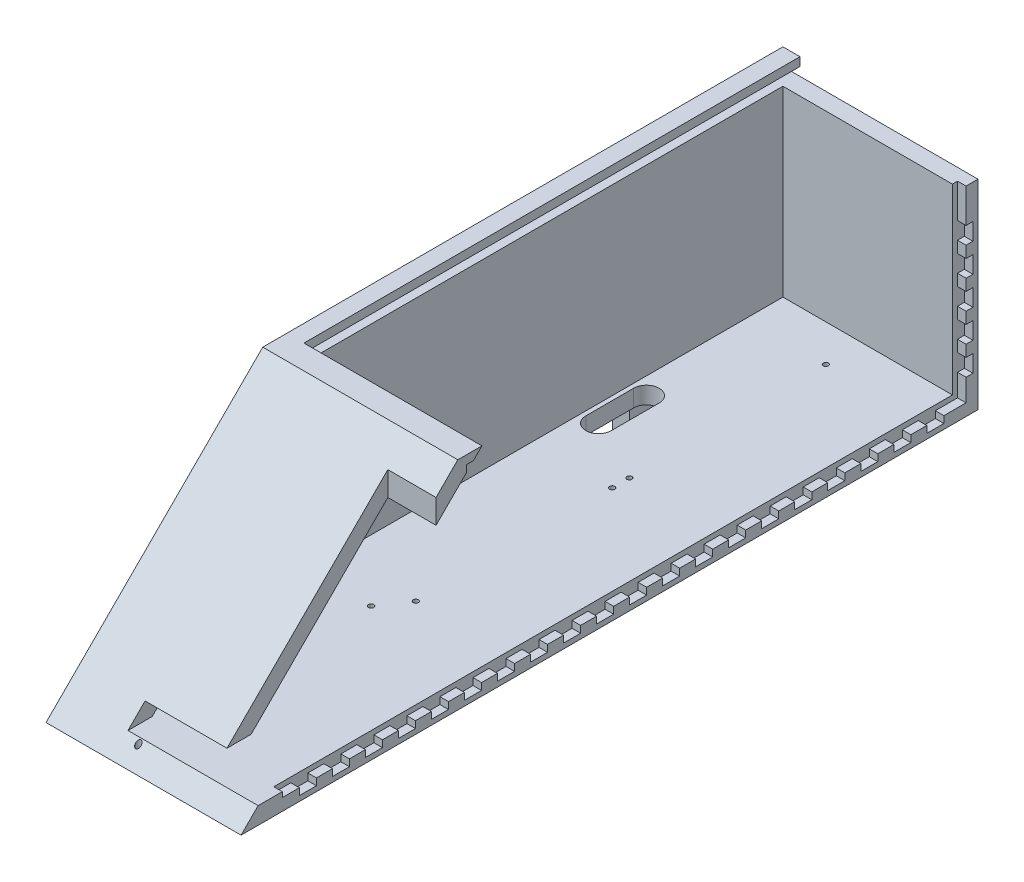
ISO-10303-21;
HEADER;
FILE_DESCRIPTION(('STEP AP214'),'2;1');
FILE_NAME('part.step','',(''),(''),'','','');
FILE_SCHEMA(('AUTOMOTIVE_DESIGN { 1 0 10303 214 1 1 1 1 }'));
ENDSEC;
DATA;
#1=APPLICATION_CONTEXT('core data for automotive mechanical design processes');
#2=APPLICATION_PROTOCOL_DEFINITION('international standard','automotive_design',2000,#1);
#3=PRODUCT_CONTEXT('',#1,'mechanical');
#4=PRODUCT('Part','Part','',(#3));
#5=PRODUCT_RELATED_PRODUCT_CATEGORY('part','',(#4));
#6=PRODUCT_DEFINITION_FORMATION('','',#4);
#7=PRODUCT_DEFINITION_CONTEXT('part definition',#1,'design');
#8=PRODUCT_DEFINITION('design','',#6,#7);
#9=PRODUCT_DEFINITION_SHAPE('','',#8);
#10=(LENGTH_UNIT() NAMED_UNIT(*) SI_UNIT(.MILLI.,.METRE.));
#11=(NAMED_UNIT(*) PLANE_ANGLE_UNIT() SI_UNIT($,.RADIAN.));
#12=(NAMED_UNIT(*) SI_UNIT($,.STERADIAN.) SOLID_ANGLE_UNIT());
#13=UNCERTAINTY_MEASURE_WITH_UNIT(LENGTH_MEASURE(1.E-05),#10,'distance_accuracy_value','');
#14=(GEOMETRIC_REPRESENTATION_CONTEXT(3) GLOBAL_UNCERTAINTY_ASSIGNED_CONTEXT((#13)) GLOBAL_UNIT_ASSIGNED_CONTEXT((#10,
#11,#12)) REPRESENTATION_CONTEXT('',''));
#15=CARTESIAN_POINT('',(0.,0.,0.));
#16=DIRECTION('',(0.,0.,1.));
#17=DIRECTION('',(1.,0.,0.));
#18=AXIS2_PLACEMENT_3D('',#15,#16,#17);
#19=CARTESIAN_POINT('',(0.,0.,0.));
#20=DIRECTION('',(-1.,0.,0.));
#21=DIRECTION('',(0.,0.,1.));
#22=AXIS2_PLACEMENT_3D('',#19,#20,#21);
#23=PLANE('',#22);
#24=DIRECTION('',(0.,1.,0.));
#25=VECTOR('',#24,1.);
#26=CARTESIAN_POINT('',(0.,70.25,-428.8));
#27=LINE('',#26,#25);
#28=CARTESIAN_POINT('',(0.,70.25,-428.8));
#29=VERTEX_POINT('',#28);
#30=CARTESIAN_POINT('',(0.,80.25,-428.8));
#31=VERTEX_POINT('',#30);
#32=EDGE_CURVE('E1381',#29,#31,#27,.T.);
#33=ORIENTED_EDGE('',*,*,#32,.F.);
#34=DIRECTION('',(0.,0.,-1.));
#35=VECTOR('',#34,1.);
#36=CARTESIAN_POINT('',(0.,70.25,-424.8));
#37=LINE('',#36,#35);
#38=CARTESIAN_POINT('',(0.,70.25,-424.8));
#39=VERTEX_POINT('',#38);
#40=EDGE_CURVE('E974',#39,#29,#37,.T.);
#41=ORIENTED_EDGE('',*,*,#40,.F.);
#42=DIRECTION('',(0.,-1.,0.));
#43=VECTOR('',#42,1.);
#44=CARTESIAN_POINT('',(0.,117.,-424.8));
#45=LINE('',#44,#43);
#46=CARTESIAN_POINT('',(0.,63.5,-424.8));
#47=VERTEX_POINT('',#46);
#48=EDGE_CURVE('E3466',#39,#47,#45,.T.);
#49=ORIENTED_EDGE('',*,*,#48,.T.);
#50=DIRECTION('',(0.,0.,-1.));
#51=VECTOR('',#50,1.);
#52=CARTESIAN_POINT('',(0.,63.5,-424.8));
#53=LINE('',#52,#51);
#54=CARTESIAN_POINT('',(0.,63.5,-428.8));
#55=VERTEX_POINT('',#54);
#56=EDGE_CURVE('E1346',#47,#55,#53,.T.);
#57=ORIENTED_EDGE('',*,*,#56,.T.);
#58=DIRECTION('',(0.,1.,0.));
#59=VECTOR('',#58,1.);
#60=CARTESIAN_POINT('',(0.,53.5,-428.8));
#61=LINE('',#60,#59);
#62=CARTESIAN_POINT('',(0.,53.5,-428.8));
#63=VERTEX_POINT('',#62);
#64=EDGE_CURVE('E1357',#63,#55,#61,.T.);
#65=ORIENTED_EDGE('',*,*,#64,.F.);
#66=DIRECTION('',(0.,0.,-1.));
#67=VECTOR('',#66,1.);
#68=CARTESIAN_POINT('',(0.,53.5,-424.8));
#69=LINE('',#68,#67);
#70=CARTESIAN_POINT('',(0.,53.5,-424.8));
#71=VERTEX_POINT('',#70);
#72=EDGE_CURVE('E1353',#71,#63,#69,.T.);
#73=ORIENTED_EDGE('',*,*,#72,.F.);
#74=CARTESIAN_POINT('',(0.,46.75,-424.8));
#75=VERTEX_POINT('',#74);
#76=EDGE_CURVE('E3464',#71,#75,#45,.T.);
#77=ORIENTED_EDGE('',*,*,#76,.T.);
#78=DIRECTION('',(0.,0.,-1.));
#79=VECTOR('',#78,1.);
#80=CARTESIAN_POINT('',(0.,46.75,-424.8));
#81=LINE('',#80,#79);
#82=CARTESIAN_POINT('',(0.,46.75,-428.8));
#83=VERTEX_POINT('',#82);
#84=EDGE_CURVE('E1322',#75,#83,#81,.T.);
#85=ORIENTED_EDGE('',*,*,#84,.T.);
#86=DIRECTION('',(0.,1.,0.));
#87=VECTOR('',#86,1.);
#88=CARTESIAN_POINT('',(0.,36.75,-428.8));
#89=LINE('',#88,#87);
#90=CARTESIAN_POINT('',(0.,36.75,-428.8));
#91=VERTEX_POINT('',#90);
#92=EDGE_CURVE('E1331',#91,#83,#89,.T.);
#93=ORIENTED_EDGE('',*,*,#92,.F.);
#94=DIRECTION('',(0.,0.,-1.));
#95=VECTOR('',#94,1.);
#96=CARTESIAN_POINT('',(0.,36.75,-424.8));
#97=LINE('',#96,#95);
#98=CARTESIAN_POINT('',(0.,36.75,-424.8));
#99=VERTEX_POINT('',#98);
#100=EDGE_CURVE('E1327',#99,#91,#97,.T.);
#101=ORIENTED_EDGE('',*,*,#100,.F.);
#102=CARTESIAN_POINT('',(0.,30.,-424.8));
#103=VERTEX_POINT('',#102);
#104=EDGE_CURVE('E916',#99,#103,#45,.T.);
#105=ORIENTED_EDGE('',*,*,#104,.T.);
#106=DIRECTION('',(0.,0.,-1.));
#107=VECTOR('',#106,1.);
#108=CARTESIAN_POINT('',(0.,30.,-424.8));
#109=LINE('',#108,#107);
#110=CARTESIAN_POINT('',(0.,30.,-428.8));
#111=VERTEX_POINT('',#110);
#112=EDGE_CURVE('E1303',#103,#111,#109,.T.);
#113=ORIENTED_EDGE('',*,*,#112,.T.);
#114=DIRECTION('',(0.,1.,0.));
#115=VECTOR('',#114,1.);
#116=CARTESIAN_POINT('',(0.,20.,-428.8));
#117=LINE('',#116,#115);
#118=CARTESIAN_POINT('',(0.,20.,-428.8));
#119=VERTEX_POINT('',#118);
#120=EDGE_CURVE('E1307',#119,#111,#117,.T.);
#121=ORIENTED_EDGE('',*,*,#120,.F.);
#122=DIRECTION('',(0.,0.,-1.));
#123=VECTOR('',#122,1.);
#124=CARTESIAN_POINT('',(0.,20.,-424.8));
#125=LINE('',#124,#123);
#126=CARTESIAN_POINT('',(0.,20.,-424.8));
#127=VERTEX_POINT('',#126);
#128=EDGE_CURVE('E1296',#127,#119,#125,.T.);
#129=ORIENTED_EDGE('',*,*,#128,.F.);
#130=CARTESIAN_POINT('',(0.,7.,-424.8));
#131=VERTEX_POINT('',#130);
#132=EDGE_CURVE('E912',#127,#131,#45,.T.);
#133=ORIENTED_EDGE('',*,*,#132,.T.);
#134=DIRECTION('',(0.,0.,-1.));
#135=VECTOR('',#134,1.);
#136=CARTESIAN_POINT('',(0.,7.,-24.1421356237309));
#137=LINE('',#136,#135);
#138=CARTESIAN_POINT('',(0.,7.,-411.8));
#139=VERTEX_POINT('',#138);
#140=EDGE_CURVE('E915',#139,#131,#137,.T.);
#141=ORIENTED_EDGE('',*,*,#140,.F.);
#142=DIRECTION('',(0.,-1.,0.));
#143=VECTOR('',#142,1.);
#144=CARTESIAN_POINT('',(0.,7.,-411.8));
#145=LINE('',#144,#143);
#146=CARTESIAN_POINT('',(0.,3.,-411.8));
#147=VERTEX_POINT('',#146);
#148=EDGE_CURVE('E968',#139,#147,#145,.T.);
#149=ORIENTED_EDGE('',*,*,#148,.T.);
#150=DIRECTION('',(0.,0.,-1.));
#151=VECTOR('',#150,1.);
#152=CARTESIAN_POINT('',(0.,3.,-401.8));
#153=LINE('',#152,#151);
#154=CARTESIAN_POINT('',(0.,3.,-401.8));
#155=VERTEX_POINT('',#154);
#156=EDGE_CURVE('E971',#155,#147,#153,.T.);
#157=ORIENTED_EDGE('',*,*,#156,.F.);
#158=DIRECTION('',(0.,-1.,0.));
#159=VECTOR('',#158,1.);
#160=CARTESIAN_POINT('',(0.,7.,-401.8));
#161=LINE('',#160,#159);
#162=CARTESIAN_POINT('',(0.,7.,-401.8));
#163=VERTEX_POINT('',#162);
#164=EDGE_CURVE('E964',#163,#155,#161,.T.);
#165=ORIENTED_EDGE('',*,*,#164,.F.);
#166=CARTESIAN_POINT('',(0.,6.99999999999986,-392.44958608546));
#167=VERTEX_POINT('',#166);
#168=EDGE_CURVE('E923',#167,#163,#137,.T.);
#169=ORIENTED_EDGE('',*,*,#168,.F.);
#170=DIRECTION('',(0.,-1.,0.));
#171=VECTOR('',#170,1.);
#172=CARTESIAN_POINT('',(0.,6.99999999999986,-392.44958608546));
#173=LINE('',#172,#171);
#174=CARTESIAN_POINT('',(0.,2.99999999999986,-392.44958608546));
#175=VERTEX_POINT('',#174);
#176=EDGE_CURVE('E1229',#167,#175,#173,.T.);
#177=ORIENTED_EDGE('',*,*,#176,.T.);
#178=DIRECTION('',(0.,0.,-1.));
#179=VECTOR('',#178,1.);
#180=CARTESIAN_POINT('',(0.,2.99999999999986,-382.44958608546));
#181=LINE('',#180,#179);
#182=CARTESIAN_POINT('',(0.,2.99999999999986,-382.44958608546));
#183=VERTEX_POINT('',#182);
#184=EDGE_CURVE('E1233',#183,#175,#181,.T.);
#185=ORIENTED_EDGE('',*,*,#184,.F.);
#186=DIRECTION('',(0.,-1.,0.));
#187=VECTOR('',#186,1.);
#188=CARTESIAN_POINT('',(0.,6.99999999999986,-382.44958608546));
#189=LINE('',#188,#187);
#190=CARTESIAN_POINT('',(0.,6.99999999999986,-382.44958608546));
#191=VERTEX_POINT('',#190);
#192=EDGE_CURVE('E1221',#191,#183,#189,.T.);
#193=ORIENTED_EDGE('',*,*,#192,.F.);
#194=CARTESIAN_POINT('',(0.,6.99999999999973,-373.099172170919));
#195=VERTEX_POINT('',#194);
#196=EDGE_CURVE('E931',#195,#191,#137,.T.);
#197=ORIENTED_EDGE('',*,*,#196,.F.);
#198=DIRECTION('',(0.,-1.,0.));
#199=VECTOR('',#198,1.);
#200=CARTESIAN_POINT('',(0.,6.99999999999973,-373.099172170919));
#201=LINE('',#200,#199);
#202=CARTESIAN_POINT('',(0.,2.99999999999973,-373.099172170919));
#203=VERTEX_POINT('',#202);
#204=EDGE_CURVE('E1255',#195,#203,#201,.T.);
#205=ORIENTED_EDGE('',*,*,#204,.T.);
#206=DIRECTION('',(0.,0.,-1.));
#207=VECTOR('',#206,1.);
#208=CARTESIAN_POINT('',(0.,2.99999999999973,-363.099172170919));
#209=LINE('',#208,#207);
#210=CARTESIAN_POINT('',(0.,2.99999999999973,-363.099172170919));
#211=VERTEX_POINT('',#210);
#212=EDGE_CURVE('E1259',#211,#203,#209,.T.);
#213=ORIENTED_EDGE('',*,*,#212,.F.);
#214=DIRECTION('',(0.,-1.,0.));
#215=VECTOR('',#214,1.);
#216=CARTESIAN_POINT('',(0.,6.99999999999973,-363.099172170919));
#217=LINE('',#216,#215);
#218=CARTESIAN_POINT('',(0.,6.99999999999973,-363.099172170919));
#219=VERTEX_POINT('',#218);
#220=EDGE_CURVE('E1247',#219,#211,#217,.T.);
#221=ORIENTED_EDGE('',*,*,#220,.F.);
#222=CARTESIAN_POINT('',(0.,6.99999999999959,-353.748758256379));
#223=VERTEX_POINT('',#222);
#224=EDGE_CURVE('E3504',#223,#219,#137,.T.);
#225=ORIENTED_EDGE('',*,*,#224,.F.);
#226=DIRECTION('',(0.,-1.,0.));
#227=VECTOR('',#226,1.);
#228=CARTESIAN_POINT('',(0.,6.99999999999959,-353.748758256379));
#229=LINE('',#228,#227);
#230=CARTESIAN_POINT('',(0.,2.99999999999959,-353.748758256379));
#231=VERTEX_POINT('',#230);
#232=EDGE_CURVE('E1201',#223,#231,#229,.T.);
#233=ORIENTED_EDGE('',*,*,#232,.T.);
#234=DIRECTION('',(0.,0.,-1.));
#235=VECTOR('',#234,1.);
#236=CARTESIAN_POINT('',(0.,2.99999999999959,-343.748758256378));
#237=LINE('',#236,#235);
#238=CARTESIAN_POINT('',(0.,2.99999999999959,-343.748758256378));
#239=VERTEX_POINT('',#238);
#240=EDGE_CURVE('E1205',#239,#231,#237,.T.);
#241=ORIENTED_EDGE('',*,*,#240,.F.);
#242=DIRECTION('',(0.,-1.,0.));
#243=VECTOR('',#242,1.);
#244=CARTESIAN_POINT('',(0.,6.99999999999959,-343.748758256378));
#245=LINE('',#244,#243);
#246=CARTESIAN_POINT('',(0.,6.99999999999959,-343.748758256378));
#247=VERTEX_POINT('',#246);
#248=EDGE_CURVE('E1193',#247,#239,#245,.T.);
#249=ORIENTED_EDGE('',*,*,#248,.F.);
#250=CARTESIAN_POINT('',(0.,6.99999999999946,-334.398344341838));
#251=VERTEX_POINT('',#250);
#252=EDGE_CURVE('E3506',#251,#247,#137,.T.);
#253=ORIENTED_EDGE('',*,*,#252,.F.);
#254=DIRECTION('',(0.,-1.,0.));
#255=VECTOR('',#254,1.);
#256=CARTESIAN_POINT('',(0.,6.99999999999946,-334.398344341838));
#257=LINE('',#256,#255);
#258=CARTESIAN_POINT('',(0.,2.99999999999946,-334.398344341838));
#259=VERTEX_POINT('',#258);
#260=EDGE_CURVE('E1218',#251,#259,#257,.T.);
#261=ORIENTED_EDGE('',*,*,#260,.T.);
#262=DIRECTION('',(0.,0.,-1.));
#263=VECTOR('',#262,1.);
#264=CARTESIAN_POINT('',(0.,2.99999999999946,-324.398344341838));
#265=LINE('',#264,#263);
#266=CARTESIAN_POINT('',(0.,2.99999999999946,-324.398344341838));
#267=VERTEX_POINT('',#266);
#268=EDGE_CURVE('E1283',#267,#259,#265,.T.);
#269=ORIENTED_EDGE('',*,*,#268,.F.);
#270=DIRECTION('',(0.,-1.,0.));
#271=VECTOR('',#270,1.);
#272=CARTESIAN_POINT('',(0.,6.99999999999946,-324.398344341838));
#273=LINE('',#272,#271);
#274=CARTESIAN_POINT('',(0.,6.99999999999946,-324.398344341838));
#275=VERTEX_POINT('',#274);
#276=EDGE_CURVE('E1273',#275,#267,#273,.T.);
#277=ORIENTED_EDGE('',*,*,#276,.F.);
#278=CARTESIAN_POINT('',(0.,6.99999999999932,-315.047930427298));
#279=VERTEX_POINT('',#278);
#280=EDGE_CURVE('E3510',#279,#275,#137,.T.);
#281=ORIENTED_EDGE('',*,*,#280,.F.);
#282=DIRECTION('',(0.,-1.,0.));
#283=VECTOR('',#282,1.);
#284=CARTESIAN_POINT('',(0.,6.99999999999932,-315.047930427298));
#285=LINE('',#284,#283);
#286=CARTESIAN_POINT('',(0.,2.99999999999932,-315.047930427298));
#287=VERTEX_POINT('',#286);
#288=EDGE_CURVE('E1175',#279,#287,#285,.T.);
#289=ORIENTED_EDGE('',*,*,#288,.T.);
#290=DIRECTION('',(0.,0.,-1.));
#291=VECTOR('',#290,1.);
#292=CARTESIAN_POINT('',(0.,2.99999999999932,-305.047930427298));
#293=LINE('',#292,#291);
#294=CARTESIAN_POINT('',(0.,2.99999999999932,-305.047930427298));
#295=VERTEX_POINT('',#294);
#296=EDGE_CURVE('E1179',#295,#287,#293,.T.);
#297=ORIENTED_EDGE('',*,*,#296,.F.);
#298=DIRECTION('',(0.,-1.,0.));
#299=VECTOR('',#298,1.);
#300=CARTESIAN_POINT('',(0.,6.99999999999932,-305.047930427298));
#301=LINE('',#300,#299);
#302=CARTESIAN_POINT('',(0.,6.99999999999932,-305.047930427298));
#303=VERTEX_POINT('',#302);
#304=EDGE_CURVE('E1167',#303,#295,#301,.T.);
#305=ORIENTED_EDGE('',*,*,#304,.F.);
#306=CARTESIAN_POINT('',(0.,6.99999999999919,-295.697516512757));
#307=VERTEX_POINT('',#306);
#308=EDGE_CURVE('E3514',#307,#303,#137,.T.);
#309=ORIENTED_EDGE('',*,*,#308,.F.);
#310=DIRECTION('',(0.,-1.,0.));
#311=VECTOR('',#310,1.);
#312=CARTESIAN_POINT('',(0.,6.99999999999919,-295.697516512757));
#313=LINE('',#312,#311);
#314=CARTESIAN_POINT('',(0.,2.99999999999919,-295.697516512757));
#315=VERTEX_POINT('',#314);
#316=EDGE_CURVE('E1149',#307,#315,#313,.T.);
#317=ORIENTED_EDGE('',*,*,#316,.T.);
#318=DIRECTION('',(0.,0.,-1.));
#319=VECTOR('',#318,1.);
#320=CARTESIAN_POINT('',(0.,2.99999999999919,-285.697516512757));
#321=LINE('',#320,#319);
#322=CARTESIAN_POINT('',(0.,2.99999999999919,-285.697516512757));
#323=VERTEX_POINT('',#322);
#324=EDGE_CURVE('E1153',#323,#315,#321,.T.);
#325=ORIENTED_EDGE('',*,*,#324,.F.);
#326=DIRECTION('',(0.,-1.,0.));
#327=VECTOR('',#326,1.);
#328=CARTESIAN_POINT('',(0.,6.99999999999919,-285.697516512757));
#329=LINE('',#328,#327);
#330=CARTESIAN_POINT('',(0.,6.99999999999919,-285.697516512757));
#331=VERTEX_POINT('',#330);
#332=EDGE_CURVE('E1141',#331,#323,#329,.T.);
#333=ORIENTED_EDGE('',*,*,#332,.F.);
#334=CARTESIAN_POINT('',(0.,6.99999999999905,-276.347102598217));
#335=VERTEX_POINT('',#334);
#336=EDGE_CURVE('E3518',#335,#331,#137,.T.);
#337=ORIENTED_EDGE('',*,*,#336,.F.);
#338=DIRECTION('',(0.,-1.,0.));
#339=VECTOR('',#338,1.);
#340=CARTESIAN_POINT('',(0.,6.99999999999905,-276.347102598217));
#341=LINE('',#340,#339);
#342=CARTESIAN_POINT('',(0.,2.99999999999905,-276.347102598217));
#343=VERTEX_POINT('',#342);
#344=EDGE_CURVE('E1123',#335,#343,#341,.T.);
#345=ORIENTED_EDGE('',*,*,#344,.T.);
#346=DIRECTION('',(0.,0.,-1.));
#347=VECTOR('',#346,1.);
#348=CARTESIAN_POINT('',(0.,2.99999999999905,-266.347102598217));
#349=LINE('',#348,#347);
#350=CARTESIAN_POINT('',(0.,2.99999999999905,-266.347102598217));
#351=VERTEX_POINT('',#350);
#352=EDGE_CURVE('E1127',#351,#343,#349,.T.);
#353=ORIENTED_EDGE('',*,*,#352,.F.);
#354=DIRECTION('',(0.,-1.,0.));
#355=VECTOR('',#354,1.);
#356=CARTESIAN_POINT('',(0.,6.99999999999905,-266.347102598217));
#357=LINE('',#356,#355);
#358=CARTESIAN_POINT('',(0.,6.99999999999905,-266.347102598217));
#359=VERTEX_POINT('',#358);
#360=EDGE_CURVE('E1115',#359,#351,#357,.T.);
#361=ORIENTED_EDGE('',*,*,#360,.F.);
#362=CARTESIAN_POINT('',(0.,6.99999999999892,-256.996688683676));
#363=VERTEX_POINT('',#362);
#364=EDGE_CURVE('E3522',#363,#359,#137,.T.);
#365=ORIENTED_EDGE('',*,*,#364,.F.);
#366=DIRECTION('',(0.,-1.,0.));
#367=VECTOR('',#366,1.);
#368=CARTESIAN_POINT('',(0.,6.99999999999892,-256.996688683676));
#369=LINE('',#368,#367);
#370=CARTESIAN_POINT('',(0.,2.99999999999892,-256.996688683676));
#371=VERTEX_POINT('',#370);
#372=EDGE_CURVE('E1097',#363,#371,#369,.T.);
#373=ORIENTED_EDGE('',*,*,#372,.T.);
#374=DIRECTION('',(0.,0.,-1.));
#375=VECTOR('',#374,1.);
#376=CARTESIAN_POINT('',(0.,2.99999999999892,-246.996688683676));
#377=LINE('',#376,#375);
#378=CARTESIAN_POINT('',(0.,2.99999999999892,-246.996688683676));
#379=VERTEX_POINT('',#378);
#380=EDGE_CURVE('E1101',#379,#371,#377,.T.);
#381=ORIENTED_EDGE('',*,*,#380,.F.);
#382=DIRECTION('',(0.,-1.,0.));
#383=VECTOR('',#382,1.);
#384=CARTESIAN_POINT('',(0.,6.99999999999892,-246.996688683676));
#385=LINE('',#384,#383);
#386=CARTESIAN_POINT('',(0.,6.99999999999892,-246.996688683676));
#387=VERTEX_POINT('',#386);
#388=EDGE_CURVE('E1089',#387,#379,#385,.T.);
#389=ORIENTED_EDGE('',*,*,#388,.F.);
#390=CARTESIAN_POINT('',(0.,6.99999999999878,-237.646274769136));
#391=VERTEX_POINT('',#390);
#392=EDGE_CURVE('E3526',#391,#387,#137,.T.);
#393=ORIENTED_EDGE('',*,*,#392,.F.);
#394=DIRECTION('',(0.,-1.,0.));
#395=VECTOR('',#394,1.);
#396=CARTESIAN_POINT('',(0.,6.99999999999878,-237.646274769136));
#397=LINE('',#396,#395);
#398=CARTESIAN_POINT('',(0.,2.99999999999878,-237.646274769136));
#399=VERTEX_POINT('',#398);
#400=EDGE_CURVE('E1071',#391,#399,#397,.T.);
#401=ORIENTED_EDGE('',*,*,#400,.T.);
#402=DIRECTION('',(0.,0.,-1.));
#403=VECTOR('',#402,1.);
#404=CARTESIAN_POINT('',(0.,2.99999999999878,-227.646274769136));
#405=LINE('',#404,#403);
#406=CARTESIAN_POINT('',(0.,2.99999999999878,-227.646274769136));
#407=VERTEX_POINT('',#406);
#408=EDGE_CURVE('E1075',#407,#399,#405,.T.);
#409=ORIENTED_EDGE('',*,*,#408,.F.);
#410=DIRECTION('',(0.,-1.,0.));
#411=VECTOR('',#410,1.);
#412=CARTESIAN_POINT('',(0.,6.99999999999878,-227.646274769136));
#413=LINE('',#412,#411);
#414=CARTESIAN_POINT('',(0.,6.99999999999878,-227.646274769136));
#415=VERTEX_POINT('',#414);
#416=EDGE_CURVE('E1063',#415,#407,#413,.T.);
#417=ORIENTED_EDGE('',*,*,#416,.F.);
#418=CARTESIAN_POINT('',(0.,6.99999999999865,-218.295860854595));
#419=VERTEX_POINT('',#418);
#420=EDGE_CURVE('E3530',#419,#415,#137,.T.);
#421=ORIENTED_EDGE('',*,*,#420,.F.);
#422=DIRECTION('',(0.,-1.,0.));
#423=VECTOR('',#422,1.);
#424=CARTESIAN_POINT('',(0.,6.99999999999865,-218.295860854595));
#425=LINE('',#424,#423);
#426=CARTESIAN_POINT('',(0.,2.99999999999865,-218.295860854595));
#427=VERTEX_POINT('',#426);
#428=EDGE_CURVE('E1045',#419,#427,#425,.T.);
#429=ORIENTED_EDGE('',*,*,#428,.T.);
#430=DIRECTION('',(0.,0.,-1.));
#431=VECTOR('',#430,1.);
#432=CARTESIAN_POINT('',(0.,2.99999999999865,-208.295860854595));
#433=LINE('',#432,#431);
#434=CARTESIAN_POINT('',(0.,2.99999999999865,-208.295860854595));
#435=VERTEX_POINT('',#434);
#436=EDGE_CURVE('E1049',#435,#427,#433,.T.);
#437=ORIENTED_EDGE('',*,*,#436,.F.);
#438=DIRECTION('',(0.,-1.,0.));
#439=VECTOR('',#438,1.);
#440=CARTESIAN_POINT('',(0.,6.99999999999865,-208.295860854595));
#441=LINE('',#440,#439);
#442=CARTESIAN_POINT('',(0.,6.99999999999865,-208.295860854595));
#443=VERTEX_POINT('',#442);
#444=EDGE_CURVE('E1037',#443,#435,#441,.T.);
#445=ORIENTED_EDGE('',*,*,#444,.F.);
#446=CARTESIAN_POINT('',(0.,6.99999999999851,-198.945446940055));
#447=VERTEX_POINT('',#446);
#448=EDGE_CURVE('E3534',#447,#443,#137,.T.);
#449=ORIENTED_EDGE('',*,*,#448,.F.);
#450=DIRECTION('',(0.,-1.,0.));
#451=VECTOR('',#450,1.);
#452=CARTESIAN_POINT('',(0.,6.99999999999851,-198.945446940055));
#453=LINE('',#452,#451);
#454=CARTESIAN_POINT('',(0.,2.99999999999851,-198.945446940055));
#455=VERTEX_POINT('',#454);
#456=EDGE_CURVE('E1019',#447,#455,#453,.T.);
#457=ORIENTED_EDGE('',*,*,#456,.T.);
#458=DIRECTION('',(0.,0.,-1.));
#459=VECTOR('',#458,1.);
#460=CARTESIAN_POINT('',(0.,2.99999999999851,-188.945446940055));
#461=LINE('',#460,#459);
#462=CARTESIAN_POINT('',(0.,2.99999999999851,-188.945446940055));
#463=VERTEX_POINT('',#462);
#464=EDGE_CURVE('E1023',#463,#455,#461,.T.);
#465=ORIENTED_EDGE('',*,*,#464,.F.);
#466=DIRECTION('',(0.,-1.,0.));
#467=VECTOR('',#466,1.);
#468=CARTESIAN_POINT('',(0.,6.99999999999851,-188.945446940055));
#469=LINE('',#468,#467);
#470=CARTESIAN_POINT('',(0.,6.99999999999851,-188.945446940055));
#471=VERTEX_POINT('',#470);
#472=EDGE_CURVE('E1011',#471,#463,#469,.T.);
#473=ORIENTED_EDGE('',*,*,#472,.F.);
#474=CARTESIAN_POINT('',(0.,6.99999999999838,-179.595033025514));
#475=VERTEX_POINT('',#474);
#476=EDGE_CURVE('E3538',#475,#471,#137,.T.);
#477=ORIENTED_EDGE('',*,*,#476,.F.);
#478=DIRECTION('',(0.,-1.,0.));
#479=VECTOR('',#478,1.);
#480=CARTESIAN_POINT('',(0.,6.99999999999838,-179.595033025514));
#481=LINE('',#480,#479);
#482=CARTESIAN_POINT('',(0.,2.99999999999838,-179.595033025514));
#483=VERTEX_POINT('',#482);
#484=EDGE_CURVE('E991',#475,#483,#481,.T.);
#485=ORIENTED_EDGE('',*,*,#484,.T.);
#486=DIRECTION('',(0.,0.,-1.));
#487=VECTOR('',#486,1.);
#488=CARTESIAN_POINT('',(0.,2.99999999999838,-169.595033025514));
#489=LINE('',#488,#487);
#490=CARTESIAN_POINT('',(0.,2.99999999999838,-169.595033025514));
#491=VERTEX_POINT('',#490);
#492=EDGE_CURVE('E995',#491,#483,#489,.T.);
#493=ORIENTED_EDGE('',*,*,#492,.F.);
#494=DIRECTION('',(0.,-1.,0.));
#495=VECTOR('',#494,1.);
#496=CARTESIAN_POINT('',(0.,6.99999999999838,-169.595033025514));
#497=LINE('',#496,#495);
#498=CARTESIAN_POINT('',(0.,6.99999999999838,-169.595033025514));
#499=VERTEX_POINT('',#498);
#500=EDGE_CURVE('E983',#499,#491,#497,.T.);
#501=ORIENTED_EDGE('',*,*,#500,.F.);
#502=CARTESIAN_POINT('',(0.,6.99999999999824,-160.244619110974));
#503=VERTEX_POINT('',#502);
#504=EDGE_CURVE('E3542',#503,#499,#137,.T.);
#505=ORIENTED_EDGE('',*,*,#504,.F.);
#506=DIRECTION('',(0.,-1.,0.));
#507=VECTOR('',#506,1.);
#508=CARTESIAN_POINT('',(0.,6.99999999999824,-160.244619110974));
#509=LINE('',#508,#507);
#510=CARTESIAN_POINT('',(0.,2.99999999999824,-160.244619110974));
#511=VERTEX_POINT('',#510);
#512=EDGE_CURVE('E1008',#503,#511,#509,.T.);
#513=ORIENTED_EDGE('',*,*,#512,.T.);
#514=DIRECTION('',(0.,0.,-1.));
#515=VECTOR('',#514,1.);
#516=CARTESIAN_POINT('',(0.,2.99999999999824,-150.244619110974));
#517=LINE('',#516,#515);
#518=CARTESIAN_POINT('',(0.,2.99999999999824,-150.244619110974));
#519=VERTEX_POINT('',#518);
#520=EDGE_CURVE('E1485',#519,#511,#517,.T.);
#521=ORIENTED_EDGE('',*,*,#520,.F.);
#522=DIRECTION('',(0.,-1.,0.));
#523=VECTOR('',#522,1.);
#524=CARTESIAN_POINT('',(0.,6.99999999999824,-150.244619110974));
#525=LINE('',#524,#523);
#526=CARTESIAN_POINT('',(0.,6.99999999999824,-150.244619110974));
#527=VERTEX_POINT('',#526);
#528=EDGE_CURVE('E1475',#527,#519,#525,.T.);
#529=ORIENTED_EDGE('',*,*,#528,.F.);
#530=CARTESIAN_POINT('',(0.,6.99999999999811,-140.894205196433));
#531=VERTEX_POINT('',#530);
#532=EDGE_CURVE('E3546',#531,#527,#137,.T.);
#533=ORIENTED_EDGE('',*,*,#532,.F.);
#534=DIRECTION('',(0.,-1.,0.));
#535=VECTOR('',#534,1.);
#536=CARTESIAN_POINT('',(0.,6.99999999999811,-140.894205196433));
#537=LINE('',#536,#535);
#538=CARTESIAN_POINT('',(0.,2.99999999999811,-140.894205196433));
#539=VERTEX_POINT('',#538);
#540=EDGE_CURVE('E1457',#531,#539,#537,.T.);
#541=ORIENTED_EDGE('',*,*,#540,.T.);
#542=DIRECTION('',(0.,0.,-1.));
#543=VECTOR('',#542,1.);
#544=CARTESIAN_POINT('',(0.,2.99999999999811,-130.894205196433));
#545=LINE('',#544,#543);
#546=CARTESIAN_POINT('',(0.,2.99999999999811,-130.894205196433));
#547=VERTEX_POINT('',#546);
#548=EDGE_CURVE('E1461',#547,#539,#545,.T.);
#549=ORIENTED_EDGE('',*,*,#548,.F.);
#550=DIRECTION('',(0.,-1.,0.));
#551=VECTOR('',#550,1.);
#552=CARTESIAN_POINT('',(0.,6.99999999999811,-130.894205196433));
#553=LINE('',#552,#551);
#554=CARTESIAN_POINT('',(0.,6.99999999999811,-130.894205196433));
#555=VERTEX_POINT('',#554);
#556=EDGE_CURVE('E1449',#555,#547,#553,.T.);
#557=ORIENTED_EDGE('',*,*,#556,.F.);
#558=CARTESIAN_POINT('',(0.,6.99999999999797,-121.543791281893));
#559=VERTEX_POINT('',#558);
#560=EDGE_CURVE('E3550',#559,#555,#137,.T.);
#561=ORIENTED_EDGE('',*,*,#560,.F.);
#562=DIRECTION('',(0.,-1.,0.));
#563=VECTOR('',#562,1.);
#564=CARTESIAN_POINT('',(0.,6.99999999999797,-121.543791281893));
#565=LINE('',#564,#563);
#566=CARTESIAN_POINT('',(0.,2.99999999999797,-121.543791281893));
#567=VERTEX_POINT('',#566);
#568=EDGE_CURVE('E1431',#559,#567,#565,.T.);
#569=ORIENTED_EDGE('',*,*,#568,.T.);
#570=DIRECTION('',(0.,0.,-1.));
#571=VECTOR('',#570,1.);
#572=CARTESIAN_POINT('',(0.,2.99999999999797,-111.543791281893));
#573=LINE('',#572,#571);
#574=CARTESIAN_POINT('',(0.,2.99999999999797,-111.543791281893));
#575=VERTEX_POINT('',#574);
#576=EDGE_CURVE('E1435',#575,#567,#573,.T.);
#577=ORIENTED_EDGE('',*,*,#576,.F.);
#578=DIRECTION('',(0.,-1.,0.));
#579=VECTOR('',#578,1.);
#580=CARTESIAN_POINT('',(0.,6.99999999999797,-111.543791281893));
#581=LINE('',#580,#579);
#582=CARTESIAN_POINT('',(0.,6.99999999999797,-111.543791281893));
#583=VERTEX_POINT('',#582);
#584=EDGE_CURVE('E1423',#583,#575,#581,.T.);
#585=ORIENTED_EDGE('',*,*,#584,.F.);
#586=CARTESIAN_POINT('',(0.,6.99999999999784,-102.193377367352));
#587=VERTEX_POINT('',#586);
#588=EDGE_CURVE('E3554',#587,#583,#137,.T.);
#589=ORIENTED_EDGE('',*,*,#588,.F.);
#590=DIRECTION('',(0.,-1.,0.));
#591=VECTOR('',#590,1.);
#592=CARTESIAN_POINT('',(0.,6.99999999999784,-102.193377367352));
#593=LINE('',#592,#591);
#594=CARTESIAN_POINT('',(0.,2.99999999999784,-102.193377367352));
#595=VERTEX_POINT('',#594);
#596=EDGE_CURVE('E1403',#587,#595,#593,.T.);
#597=ORIENTED_EDGE('',*,*,#596,.T.);
#598=DIRECTION('',(0.,0.,-1.));
#599=VECTOR('',#598,1.);
#600=CARTESIAN_POINT('',(0.,2.99999999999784,-92.1933773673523));
#601=LINE('',#600,#599);
#602=CARTESIAN_POINT('',(0.,2.99999999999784,-92.1933773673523));
#603=VERTEX_POINT('',#602);
#604=EDGE_CURVE('E1407',#603,#595,#601,.T.);
#605=ORIENTED_EDGE('',*,*,#604,.F.);
#606=DIRECTION('',(0.,-1.,0.));
#607=VECTOR('',#606,1.);
#608=CARTESIAN_POINT('',(0.,6.99999999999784,-92.1933773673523));
#609=LINE('',#608,#607);
#610=CARTESIAN_POINT('',(0.,6.99999999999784,-92.1933773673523));
#611=VERTEX_POINT('',#610);
#612=EDGE_CURVE('E1395',#611,#603,#609,.T.);
#613=ORIENTED_EDGE('',*,*,#612,.F.);
#614=CARTESIAN_POINT('',(0.,6.9999999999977,-82.8429634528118));
#615=VERTEX_POINT('',#614);
#616=EDGE_CURVE('E3558',#615,#611,#137,.T.);
#617=ORIENTED_EDGE('',*,*,#616,.F.);
#618=DIRECTION('',(0.,-1.,0.));
#619=VECTOR('',#618,1.);
#620=CARTESIAN_POINT('',(0.,6.9999999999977,-82.8429634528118));
#621=LINE('',#620,#619);
#622=CARTESIAN_POINT('',(0.,2.9999999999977,-82.8429634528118));
#623=VERTEX_POINT('',#622);
#624=EDGE_CURVE('E1420',#615,#623,#621,.T.);
#625=ORIENTED_EDGE('',*,*,#624,.T.);
#626=DIRECTION('',(0.,0.,-1.));
#627=VECTOR('',#626,1.);
#628=CARTESIAN_POINT('',(0.,2.9999999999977,-72.8429634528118));
#629=LINE('',#628,#627);
#630=CARTESIAN_POINT('',(0.,2.9999999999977,-72.8429634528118));
#631=VERTEX_POINT('',#630);
#632=EDGE_CURVE('E1537',#631,#623,#629,.T.);
#633=ORIENTED_EDGE('',*,*,#632,.F.);
#634=DIRECTION('',(0.,-1.,0.));
#635=VECTOR('',#634,1.);
#636=CARTESIAN_POINT('',(0.,6.9999999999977,-72.8429634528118));
#637=LINE('',#636,#635);
#638=CARTESIAN_POINT('',(0.,6.9999999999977,-72.8429634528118));
#639=VERTEX_POINT('',#638);
#640=EDGE_CURVE('E1527',#639,#631,#637,.T.);
#641=ORIENTED_EDGE('',*,*,#640,.F.);
#642=CARTESIAN_POINT('',(0.,6.99999999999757,-63.4925495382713));
#643=VERTEX_POINT('',#642);
#644=EDGE_CURVE('E920',#643,#639,#137,.T.);
#645=ORIENTED_EDGE('',*,*,#644,.F.);
#646=DIRECTION('',(0.,-1.,0.));
#647=VECTOR('',#646,1.);
#648=CARTESIAN_POINT('',(0.,6.99999999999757,-63.4925495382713));
#649=LINE('',#648,#647);
#650=CARTESIAN_POINT('',(0.,2.99999999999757,-63.4925495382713));
#651=VERTEX_POINT('',#650);
#652=EDGE_CURVE('E1507',#643,#651,#649,.T.);
#653=ORIENTED_EDGE('',*,*,#652,.T.);
#654=DIRECTION('',(0.,0.,-1.));
#655=VECTOR('',#654,1.);
#656=CARTESIAN_POINT('',(0.,2.99999999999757,-53.4925495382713));
#657=LINE('',#656,#655);
#658=CARTESIAN_POINT('',(0.,2.99999999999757,-53.4925495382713));
#659=VERTEX_POINT('',#658);
#660=EDGE_CURVE('E1511',#659,#651,#657,.T.);
#661=ORIENTED_EDGE('',*,*,#660,.F.);
#662=DIRECTION('',(0.,-1.,0.));
#663=VECTOR('',#662,1.);
#664=CARTESIAN_POINT('',(0.,6.99999999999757,-53.4925495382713));
#665=LINE('',#664,#663);
#666=CARTESIAN_POINT('',(0.,6.99999999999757,-53.4925495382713));
#667=VERTEX_POINT('',#666);
#668=EDGE_CURVE('E1499',#667,#659,#665,.T.);
#669=ORIENTED_EDGE('',*,*,#668,.F.);
#670=CARTESIAN_POINT('',(0.,6.99999999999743,-44.1421356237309));
#671=VERTEX_POINT('',#670);
#672=EDGE_CURVE('E913',#671,#667,#137,.T.);
#673=ORIENTED_EDGE('',*,*,#672,.F.);
#674=DIRECTION('',(0.,-1.,0.));
#675=VECTOR('',#674,1.);
#676=CARTESIAN_POINT('',(0.,6.99999999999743,-44.1421356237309));
#677=LINE('',#676,#675);
#678=CARTESIAN_POINT('',(0.,2.99999999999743,-44.1421356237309));
#679=VERTEX_POINT('',#678);
#680=EDGE_CURVE('E1524',#671,#679,#677,.T.);
#681=ORIENTED_EDGE('',*,*,#680,.T.);
#682=DIRECTION('',(0.,0.,-1.));
#683=VECTOR('',#682,1.);
#684=CARTESIAN_POINT('',(0.,2.99999999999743,-34.1421356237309));
#685=LINE('',#684,#683);
#686=CARTESIAN_POINT('',(0.,2.99999999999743,-34.1421356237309));
#687=VERTEX_POINT('',#686);
#688=EDGE_CURVE('E906',#687,#679,#685,.T.);
#689=ORIENTED_EDGE('',*,*,#688,.F.);
#690=DIRECTION('',(0.,-1.,0.));
#691=VECTOR('',#690,1.);
#692=CARTESIAN_POINT('',(0.,6.99999999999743,-34.1421356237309));
#693=LINE('',#692,#691);
#694=CARTESIAN_POINT('',(0.,6.99999999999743,-34.1421356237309));
#695=VERTEX_POINT('',#694);
#696=EDGE_CURVE('E889',#695,#687,#693,.T.);
#697=ORIENTED_EDGE('',*,*,#696,.F.);
#698=CARTESIAN_POINT('',(0.,7.,-24.1421356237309));
#699=VERTEX_POINT('',#698);
#700=EDGE_CURVE('E903',#699,#695,#137,.T.);
#701=ORIENTED_EDGE('',*,*,#700,.F.);
#702=DIRECTION('',(0.,-1.,0.));
#703=VECTOR('',#702,1.);
#704=CARTESIAN_POINT('',(0.,10.,-24.1421356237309));
#705=LINE('',#704,#703);
#706=CARTESIAN_POINT('',(0.,10.,-24.1421356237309));
#707=VERTEX_POINT('',#706);
#708=EDGE_CURVE('E924',#707,#699,#705,.T.);
#709=ORIENTED_EDGE('',*,*,#708,.F.);
#710=DIRECTION('',(0.,0.,1.));
#711=VECTOR('',#710,1.);
#712=CARTESIAN_POINT('',(0.,10.,0.));
#713=LINE('',#712,#711);
#714=CARTESIAN_POINT('',(0.,10.,-9.99999999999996));
#715=VERTEX_POINT('',#714);
#716=EDGE_CURVE('E1706',#707,#715,#713,.T.);
#717=ORIENTED_EDGE('',*,*,#716,.T.);
#718=DIRECTION('',(0.,-0.707106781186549,0.707106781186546));
#719=VECTOR('',#718,1.);
#720=CARTESIAN_POINT('',(0.,0.,0.));
#721=LINE('',#720,#719);
#722=CARTESIAN_POINT('',(0.,0.,0.));
#723=VERTEX_POINT('',#722);
#724=EDGE_CURVE('E1699',#715,#723,#721,.T.);
#725=ORIENTED_EDGE('',*,*,#724,.T.);
#726=DIRECTION('',(0.,0.,1.));
#727=VECTOR('',#726,1.);
#728=CARTESIAN_POINT('',(0.,0.,0.));
#729=LINE('',#728,#727);
#730=CARTESIAN_POINT('',(0.,0.,-431.8));
#731=VERTEX_POINT('',#730);
#732=EDGE_CURVE('E1710',#731,#723,#729,.T.);
#733=ORIENTED_EDGE('',*,*,#732,.F.);
#734=DIRECTION('',(0.,1.,0.));
#735=VECTOR('',#734,1.);
#736=CARTESIAN_POINT('',(0.,127.,-431.8));
#737=LINE('',#736,#735);
#738=CARTESIAN_POINT('',(0.,117.,-431.8));
#739=VERTEX_POINT('',#738);
#740=EDGE_CURVE('E1684',#731,#739,#737,.T.);
#741=ORIENTED_EDGE('',*,*,#740,.T.);
#742=DIRECTION('',(0.,0.,-1.));
#743=VECTOR('',#742,1.);
#744=CARTESIAN_POINT('',(0.,117.,-132.));
#745=LINE('',#744,#743);
#746=CARTESIAN_POINT('',(0.,117.,-424.8));
#747=VERTEX_POINT('',#746);
#748=EDGE_CURVE('E1708',#747,#739,#745,.T.);
#749=ORIENTED_EDGE('',*,*,#748,.F.);
#750=CARTESIAN_POINT('',(0.,97.,-424.8));
#751=VERTEX_POINT('',#750);
#752=EDGE_CURVE('E918',#747,#751,#45,.T.);
#753=ORIENTED_EDGE('',*,*,#752,.T.);
#754=DIRECTION('',(0.,0.,-1.));
#755=VECTOR('',#754,1.);
#756=CARTESIAN_POINT('',(0.,97.,-424.8));
#757=LINE('',#756,#755);
#758=CARTESIAN_POINT('',(0.,97.,-428.8));
#759=VERTEX_POINT('',#758);
#760=EDGE_CURVE('E1552',#751,#759,#757,.T.);
#761=ORIENTED_EDGE('',*,*,#760,.T.);
#762=DIRECTION('',(0.,1.,0.));
#763=VECTOR('',#762,1.);
#764=CARTESIAN_POINT('',(0.,87.,-428.8));
#765=LINE('',#764,#763);
#766=CARTESIAN_POINT('',(0.,87.,-428.8));
#767=VERTEX_POINT('',#766);
#768=EDGE_CURVE('E1563',#767,#759,#765,.T.);
#769=ORIENTED_EDGE('',*,*,#768,.F.);
#770=DIRECTION('',(0.,0.,-1.));
#771=VECTOR('',#770,1.);
#772=CARTESIAN_POINT('',(0.,87.,-424.8));
#773=LINE('',#772,#771);
#774=CARTESIAN_POINT('',(0.,87.,-424.8));
#775=VERTEX_POINT('',#774);
#776=EDGE_CURVE('E1559',#775,#767,#773,.T.);
#777=ORIENTED_EDGE('',*,*,#776,.F.);
#778=CARTESIAN_POINT('',(0.,80.25,-424.8));
#779=VERTEX_POINT('',#778);
#780=EDGE_CURVE('E3440',#775,#779,#45,.T.);
#781=ORIENTED_EDGE('',*,*,#780,.T.);
#782=DIRECTION('',(0.,0.,-1.));
#783=VECTOR('',#782,1.);
#784=CARTESIAN_POINT('',(0.,80.25,-424.8));
#785=LINE('',#784,#783);
#786=EDGE_CURVE('E1372',#779,#31,#785,.T.);
#787=ORIENTED_EDGE('',*,*,#786,.T.);
#788=EDGE_LOOP('',(#33,#41,#49,#57,#65,#73,#77,#85,#93,#101,#105,#113,#121,#129,#133,#141,#149,
#157,#165,#169,#177,#185,#193,#197,#205,#213,#221,#225,#233,#241,#249,#253,#261,#269,#277,#281,
#289,#297,#305,#309,#317,#325,#333,#337,#345,#353,#361,#365,#373,#381,#389,#393,#401,#409,#417,
#421,#429,#437,#445,#449,#457,#465,#473,#477,#485,#493,#501,#505,#513,#521,#529,#533,#541,#549,
#557,#561,#569,#577,#585,#589,#597,#605,#613,#617,#625,#633,#641,#645,#653,#661,#669,#673,#681,
#689,#697,#701,#709,#717,#725,#733,#741,#749,#753,#761,#769,#777,#781,#787));
#789=FACE_BOUND('',#788,.T.);
#790=ADVANCED_FACE('F44',(#789),#23,.F.);
#791=CARTESIAN_POINT('',(-5.,117.,-424.8));
#792=DIRECTION('',(0.,0.,1.));
#793=DIRECTION('',(0.,-1.,0.));
#794=AXIS2_PLACEMENT_3D('',#791,#792,#793);
#795=PLANE('',#794);
#796=DIRECTION('',(0.,-1.,0.));
#797=VECTOR('',#796,1.);
#798=CARTESIAN_POINT('',(-5.,117.,-424.8));
#799=LINE('',#798,#797);
#800=CARTESIAN_POINT('',(-5.,87.,-424.8));
#801=VERTEX_POINT('',#800);
#802=CARTESIAN_POINT('',(-5.,80.25,-424.8));
#803=VERTEX_POINT('',#802);
#804=EDGE_CURVE('E944',#801,#803,#799,.T.);
#805=ORIENTED_EDGE('',*,*,#804,.T.);
#806=DIRECTION('',(1.,0.,0.));
#807=VECTOR('',#806,1.);
#808=CARTESIAN_POINT('',(-5.,80.25,-424.8));
#809=LINE('',#808,#807);
#810=EDGE_CURVE('E1387',#803,#779,#809,.T.);
#811=ORIENTED_EDGE('',*,*,#810,.T.);
#812=ORIENTED_EDGE('',*,*,#780,.F.);
#813=DIRECTION('',(1.,0.,0.));
#814=VECTOR('',#813,1.);
#815=CARTESIAN_POINT('',(-5.,87.,-424.8));
#816=LINE('',#815,#814);
#817=EDGE_CURVE('E1568',#801,#775,#816,.T.);
#818=ORIENTED_EDGE('',*,*,#817,.F.);
#819=EDGE_LOOP('',(#805,#811,#812,#818));
#820=FACE_BOUND('',#819,.T.);
#821=ADVANCED_FACE('F2039',(#820),#795,.T.);
#822=DIRECTION('',(1.,0.,0.));
#823=VECTOR('',#822,1.);
#824=CARTESIAN_POINT('',(-5.,70.25,-424.8));
#825=LINE('',#824,#823);
#826=CARTESIAN_POINT('',(-5.,70.25,-424.8));
#827=VERTEX_POINT('',#826);
#828=EDGE_CURVE('E1356',#827,#39,#825,.T.);
#829=ORIENTED_EDGE('',*,*,#828,.F.);
#830=CARTESIAN_POINT('',(-5.,63.5,-424.8));
#831=VERTEX_POINT('',#830);
#832=EDGE_CURVE('E3445',#827,#831,#799,.T.);
#833=ORIENTED_EDGE('',*,*,#832,.T.);
#834=DIRECTION('',(1.,0.,0.));
#835=VECTOR('',#834,1.);
#836=CARTESIAN_POINT('',(-5.,63.5,-424.8));
#837=LINE('',#836,#835);
#838=EDGE_CURVE('E1363',#831,#47,#837,.T.);
#839=ORIENTED_EDGE('',*,*,#838,.T.);
#840=ORIENTED_EDGE('',*,*,#48,.F.);
#841=EDGE_LOOP('',(#829,#833,#839,#840));
#842=FACE_BOUND('',#841,.T.);
#843=ADVANCED_FACE('F2046',(#842),#795,.T.);
#844=DIRECTION('',(1.,0.,0.));
#845=VECTOR('',#844,1.);
#846=CARTESIAN_POINT('',(-5.,53.5,-424.8));
#847=LINE('',#846,#845);
#848=CARTESIAN_POINT('',(-5.,53.5,-424.8));
#849=VERTEX_POINT('',#848);
#850=EDGE_CURVE('E1330',#849,#71,#847,.T.);
#851=ORIENTED_EDGE('',*,*,#850,.F.);
#852=CARTESIAN_POINT('',(-5.,46.75,-424.8));
#853=VERTEX_POINT('',#852);
#854=EDGE_CURVE('E3447',#849,#853,#799,.T.);
#855=ORIENTED_EDGE('',*,*,#854,.T.);
#856=DIRECTION('',(1.,0.,0.));
#857=VECTOR('',#856,1.);
#858=CARTESIAN_POINT('',(-5.,46.75,-424.8));
#859=LINE('',#858,#857);
#860=EDGE_CURVE('E1337',#853,#75,#859,.T.);
#861=ORIENTED_EDGE('',*,*,#860,.T.);
#862=ORIENTED_EDGE('',*,*,#76,.F.);
#863=EDGE_LOOP('',(#851,#855,#861,#862));
#864=FACE_BOUND('',#863,.T.);
#865=ADVANCED_FACE('F2664',(#864),#795,.T.);
#866=DIRECTION('',(1.,0.,0.));
#867=VECTOR('',#866,1.);
#868=CARTESIAN_POINT('',(-5.,36.75,-424.8));
#869=LINE('',#868,#867);
#870=CARTESIAN_POINT('',(-5.,36.75,-424.8));
#871=VERTEX_POINT('',#870);
#872=EDGE_CURVE('E1306',#871,#99,#869,.T.);
#873=ORIENTED_EDGE('',*,*,#872,.F.);
#874=CARTESIAN_POINT('',(-5.,30.,-424.8));
#875=VERTEX_POINT('',#874);
#876=EDGE_CURVE('E3451',#871,#875,#799,.T.);
#877=ORIENTED_EDGE('',*,*,#876,.T.);
#878=DIRECTION('',(1.,0.,0.));
#879=VECTOR('',#878,1.);
#880=CARTESIAN_POINT('',(-5.,30.,-424.8));
#881=LINE('',#880,#879);
#882=EDGE_CURVE('E1302',#875,#103,#881,.T.);
#883=ORIENTED_EDGE('',*,*,#882,.T.);
#884=ORIENTED_EDGE('',*,*,#104,.F.);
#885=EDGE_LOOP('',(#873,#877,#883,#884));
#886=FACE_BOUND('',#885,.T.);
#887=ADVANCED_FACE('F2656',(#886),#795,.T.);
#888=CARTESIAN_POINT('',(-5.,117.,-424.8));
#889=VERTEX_POINT('',#888);
#890=CARTESIAN_POINT('',(-5.,97.,-424.8));
#891=VERTEX_POINT('',#890);
#892=EDGE_CURVE('E941',#889,#891,#799,.T.);
#893=ORIENTED_EDGE('',*,*,#892,.T.);
#894=DIRECTION('',(1.,0.,0.));
#895=VECTOR('',#894,1.);
#896=CARTESIAN_POINT('',(-5.,97.,-424.8));
#897=LINE('',#896,#895);
#898=EDGE_CURVE('E1570',#891,#751,#897,.T.);
#899=ORIENTED_EDGE('',*,*,#898,.T.);
#900=ORIENTED_EDGE('',*,*,#752,.F.);
#901=DIRECTION('',(1.,0.,0.));
#902=VECTOR('',#901,1.);
#903=CARTESIAN_POINT('',(-5.,117.,-424.8));
#904=LINE('',#903,#902);
#905=EDGE_CURVE('E1681',#889,#747,#904,.T.);
#906=ORIENTED_EDGE('',*,*,#905,.F.);
#907=EDGE_LOOP('',(#893,#899,#900,#906));
#908=FACE_BOUND('',#907,.T.);
#909=ADVANCED_FACE('F2060',(#908),#795,.T.);
#910=CARTESIAN_POINT('',(-5.,7.,-24.1421356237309));
#911=DIRECTION('',(0.,-1.,0.));
#912=DIRECTION('',(0.,0.,-1.));
#913=AXIS2_PLACEMENT_3D('',#910,#911,#912);
#914=PLANE('',#913);
#915=DIRECTION('',(1.,0.,0.));
#916=VECTOR('',#915,1.);
#917=CARTESIAN_POINT('',(-5.,6.99999999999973,-373.099172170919));
#918=LINE('',#917,#916);
#919=CARTESIAN_POINT('',(-5.,7.,-373.099172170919));
#920=VERTEX_POINT('',#919);
#921=EDGE_CURVE('E1178',#920,#195,#918,.T.);
#922=ORIENTED_EDGE('',*,*,#921,.T.);
#923=ORIENTED_EDGE('',*,*,#196,.T.);
#924=DIRECTION('',(1.,0.,0.));
#925=VECTOR('',#924,1.);
#926=CARTESIAN_POINT('',(-5.,6.99999999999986,-382.44958608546));
#927=LINE('',#926,#925);
#928=CARTESIAN_POINT('',(-5.,6.99999999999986,-382.44958608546));
#929=VERTEX_POINT('',#928);
#930=EDGE_CURVE('E1228',#929,#191,#927,.T.);
#931=ORIENTED_EDGE('',*,*,#930,.F.);
#932=DIRECTION('',(0.,0.,-1.));
#933=VECTOR('',#932,1.);
#934=CARTESIAN_POINT('',(-5.,7.,-24.1421356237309));
#935=LINE('',#934,#933);
#936=EDGE_CURVE('E1663',#920,#929,#935,.T.);
#937=ORIENTED_EDGE('',*,*,#936,.F.);
#938=EDGE_LOOP('',(#922,#923,#931,#937));
#939=FACE_BOUND('',#938,.T.);
#940=ADVANCED_FACE('F2456',(#939),#914,.F.);
#941=DIRECTION('',(1.,0.,0.));
#942=VECTOR('',#941,1.);
#943=CARTESIAN_POINT('',(-5.,6.99999999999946,-334.398344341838));
#944=LINE('',#943,#942);
#945=CARTESIAN_POINT('',(-5.,7.,-334.398344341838));
#946=VERTEX_POINT('',#945);
#947=EDGE_CURVE('E1258',#946,#251,#944,.T.);
#948=ORIENTED_EDGE('',*,*,#947,.T.);
#949=ORIENTED_EDGE('',*,*,#252,.T.);
#950=DIRECTION('',(1.,0.,0.));
#951=VECTOR('',#950,1.);
#952=CARTESIAN_POINT('',(-5.,6.99999999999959,-343.748758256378));
#953=LINE('',#952,#951);
#954=CARTESIAN_POINT('',(-5.,6.99999999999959,-343.748758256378));
#955=VERTEX_POINT('',#954);
#956=EDGE_CURVE('E1200',#955,#247,#953,.T.);
#957=ORIENTED_EDGE('',*,*,#956,.F.);
#958=EDGE_CURVE('E1655',#946,#955,#935,.T.);
#959=ORIENTED_EDGE('',*,*,#958,.F.);
#960=EDGE_LOOP('',(#948,#949,#957,#959));
#961=FACE_BOUND('',#960,.T.);
#962=ADVANCED_FACE('F2631',(#961),#914,.F.);
#963=ORIENTED_EDGE('',*,*,#224,.T.);
#964=DIRECTION('',(1.,0.,0.));
#965=VECTOR('',#964,1.);
#966=CARTESIAN_POINT('',(-5.,6.99999999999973,-363.099172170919));
#967=LINE('',#966,#965);
#968=CARTESIAN_POINT('',(-5.,6.99999999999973,-363.099172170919));
#969=VERTEX_POINT('',#968);
#970=EDGE_CURVE('E1254',#969,#219,#967,.T.);
#971=ORIENTED_EDGE('',*,*,#970,.F.);
#972=CARTESIAN_POINT('',(-5.,7.,-353.748758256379));
#973=VERTEX_POINT('',#972);
#974=EDGE_CURVE('E1659',#973,#969,#935,.T.);
#975=ORIENTED_EDGE('',*,*,#974,.F.);
#976=DIRECTION('',(1.,0.,0.));
#977=VECTOR('',#976,1.);
#978=CARTESIAN_POINT('',(-5.,6.99999999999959,-353.748758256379));
#979=LINE('',#978,#977);
#980=EDGE_CURVE('E1215',#973,#223,#979,.T.);
#981=ORIENTED_EDGE('',*,*,#980,.T.);
#982=EDGE_LOOP('',(#963,#971,#975,#981));
#983=FACE_BOUND('',#982,.T.);
#984=ADVANCED_FACE('F2622',(#983),#914,.F.);
#985=DIRECTION('',(1.,0.,0.));
#986=VECTOR('',#985,1.);
#987=CARTESIAN_POINT('',(-5.,6.99999999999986,-392.44958608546));
#988=LINE('',#987,#986);
#989=CARTESIAN_POINT('',(-5.,7.,-392.44958608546));
#990=VERTEX_POINT('',#989);
#991=EDGE_CURVE('E1204',#990,#167,#988,.T.);
#992=ORIENTED_EDGE('',*,*,#991,.T.);
#993=ORIENTED_EDGE('',*,*,#168,.T.);
#994=DIRECTION('',(1.,0.,0.));
#995=VECTOR('',#994,1.);
#996=CARTESIAN_POINT('',(-5.,7.,-401.8));
#997=LINE('',#996,#995);
#998=CARTESIAN_POINT('',(-5.,7.,-401.8));
#999=VERTEX_POINT('',#998);
#1000=EDGE_CURVE('E934',#999,#163,#997,.T.);
#1001=ORIENTED_EDGE('',*,*,#1000,.F.);
#1002=EDGE_CURVE('E1667',#990,#999,#935,.T.);
#1003=ORIENTED_EDGE('',*,*,#1002,.F.);
#1004=EDGE_LOOP('',(#992,#993,#1001,#1003));
#1005=FACE_BOUND('',#1004,.T.);
#1006=ADVANCED_FACE('F2613',(#1005),#914,.F.);
#1007=ORIENTED_EDGE('',*,*,#280,.T.);
#1008=DIRECTION('',(1.,0.,0.));
#1009=VECTOR('',#1008,1.);
#1010=CARTESIAN_POINT('',(-5.,6.99999999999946,-324.398344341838));
#1011=LINE('',#1010,#1009);
#1012=CARTESIAN_POINT('',(-5.,6.99999999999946,-324.398344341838));
#1013=VERTEX_POINT('',#1012);
#1014=EDGE_CURVE('E1280',#1013,#275,#1011,.T.);
#1015=ORIENTED_EDGE('',*,*,#1014,.F.);
#1016=CARTESIAN_POINT('',(-5.,7.,-315.047930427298));
#1017=VERTEX_POINT('',#1016);
#1018=EDGE_CURVE('E1651',#1017,#1013,#935,.T.);
#1019=ORIENTED_EDGE('',*,*,#1018,.F.);
#1020=DIRECTION('',(1.,0.,0.));
#1021=VECTOR('',#1020,1.);
#1022=CARTESIAN_POINT('',(-5.,6.99999999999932,-315.047930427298));
#1023=LINE('',#1022,#1021);
#1024=EDGE_CURVE('E1152',#1017,#279,#1023,.T.);
#1025=ORIENTED_EDGE('',*,*,#1024,.T.);
#1026=EDGE_LOOP('',(#1007,#1015,#1019,#1025));
#1027=FACE_BOUND('',#1026,.T.);
#1028=ADVANCED_FACE('F2604',(#1027),#914,.F.);
#1029=ORIENTED_EDGE('',*,*,#308,.T.);
#1030=DIRECTION('',(1.,0.,0.));
#1031=VECTOR('',#1030,1.);
#1032=CARTESIAN_POINT('',(-5.,6.99999999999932,-305.047930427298));
#1033=LINE('',#1032,#1031);
#1034=CARTESIAN_POINT('',(-5.,6.99999999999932,-305.047930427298));
#1035=VERTEX_POINT('',#1034);
#1036=EDGE_CURVE('E1174',#1035,#303,#1033,.T.);
#1037=ORIENTED_EDGE('',*,*,#1036,.F.);
#1038=CARTESIAN_POINT('',(-5.,7.,-295.697516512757));
#1039=VERTEX_POINT('',#1038);
#1040=EDGE_CURVE('E1647',#1039,#1035,#935,.T.);
#1041=ORIENTED_EDGE('',*,*,#1040,.F.);
#1042=DIRECTION('',(1.,0.,0.));
#1043=VECTOR('',#1042,1.);
#1044=CARTESIAN_POINT('',(-5.,6.99999999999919,-295.697516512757));
#1045=LINE('',#1044,#1043);
#1046=EDGE_CURVE('E1126',#1039,#307,#1045,.T.);
#1047=ORIENTED_EDGE('',*,*,#1046,.T.);
#1048=EDGE_LOOP('',(#1029,#1037,#1041,#1047));
#1049=FACE_BOUND('',#1048,.T.);
#1050=ADVANCED_FACE('F2595',(#1049),#914,.F.);
#1051=ORIENTED_EDGE('',*,*,#336,.T.);
#1052=DIRECTION('',(1.,0.,0.));
#1053=VECTOR('',#1052,1.);
#1054=CARTESIAN_POINT('',(-5.,6.99999999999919,-285.697516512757));
#1055=LINE('',#1054,#1053);
#1056=CARTESIAN_POINT('',(-5.,6.99999999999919,-285.697516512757));
#1057=VERTEX_POINT('',#1056);
#1058=EDGE_CURVE('E1148',#1057,#331,#1055,.T.);
#1059=ORIENTED_EDGE('',*,*,#1058,.F.);
#1060=CARTESIAN_POINT('',(-5.,7.,-276.347102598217));
#1061=VERTEX_POINT('',#1060);
#1062=EDGE_CURVE('E1643',#1061,#1057,#935,.T.);
#1063=ORIENTED_EDGE('',*,*,#1062,.F.);
#1064=DIRECTION('',(1.,0.,0.));
#1065=VECTOR('',#1064,1.);
#1066=CARTESIAN_POINT('',(-5.,6.99999999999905,-276.347102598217));
#1067=LINE('',#1066,#1065);
#1068=EDGE_CURVE('E1100',#1061,#335,#1067,.T.);
#1069=ORIENTED_EDGE('',*,*,#1068,.T.);
#1070=EDGE_LOOP('',(#1051,#1059,#1063,#1069));
#1071=FACE_BOUND('',#1070,.T.);
#1072=ADVANCED_FACE('F2586',(#1071),#914,.F.);
#1073=ORIENTED_EDGE('',*,*,#364,.T.);
#1074=DIRECTION('',(1.,0.,0.));
#1075=VECTOR('',#1074,1.);
#1076=CARTESIAN_POINT('',(-5.,6.99999999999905,-266.347102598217));
#1077=LINE('',#1076,#1075);
#1078=CARTESIAN_POINT('',(-5.,6.99999999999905,-266.347102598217));
#1079=VERTEX_POINT('',#1078);
#1080=EDGE_CURVE('E1122',#1079,#359,#1077,.T.);
#1081=ORIENTED_EDGE('',*,*,#1080,.F.);
#1082=CARTESIAN_POINT('',(-5.,7.,-256.996688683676));
#1083=VERTEX_POINT('',#1082);
#1084=EDGE_CURVE('E1639',#1083,#1079,#935,.T.);
#1085=ORIENTED_EDGE('',*,*,#1084,.F.);
#1086=DIRECTION('',(1.,0.,0.));
#1087=VECTOR('',#1086,1.);
#1088=CARTESIAN_POINT('',(-5.,6.99999999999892,-256.996688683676));
#1089=LINE('',#1088,#1087);
#1090=EDGE_CURVE('E1074',#1083,#363,#1089,.T.);
#1091=ORIENTED_EDGE('',*,*,#1090,.T.);
#1092=EDGE_LOOP('',(#1073,#1081,#1085,#1091));
#1093=FACE_BOUND('',#1092,.T.);
#1094=ADVANCED_FACE('F2577',(#1093),#914,.F.);
#1095=ORIENTED_EDGE('',*,*,#392,.T.);
#1096=DIRECTION('',(1.,0.,0.));
#1097=VECTOR('',#1096,1.);
#1098=CARTESIAN_POINT('',(-5.,6.99999999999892,-246.996688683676));
#1099=LINE('',#1098,#1097);
#1100=CARTESIAN_POINT('',(-5.,6.99999999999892,-246.996688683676));
#1101=VERTEX_POINT('',#1100);
#1102=EDGE_CURVE('E1096',#1101,#387,#1099,.T.);
#1103=ORIENTED_EDGE('',*,*,#1102,.F.);
#1104=CARTESIAN_POINT('',(-5.,7.,-237.646274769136));
#1105=VERTEX_POINT('',#1104);
#1106=EDGE_CURVE('E1635',#1105,#1101,#935,.T.);
#1107=ORIENTED_EDGE('',*,*,#1106,.F.);
#1108=DIRECTION('',(1.,0.,0.));
#1109=VECTOR('',#1108,1.);
#1110=CARTESIAN_POINT('',(-5.,6.99999999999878,-237.646274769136));
#1111=LINE('',#1110,#1109);
#1112=EDGE_CURVE('E1048',#1105,#391,#1111,.T.);
#1113=ORIENTED_EDGE('',*,*,#1112,.T.);
#1114=EDGE_LOOP('',(#1095,#1103,#1107,#1113));
#1115=FACE_BOUND('',#1114,.T.);
#1116=ADVANCED_FACE('F2568',(#1115),#914,.F.);
#1117=ORIENTED_EDGE('',*,*,#420,.T.);
#1118=DIRECTION('',(1.,0.,0.));
#1119=VECTOR('',#1118,1.);
#1120=CARTESIAN_POINT('',(-5.,6.99999999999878,-227.646274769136));
#1121=LINE('',#1120,#1119);
#1122=CARTESIAN_POINT('',(-5.,6.99999999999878,-227.646274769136));
#1123=VERTEX_POINT('',#1122);
#1124=EDGE_CURVE('E1070',#1123,#415,#1121,.T.);
#1125=ORIENTED_EDGE('',*,*,#1124,.F.);
#1126=CARTESIAN_POINT('',(-5.,7.,-218.295860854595));
#1127=VERTEX_POINT('',#1126);
#1128=EDGE_CURVE('E1631',#1127,#1123,#935,.T.);
#1129=ORIENTED_EDGE('',*,*,#1128,.F.);
#1130=DIRECTION('',(1.,0.,0.));
#1131=VECTOR('',#1130,1.);
#1132=CARTESIAN_POINT('',(-5.,6.99999999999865,-218.295860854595));
#1133=LINE('',#1132,#1131);
#1134=EDGE_CURVE('E1022',#1127,#419,#1133,.T.);
#1135=ORIENTED_EDGE('',*,*,#1134,.T.);
#1136=EDGE_LOOP('',(#1117,#1125,#1129,#1135));
#1137=FACE_BOUND('',#1136,.T.);
#1138=ADVANCED_FACE('F2559',(#1137),#914,.F.);
#1139=ORIENTED_EDGE('',*,*,#448,.T.);
#1140=DIRECTION('',(1.,0.,0.));
#1141=VECTOR('',#1140,1.);
#1142=CARTESIAN_POINT('',(-5.,6.99999999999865,-208.295860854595));
#1143=LINE('',#1142,#1141);
#1144=CARTESIAN_POINT('',(-5.,6.99999999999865,-208.295860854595));
#1145=VERTEX_POINT('',#1144);
#1146=EDGE_CURVE('E1044',#1145,#443,#1143,.T.);
#1147=ORIENTED_EDGE('',*,*,#1146,.F.);
#1148=CARTESIAN_POINT('',(-5.,7.,-198.945446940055));
#1149=VERTEX_POINT('',#1148);
#1150=EDGE_CURVE('E1627',#1149,#1145,#935,.T.);
#1151=ORIENTED_EDGE('',*,*,#1150,.F.);
#1152=DIRECTION('',(1.,0.,0.));
#1153=VECTOR('',#1152,1.);
#1154=CARTESIAN_POINT('',(-5.,6.99999999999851,-198.945446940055));
#1155=LINE('',#1154,#1153);
#1156=EDGE_CURVE('E994',#1149,#447,#1155,.T.);
#1157=ORIENTED_EDGE('',*,*,#1156,.T.);
#1158=EDGE_LOOP('',(#1139,#1147,#1151,#1157));
#1159=FACE_BOUND('',#1158,.T.);
#1160=ADVANCED_FACE('F2550',(#1159),#914,.F.);
#1161=ORIENTED_EDGE('',*,*,#476,.T.);
#1162=DIRECTION('',(1.,0.,0.));
#1163=VECTOR('',#1162,1.);
#1164=CARTESIAN_POINT('',(-5.,6.99999999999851,-188.945446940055));
#1165=LINE('',#1164,#1163);
#1166=CARTESIAN_POINT('',(-5.,6.99999999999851,-188.945446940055));
#1167=VERTEX_POINT('',#1166);
#1168=EDGE_CURVE('E1018',#1167,#471,#1165,.T.);
#1169=ORIENTED_EDGE('',*,*,#1168,.F.);
#1170=CARTESIAN_POINT('',(-5.,7.,-179.595033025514));
#1171=VERTEX_POINT('',#1170);
#1172=EDGE_CURVE('E1623',#1171,#1167,#935,.T.);
#1173=ORIENTED_EDGE('',*,*,#1172,.F.);
#1174=DIRECTION('',(1.,0.,0.));
#1175=VECTOR('',#1174,1.);
#1176=CARTESIAN_POINT('',(-5.,6.99999999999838,-179.595033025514));
#1177=LINE('',#1176,#1175);
#1178=EDGE_CURVE('E1005',#1171,#475,#1177,.T.);
#1179=ORIENTED_EDGE('',*,*,#1178,.T.);
#1180=EDGE_LOOP('',(#1161,#1169,#1173,#1179));
#1181=FACE_BOUND('',#1180,.T.);
#1182=ADVANCED_FACE('F2541',(#1181),#914,.F.);
#1183=DIRECTION('',(1.,0.,0.));
#1184=VECTOR('',#1183,1.);
#1185=CARTESIAN_POINT('',(-5.,6.9999999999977,-82.8429634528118));
#1186=LINE('',#1185,#1184);
#1187=CARTESIAN_POINT('',(-5.,7.,-82.8429634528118));
#1188=VERTEX_POINT('',#1187);
#1189=EDGE_CURVE('E1510',#1188,#615,#1186,.T.);
#1190=ORIENTED_EDGE('',*,*,#1189,.T.);
#1191=ORIENTED_EDGE('',*,*,#616,.T.);
#1192=DIRECTION('',(1.,0.,0.));
#1193=VECTOR('',#1192,1.);
#1194=CARTESIAN_POINT('',(-5.,6.99999999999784,-92.1933773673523));
#1195=LINE('',#1194,#1193);
#1196=CARTESIAN_POINT('',(-5.,6.99999999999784,-92.1933773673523));
#1197=VERTEX_POINT('',#1196);
#1198=EDGE_CURVE('E1402',#1197,#611,#1195,.T.);
#1199=ORIENTED_EDGE('',*,*,#1198,.F.);
#1200=EDGE_CURVE('E1603',#1188,#1197,#935,.T.);
#1201=ORIENTED_EDGE('',*,*,#1200,.F.);
#1202=EDGE_LOOP('',(#1190,#1191,#1199,#1201));
#1203=FACE_BOUND('',#1202,.T.);
#1204=ADVANCED_FACE('F2532',(#1203),#914,.F.);
#1205=ORIENTED_EDGE('',*,*,#644,.T.);
#1206=DIRECTION('',(1.,0.,0.));
#1207=VECTOR('',#1206,1.);
#1208=CARTESIAN_POINT('',(-5.,6.9999999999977,-72.8429634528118));
#1209=LINE('',#1208,#1207);
#1210=CARTESIAN_POINT('',(-5.,6.9999999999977,-72.8429634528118));
#1211=VERTEX_POINT('',#1210);
#1212=EDGE_CURVE('E1534',#1211,#639,#1209,.T.);
#1213=ORIENTED_EDGE('',*,*,#1212,.F.);
#1214=CARTESIAN_POINT('',(-5.,7.,-63.4925495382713));
#1215=VERTEX_POINT('',#1214);
#1216=EDGE_CURVE('E1601',#1215,#1211,#935,.T.);
#1217=ORIENTED_EDGE('',*,*,#1216,.F.);
#1218=DIRECTION('',(1.,0.,0.));
#1219=VECTOR('',#1218,1.);
#1220=CARTESIAN_POINT('',(-5.,6.99999999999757,-63.4925495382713));
#1221=LINE('',#1220,#1219);
#1222=EDGE_CURVE('E1521',#1215,#643,#1221,.T.);
#1223=ORIENTED_EDGE('',*,*,#1222,.T.);
#1224=EDGE_LOOP('',(#1205,#1213,#1217,#1223));
#1225=FACE_BOUND('',#1224,.T.);
#1226=ADVANCED_FACE('F2524',(#1225),#914,.F.);
#1227=ORIENTED_EDGE('',*,*,#672,.T.);
#1228=DIRECTION('',(1.,0.,0.));
#1229=VECTOR('',#1228,1.);
#1230=CARTESIAN_POINT('',(-5.,6.99999999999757,-53.4925495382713));
#1231=LINE('',#1230,#1229);
#1232=CARTESIAN_POINT('',(-5.,6.99999999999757,-53.4925495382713));
#1233=VERTEX_POINT('',#1232);
#1234=EDGE_CURVE('E1506',#1233,#667,#1231,.T.);
#1235=ORIENTED_EDGE('',*,*,#1234,.F.);
#1236=CARTESIAN_POINT('',(-5.,7.,-44.1421356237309));
#1237=VERTEX_POINT('',#1236);
#1238=EDGE_CURVE('E948',#1237,#1233,#935,.T.);
#1239=ORIENTED_EDGE('',*,*,#1238,.F.);
#1240=DIRECTION('',(1.,0.,0.));
#1241=VECTOR('',#1240,1.);
#1242=CARTESIAN_POINT('',(-5.,6.99999999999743,-44.1421356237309));
#1243=LINE('',#1242,#1241);
#1244=EDGE_CURVE('E1562',#1237,#671,#1243,.T.);
#1245=ORIENTED_EDGE('',*,*,#1244,.T.);
#1246=EDGE_LOOP('',(#1227,#1235,#1239,#1245));
#1247=FACE_BOUND('',#1246,.T.);
#1248=ADVANCED_FACE('F1590',(#1247),#914,.F.);
#1249=DIRECTION('',(1.,0.,0.));
#1250=VECTOR('',#1249,1.);
#1251=CARTESIAN_POINT('',(-5.,6.99999999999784,-102.193377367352));
#1252=LINE('',#1251,#1250);
#1253=CARTESIAN_POINT('',(-5.,7.,-102.193377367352));
#1254=VERTEX_POINT('',#1253);
#1255=EDGE_CURVE('E1417',#1254,#587,#1252,.T.);
#1256=ORIENTED_EDGE('',*,*,#1255,.T.);
#1257=ORIENTED_EDGE('',*,*,#588,.T.);
#1258=DIRECTION('',(1.,0.,0.));
#1259=VECTOR('',#1258,1.);
#1260=CARTESIAN_POINT('',(-5.,6.99999999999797,-111.543791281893));
#1261=LINE('',#1260,#1259);
#1262=CARTESIAN_POINT('',(-5.,6.99999999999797,-111.543791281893));
#1263=VERTEX_POINT('',#1262);
#1264=EDGE_CURVE('E1430',#1263,#583,#1261,.T.);
#1265=ORIENTED_EDGE('',*,*,#1264,.F.);
#1266=EDGE_CURVE('E1607',#1254,#1263,#935,.T.);
#1267=ORIENTED_EDGE('',*,*,#1266,.F.);
#1268=EDGE_LOOP('',(#1256,#1257,#1265,#1267));
#1269=FACE_BOUND('',#1268,.T.);
#1270=ADVANCED_FACE('F2507',(#1269),#914,.F.);
#1271=DIRECTION('',(1.,0.,0.));
#1272=VECTOR('',#1271,1.);
#1273=CARTESIAN_POINT('',(-5.,6.99999999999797,-121.543791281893));
#1274=LINE('',#1273,#1272);
#1275=CARTESIAN_POINT('',(-5.,7.,-121.543791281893));
#1276=VERTEX_POINT('',#1275);
#1277=EDGE_CURVE('E1406',#1276,#559,#1274,.T.);
#1278=ORIENTED_EDGE('',*,*,#1277,.T.);
#1279=ORIENTED_EDGE('',*,*,#560,.T.);
#1280=DIRECTION('',(1.,0.,0.));
#1281=VECTOR('',#1280,1.);
#1282=CARTESIAN_POINT('',(-5.,6.99999999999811,-130.894205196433));
#1283=LINE('',#1282,#1281);
#1284=CARTESIAN_POINT('',(-5.,6.99999999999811,-130.894205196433));
#1285=VERTEX_POINT('',#1284);
#1286=EDGE_CURVE('E1456',#1285,#555,#1283,.T.);
#1287=ORIENTED_EDGE('',*,*,#1286,.F.);
#1288=EDGE_CURVE('E1611',#1276,#1285,#935,.T.);
#1289=ORIENTED_EDGE('',*,*,#1288,.F.);
#1290=EDGE_LOOP('',(#1278,#1279,#1287,#1289));
#1291=FACE_BOUND('',#1290,.T.);
#1292=ADVANCED_FACE('F2498',(#1291),#914,.F.);
#1293=DIRECTION('',(1.,0.,0.));
#1294=VECTOR('',#1293,1.);
#1295=CARTESIAN_POINT('',(-5.,6.99999999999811,-140.894205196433));
#1296=LINE('',#1295,#1294);
#1297=CARTESIAN_POINT('',(-5.,7.,-140.894205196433));
#1298=VERTEX_POINT('',#1297);
#1299=EDGE_CURVE('E1434',#1298,#531,#1296,.T.);
#1300=ORIENTED_EDGE('',*,*,#1299,.T.);
#1301=ORIENTED_EDGE('',*,*,#532,.T.);
#1302=DIRECTION('',(1.,0.,0.));
#1303=VECTOR('',#1302,1.);
#1304=CARTESIAN_POINT('',(-5.,6.99999999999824,-150.244619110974));
#1305=LINE('',#1304,#1303);
#1306=CARTESIAN_POINT('',(-5.,6.99999999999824,-150.244619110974));
#1307=VERTEX_POINT('',#1306);
#1308=EDGE_CURVE('E1482',#1307,#527,#1305,.T.);
#1309=ORIENTED_EDGE('',*,*,#1308,.F.);
#1310=EDGE_CURVE('E1615',#1298,#1307,#935,.T.);
#1311=ORIENTED_EDGE('',*,*,#1310,.F.);
#1312=EDGE_LOOP('',(#1300,#1301,#1309,#1311));
#1313=FACE_BOUND('',#1312,.T.);
#1314=ADVANCED_FACE('F2489',(#1313),#914,.F.);
#1315=ORIENTED_EDGE('',*,*,#504,.T.);
#1316=DIRECTION('',(1.,0.,0.));
#1317=VECTOR('',#1316,1.);
#1318=CARTESIAN_POINT('',(-5.,6.99999999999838,-169.595033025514));
#1319=LINE('',#1318,#1317);
#1320=CARTESIAN_POINT('',(-5.,6.99999999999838,-169.595033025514));
#1321=VERTEX_POINT('',#1320);
#1322=EDGE_CURVE('E990',#1321,#499,#1319,.T.);
#1323=ORIENTED_EDGE('',*,*,#1322,.F.);
#1324=CARTESIAN_POINT('',(-5.,7.,-160.244619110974));
#1325=VERTEX_POINT('',#1324);
#1326=EDGE_CURVE('E1619',#1325,#1321,#935,.T.);
#1327=ORIENTED_EDGE('',*,*,#1326,.F.);
#1328=DIRECTION('',(1.,0.,0.));
#1329=VECTOR('',#1328,1.);
#1330=CARTESIAN_POINT('',(-5.,6.99999999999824,-160.244619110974));
#1331=LINE('',#1330,#1329);
#1332=EDGE_CURVE('E1460',#1325,#503,#1331,.T.);
#1333=ORIENTED_EDGE('',*,*,#1332,.T.);
#1334=EDGE_LOOP('',(#1315,#1323,#1327,#1333));
#1335=FACE_BOUND('',#1334,.T.);
#1336=ADVANCED_FACE('F2482',(#1335),#914,.F.);
#1337=DIRECTION('',(1.,0.,0.));
#1338=VECTOR('',#1337,1.);
#1339=CARTESIAN_POINT('',(-5.,7.,-411.8));
#1340=LINE('',#1339,#1338);
#1341=CARTESIAN_POINT('',(-5.,7.,-411.8));
#1342=VERTEX_POINT('',#1341);
#1343=EDGE_CURVE('E960',#1342,#139,#1340,.T.);
#1344=ORIENTED_EDGE('',*,*,#1343,.T.);
#1345=ORIENTED_EDGE('',*,*,#140,.T.);
#1346=DIRECTION('',(1.,0.,0.));
#1347=VECTOR('',#1346,1.);
#1348=CARTESIAN_POINT('',(-5.,7.,-424.8));
#1349=LINE('',#1348,#1347);
#1350=CARTESIAN_POINT('',(-5.,7.,-424.8));
#1351=VERTEX_POINT('',#1350);
#1352=EDGE_CURVE('E1677',#1351,#131,#1349,.T.);
#1353=ORIENTED_EDGE('',*,*,#1352,.F.);
#1354=EDGE_CURVE('E949',#1342,#1351,#935,.T.);
#1355=ORIENTED_EDGE('',*,*,#1354,.F.);
#1356=EDGE_LOOP('',(#1344,#1345,#1353,#1355));
#1357=FACE_BOUND('',#1356,.T.);
#1358=ADVANCED_FACE('F1678',(#1357),#914,.F.);
#1359=CARTESIAN_POINT('',(109.3,117.,-132.));
#1360=DIRECTION('',(0.,-1.,0.));
#1361=DIRECTION('',(0.,0.,-1.));
#1362=AXIS2_PLACEMENT_3D('',#1359,#1360,#1361);
#1363=PLANE('',#1362);
#1364=ORIENTED_EDGE('',*,*,#905,.T.);
#1365=ORIENTED_EDGE('',*,*,#748,.T.);
#1366=DIRECTION('',(-1.,0.,0.));
#1367=VECTOR('',#1366,1.);
#1368=CARTESIAN_POINT('',(109.3,117.,-431.8));
#1369=LINE('',#1368,#1367);
#1370=CARTESIAN_POINT('',(-109.3,117.,-431.8));
#1371=VERTEX_POINT('',#1370);
#1372=EDGE_CURVE('E1921',#739,#1371,#1369,.T.);
#1373=ORIENTED_EDGE('',*,*,#1372,.T.);
#1374=DIRECTION('',(0.,0.,-1.));
#1375=VECTOR('',#1374,1.);
#1376=CARTESIAN_POINT('',(-109.3,117.,-132.));
#1377=LINE('',#1376,#1375);
#1378=CARTESIAN_POINT('',(-109.3,117.,-132.));
#1379=VERTEX_POINT('',#1378);
#1380=EDGE_CURVE('E1931',#1379,#1371,#1377,.T.);
#1381=ORIENTED_EDGE('',*,*,#1380,.F.);
#1382=DIRECTION('',(1.,0.,0.));
#1383=VECTOR('',#1382,1.);
#1384=CARTESIAN_POINT('',(-109.3,117.,-132.));
#1385=LINE('',#1384,#1383);
#1386=CARTESIAN_POINT('',(-104.3,117.,-132.));
#1387=VERTEX_POINT('',#1386);
#1388=EDGE_CURVE('E1922',#1379,#1387,#1385,.T.);
#1389=ORIENTED_EDGE('',*,*,#1388,.T.);
#1390=DIRECTION('',(0.,0.,-1.));
#1391=VECTOR('',#1390,1.);
#1392=CARTESIAN_POINT('',(-104.3,117.,0.));
#1393=LINE('',#1392,#1391);
#1394=CARTESIAN_POINT('',(-104.3,117.,-421.8));
#1395=VERTEX_POINT('',#1394);
#1396=EDGE_CURVE('E1991',#1387,#1395,#1393,.T.);
#1397=ORIENTED_EDGE('',*,*,#1396,.T.);
#1398=DIRECTION('',(1.,0.,0.));
#1399=VECTOR('',#1398,1.);
#1400=CARTESIAN_POINT('',(114.3,117.,-421.8));
#1401=LINE('',#1400,#1399);
#1402=CARTESIAN_POINT('',(-5.,117.,-421.8));
#1403=VERTEX_POINT('',#1402);
#1404=EDGE_CURVE('E1947',#1395,#1403,#1401,.T.);
#1405=ORIENTED_EDGE('',*,*,#1404,.T.);
#1406=DIRECTION('',(0.,0.,-1.));
#1407=VECTOR('',#1406,1.);
#1408=CARTESIAN_POINT('',(-5.,117.,-421.8));
#1409=LINE('',#1408,#1407);
#1410=EDGE_CURVE('E937',#1403,#889,#1409,.T.);
#1411=ORIENTED_EDGE('',*,*,#1410,.T.);
#1412=EDGE_LOOP('',(#1364,#1365,#1373,#1381,#1389,#1397,#1405,#1411));
#1413=FACE_BOUND('',#1412,.T.);
#1414=ADVANCED_FACE('F2183',(#1413),#1363,.F.);
#1415=CARTESIAN_POINT('',(114.3,0.,-421.8));
#1416=DIRECTION('',(0.,0.,1.));
#1417=DIRECTION('',(1.,0.,0.));
#1418=AXIS2_PLACEMENT_3D('',#1415,#1416,#1417);
#1419=PLANE('',#1418);
#1420=DIRECTION('',(-1.,0.,0.));
#1421=VECTOR('',#1420,1.);
#1422=CARTESIAN_POINT('',(114.3,10.,-421.8));
#1423=LINE('',#1422,#1421);
#1424=CARTESIAN_POINT('',(-5.,9.99999999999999,-421.8));
#1425=VERTEX_POINT('',#1424);
#1426=CARTESIAN_POINT('',(-104.3,10.,-421.8));
#1427=VERTEX_POINT('',#1426);
#1428=EDGE_CURVE('E1954',#1425,#1427,#1423,.T.);
#1429=ORIENTED_EDGE('',*,*,#1428,.F.);
#1430=DIRECTION('',(0.,-1.,0.));
#1431=VECTOR('',#1430,1.);
#1432=CARTESIAN_POINT('',(-5.,117.,-421.8));
#1433=LINE('',#1432,#1431);
#1434=EDGE_CURVE('E956',#1403,#1425,#1433,.T.);
#1435=ORIENTED_EDGE('',*,*,#1434,.F.);
#1436=ORIENTED_EDGE('',*,*,#1404,.F.);
#1437=DIRECTION('',(0.,1.,0.));
#1438=VECTOR('',#1437,1.);
#1439=CARTESIAN_POINT('',(-104.3,0.,-421.8));
#1440=LINE('',#1439,#1438);
#1441=EDGE_CURVE('E1953',#1427,#1395,#1440,.T.);
#1442=ORIENTED_EDGE('',*,*,#1441,.F.);
#1443=EDGE_LOOP('',(#1429,#1435,#1436,#1442));
#1444=FACE_BOUND('',#1443,.T.);
#1445=ADVANCED_FACE('F2033',(#1444),#1419,.T.);
#1446=CARTESIAN_POINT('',(114.3,0.,0.));
#1447=DIRECTION('',(0.,1.,0.));
#1448=DIRECTION('',(0.,0.,1.));
#1449=AXIS2_PLACEMENT_3D('',#1446,#1447,#1448);
#1450=PLANE('',#1449);
#1451=CARTESIAN_POINT('',(-57.54,0.,-275.02));
#1452=DIRECTION('',(0.,-1.,0.));
#1453=DIRECTION('',(0.,0.,-1.));
#1454=AXIS2_PLACEMENT_3D('',#1451,#1452,#1453);
#1455=CIRCLE('',#1454,1.5);
#1456=CARTESIAN_POINT('',(-57.54,0.,-276.52));
#1457=VERTEX_POINT('',#1456);
#1458=EDGE_CURVE('E1726',#1457,#1457,#1455,.T.);
#1459=ORIENTED_EDGE('',*,*,#1458,.F.);
#1460=EDGE_LOOP('',(#1459));
#1461=FACE_BOUND('',#1460,.T.);
#1462=CARTESIAN_POINT('',(-57.54,0.,-159.94));
#1463=DIRECTION('',(0.,-1.,0.));
#1464=DIRECTION('',(0.,0.,-1.));
#1465=AXIS2_PLACEMENT_3D('',#1462,#1463,#1464);
#1466=CIRCLE('',#1465,1.5);
#1467=CARTESIAN_POINT('',(-57.54,0.,-161.44));
#1468=VERTEX_POINT('',#1467);
#1469=EDGE_CURVE('E1733',#1468,#1468,#1466,.T.);
#1470=ORIENTED_EDGE('',*,*,#1469,.F.);
#1471=EDGE_LOOP('',(#1470));
#1472=FACE_BOUND('',#1471,.T.);
#1473=CARTESIAN_POINT('',(-57.54,0.,-400.18));
#1474=DIRECTION('',(0.,-1.,0.));
#1475=DIRECTION('',(0.,0.,-1.));
#1476=AXIS2_PLACEMENT_3D('',#1473,#1474,#1475);
#1477=CIRCLE('',#1476,1.50000000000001);
#1478=CARTESIAN_POINT('',(-57.54,0.,-401.68));
#1479=VERTEX_POINT('',#1478);
#1480=EDGE_CURVE('E1714',#1479,#1479,#1477,.T.);
#1481=ORIENTED_EDGE('',*,*,#1480,.F.);
#1482=EDGE_LOOP('',(#1481));
#1483=FACE_BOUND('',#1482,.T.);
#1484=CARTESIAN_POINT('',(-57.54,0.,-285.1));
#1485=DIRECTION('',(0.,-1.,0.));
#1486=DIRECTION('',(0.,0.,-1.));
#1487=AXIS2_PLACEMENT_3D('',#1484,#1485,#1486);
#1488=CIRCLE('',#1487,1.5);
#1489=CARTESIAN_POINT('',(-57.54,0.,-286.6));
#1490=VERTEX_POINT('',#1489);
#1491=EDGE_CURVE('E1721',#1490,#1490,#1488,.T.);
#1492=ORIENTED_EDGE('',*,*,#1491,.F.);
#1493=EDGE_LOOP('',(#1492));
#1494=FACE_BOUND('',#1493,.T.);
#1495=CARTESIAN_POINT('',(-68.2,0.,-8.));
#1496=DIRECTION('',(0.,-1.,0.));
#1497=DIRECTION('',(0.,0.,-1.));
#1498=AXIS2_PLACEMENT_3D('',#1495,#1496,#1497);
#1499=CIRCLE('',#1498,1.54999999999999);
#1500=CARTESIAN_POINT('',(-68.2,0.,-9.54999999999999));
#1501=VERTEX_POINT('',#1500);
#1502=EDGE_CURVE('E1729',#1501,#1501,#1499,.T.);
#1503=ORIENTED_EDGE('',*,*,#1502,.F.);
#1504=EDGE_LOOP('',(#1503));
#1505=FACE_BOUND('',#1504,.T.);
#1506=CARTESIAN_POINT('',(-68.2,0.,-144.4));
#1507=DIRECTION('',(0.,-1.,0.));
#1508=DIRECTION('',(0.,0.,-1.));
#1509=AXIS2_PLACEMENT_3D('',#1506,#1507,#1508);
#1510=CIRCLE('',#1509,1.54999999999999);
#1511=CARTESIAN_POINT('',(-68.2,0.,-145.95));
#1512=VERTEX_POINT('',#1511);
#1513=EDGE_CURVE('E1740',#1512,#1512,#1510,.T.);
#1514=ORIENTED_EDGE('',*,*,#1513,.F.);
#1515=EDGE_LOOP('',(#1514));
#1516=FACE_BOUND('',#1515,.T.);
#1517=DIRECTION('',(0.,0.,-1.));
#1518=VECTOR('',#1517,1.);
#1519=CARTESIAN_POINT('',(-86.8,0.,-128.));
#1520=LINE('',#1519,#1518);
#1521=CARTESIAN_POINT('',(-86.8,0.,-100.));
#1522=VERTEX_POINT('',#1521);
#1523=CARTESIAN_POINT('',(-86.8,0.,-128.));
#1524=VERTEX_POINT('',#1523);
#1525=EDGE_CURVE('E1776',#1522,#1524,#1520,.T.);
#1526=ORIENTED_EDGE('',*,*,#1525,.T.);
#1527=CARTESIAN_POINT('',(-94.3,0.,-128.));
#1528=DIRECTION('',(0.,1.,0.));
#1529=DIRECTION('',(0.,0.,1.));
#1530=AXIS2_PLACEMENT_3D('',#1527,#1528,#1529);
#1531=CIRCLE('',#1530,7.49999999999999);
#1532=CARTESIAN_POINT('',(-101.8,0.,-128.));
#1533=VERTEX_POINT('',#1532);
#1534=EDGE_CURVE('E1766',#1524,#1533,#1531,.T.);
#1535=ORIENTED_EDGE('',*,*,#1534,.T.);
#1536=DIRECTION('',(0.,0.,1.));
#1537=VECTOR('',#1536,1.);
#1538=CARTESIAN_POINT('',(-101.8,0.,-128.));
#1539=LINE('',#1538,#1537);
#1540=CARTESIAN_POINT('',(-101.8,0.,-100.));
#1541=VERTEX_POINT('',#1540);
#1542=EDGE_CURVE('E1769',#1533,#1541,#1539,.T.);
#1543=ORIENTED_EDGE('',*,*,#1542,.T.);
#1544=CARTESIAN_POINT('',(-94.3,0.,-100.));
#1545=DIRECTION('',(0.,1.,0.));
#1546=DIRECTION('',(0.,0.,1.));
#1547=AXIS2_PLACEMENT_3D('',#1544,#1545,#1546);
#1548=CIRCLE('',#1547,7.49999999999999);
#1549=EDGE_CURVE('E1773',#1541,#1522,#1548,.T.);
#1550=ORIENTED_EDGE('',*,*,#1549,.T.);
#1551=EDGE_LOOP('',(#1526,#1535,#1543,#1550));
#1552=FACE_BOUND('',#1551,.T.);
#1553=DIRECTION('',(0.,0.,-1.));
#1554=VECTOR('',#1553,1.);
#1555=CARTESIAN_POINT('',(-86.8,0.,-331.8));
#1556=LINE('',#1555,#1554);
#1557=CARTESIAN_POINT('',(-86.8,0.,-303.8));
#1558=VERTEX_POINT('',#1557);
#1559=CARTESIAN_POINT('',(-86.8,0.,-331.8));
#1560=VERTEX_POINT('',#1559);
#1561=EDGE_CURVE('E1810',#1558,#1560,#1556,.T.);
#1562=ORIENTED_EDGE('',*,*,#1561,.T.);
#1563=CARTESIAN_POINT('',(-94.3,0.,-331.8));
#1564=DIRECTION('',(0.,1.,0.));
#1565=DIRECTION('',(0.,0.,1.));
#1566=AXIS2_PLACEMENT_3D('',#1563,#1564,#1565);
#1567=CIRCLE('',#1566,7.49999999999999);
#1568=CARTESIAN_POINT('',(-101.8,0.,-331.8));
#1569=VERTEX_POINT('',#1568);
#1570=EDGE_CURVE('E1800',#1560,#1569,#1567,.T.);
#1571=ORIENTED_EDGE('',*,*,#1570,.T.);
#1572=DIRECTION('',(0.,0.,1.));
#1573=VECTOR('',#1572,1.);
#1574=CARTESIAN_POINT('',(-101.8,0.,-331.8));
#1575=LINE('',#1574,#1573);
#1576=CARTESIAN_POINT('',(-101.8,0.,-303.8));
#1577=VERTEX_POINT('',#1576);
#1578=EDGE_CURVE('E1803',#1569,#1577,#1575,.T.);
#1579=ORIENTED_EDGE('',*,*,#1578,.T.);
#1580=CARTESIAN_POINT('',(-94.3,0.,-303.8));
#1581=DIRECTION('',(0.,1.,0.));
#1582=DIRECTION('',(0.,0.,1.));
#1583=AXIS2_PLACEMENT_3D('',#1580,#1581,#1582);
#1584=CIRCLE('',#1583,7.49999999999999);
#1585=EDGE_CURVE('E1807',#1577,#1558,#1584,.T.);
#1586=ORIENTED_EDGE('',*,*,#1585,.T.);
#1587=EDGE_LOOP('',(#1562,#1571,#1579,#1586));
#1588=FACE_BOUND('',#1587,.T.);
#1589=DIRECTION('',(-1.,0.,0.));
#1590=VECTOR('',#1589,1.);
#1591=CARTESIAN_POINT('',(114.3,0.,-431.8));
#1592=LINE('',#1591,#1590);
#1593=CARTESIAN_POINT('',(-104.3,0.,-431.8));
#1594=VERTEX_POINT('',#1593);
#1595=EDGE_CURVE('E1986',#731,#1594,#1592,.T.);
#1596=ORIENTED_EDGE('',*,*,#1595,.F.);
#1597=ORIENTED_EDGE('',*,*,#732,.T.);
#1598=DIRECTION('',(-1.,0.,0.));
#1599=VECTOR('',#1598,1.);
#1600=CARTESIAN_POINT('',(114.3,0.,0.));
#1601=LINE('',#1600,#1599);
#1602=CARTESIAN_POINT('',(-104.3,0.,0.));
#1603=VERTEX_POINT('',#1602);
#1604=EDGE_CURVE('E1980',#723,#1603,#1601,.T.);
#1605=ORIENTED_EDGE('',*,*,#1604,.T.);
#1606=DIRECTION('',(0.,0.,-1.));
#1607=VECTOR('',#1606,1.);
#1608=CARTESIAN_POINT('',(-104.3,0.,0.));
#1609=LINE('',#1608,#1607);
#1610=CARTESIAN_POINT('',(-104.3,0.,-100.));
#1611=VERTEX_POINT('',#1610);
#1612=EDGE_CURVE('E1832',#1603,#1611,#1609,.T.);
#1613=ORIENTED_EDGE('',*,*,#1612,.T.);
#1614=DIRECTION('',(-1.,0.,0.));
#1615=VECTOR('',#1614,1.);
#1616=CARTESIAN_POINT('',(-104.3,0.,-100.));
#1617=LINE('',#1616,#1615);
#1618=CARTESIAN_POINT('',(-114.3,0.,-100.));
#1619=VERTEX_POINT('',#1618);
#1620=EDGE_CURVE('E1844',#1611,#1619,#1617,.T.);
#1621=ORIENTED_EDGE('',*,*,#1620,.T.);
#1622=DIRECTION('',(0.,0.,-1.));
#1623=VECTOR('',#1622,1.);
#1624=CARTESIAN_POINT('',(-114.3,0.,0.));
#1625=LINE('',#1624,#1623);
#1626=CARTESIAN_POINT('',(-114.3,0.,-331.8));
#1627=VERTEX_POINT('',#1626);
#1628=EDGE_CURVE('E1956',#1619,#1627,#1625,.T.);
#1629=ORIENTED_EDGE('',*,*,#1628,.T.);
#1630=DIRECTION('',(-1.,0.,0.));
#1631=VECTOR('',#1630,1.);
#1632=CARTESIAN_POINT('',(-104.3,0.,-331.8));
#1633=LINE('',#1632,#1631);
#1634=CARTESIAN_POINT('',(-104.3,0.,-331.8));
#1635=VERTEX_POINT('',#1634);
#1636=EDGE_CURVE('E1825',#1635,#1627,#1633,.T.);
#1637=ORIENTED_EDGE('',*,*,#1636,.F.);
#1638=DIRECTION('',(0.,0.,-1.));
#1639=VECTOR('',#1638,1.);
#1640=CARTESIAN_POINT('',(-104.3,0.,-431.8));
#1641=LINE('',#1640,#1639);
#1642=EDGE_CURVE('E1867',#1635,#1594,#1641,.T.);
#1643=ORIENTED_EDGE('',*,*,#1642,.T.);
#1644=EDGE_LOOP('',(#1596,#1597,#1605,#1613,#1621,#1629,#1637,#1643));
#1645=FACE_BOUND('',#1644,.T.);
#1646=ADVANCED_FACE('F46',(#1461,#1472,#1483,#1494,#1505,#1516,#1552,#1588,#1645),#1450,.F.);
#1647=CARTESIAN_POINT('',(114.3,0.,0.));
#1648=DIRECTION('',(0.,0.707106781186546,0.707106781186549));
#1649=DIRECTION('',(0.,-0.707106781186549,0.707106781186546));
#1650=AXIS2_PLACEMENT_3D('',#1647,#1648,#1649);
#1651=PLANE('',#1650);
#1652=CARTESIAN_POINT('',(0.,127.,-126.999999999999));
#1653=VERTEX_POINT('',#1652);
#1654=CARTESIAN_POINT('',(0.,114.25,-114.25));
#1655=VERTEX_POINT('',#1654);
#1656=EDGE_CURVE('E1696',#1653,#1655,#721,.T.);
#1657=ORIENTED_EDGE('',*,*,#1656,.F.);
#1658=DIRECTION('',(-1.,0.,0.));
#1659=VECTOR('',#1658,1.);
#1660=CARTESIAN_POINT('',(114.3,127.,-127.));
#1661=LINE('',#1660,#1659);
#1662=CARTESIAN_POINT('',(-114.3,127.,-127.));
#1663=VERTEX_POINT('',#1662);
#1664=EDGE_CURVE('E1982',#1653,#1663,#1661,.T.);
#1665=ORIENTED_EDGE('',*,*,#1664,.T.);
#1666=DIRECTION('',(0.,0.707106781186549,-0.707106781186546));
#1667=VECTOR('',#1666,1.);
#1668=CARTESIAN_POINT('',(-114.3,0.,0.));
#1669=LINE('',#1668,#1667);
#1670=CARTESIAN_POINT('',(-114.3,0.,0.));
#1671=VERTEX_POINT('',#1670);
#1672=EDGE_CURVE('E1977',#1671,#1663,#1669,.T.);
#1673=ORIENTED_EDGE('',*,*,#1672,.F.);
#1674=DIRECTION('',(-1.,0.,0.));
#1675=VECTOR('',#1674,1.);
#1676=CARTESIAN_POINT('',(-104.3,0.,0.));
#1677=LINE('',#1676,#1675);
#1678=EDGE_CURVE('E1854',#1603,#1671,#1677,.T.);
#1679=ORIENTED_EDGE('',*,*,#1678,.F.);
#1680=ORIENTED_EDGE('',*,*,#1604,.F.);
#1681=ORIENTED_EDGE('',*,*,#724,.F.);
#1682=DIRECTION('',(1.,0.,0.));
#1683=VECTOR('',#1682,1.);
#1684=CARTESIAN_POINT('',(-76.25,10.,-9.99999999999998));
#1685=LINE('',#1684,#1683);
#1686=CARTESIAN_POINT('',(-76.25,10.,-9.99999999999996));
#1687=VERTEX_POINT('',#1686);
#1688=EDGE_CURVE('E1909',#1687,#715,#1685,.T.);
#1689=ORIENTED_EDGE('',*,*,#1688,.F.);
#1690=DIRECTION('',(0.,0.707106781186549,-0.707106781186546));
#1691=VECTOR('',#1690,1.);
#1692=CARTESIAN_POINT('',(-76.25,0.,0.));
#1693=LINE('',#1692,#1691);
#1694=CARTESIAN_POINT('',(-76.25,20.,-19.9999999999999));
#1695=VERTEX_POINT('',#1694);
#1696=EDGE_CURVE('E1915',#1687,#1695,#1693,.T.);
#1697=ORIENTED_EDGE('',*,*,#1696,.T.);
#1698=DIRECTION('',(1.,0.,0.));
#1699=VECTOR('',#1698,1.);
#1700=CARTESIAN_POINT('',(114.3,20.,-19.9999999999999));
#1701=LINE('',#1700,#1699);
#1702=CARTESIAN_POINT('',(-28.25,20.,-19.9999999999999));
#1703=VERTEX_POINT('',#1702);
#1704=EDGE_CURVE('E1908',#1695,#1703,#1701,.T.);
#1705=ORIENTED_EDGE('',*,*,#1704,.T.);
#1706=DIRECTION('',(0.,0.707106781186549,-0.707106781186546));
#1707=VECTOR('',#1706,1.);
#1708=CARTESIAN_POINT('',(-28.25,0.,0.));
#1709=LINE('',#1708,#1707);
#1710=CARTESIAN_POINT('',(-28.25,114.25,-114.25));
#1711=VERTEX_POINT('',#1710);
#1712=EDGE_CURVE('E1895',#1703,#1711,#1709,.T.);
#1713=ORIENTED_EDGE('',*,*,#1712,.T.);
#1714=DIRECTION('',(1.,0.,0.));
#1715=VECTOR('',#1714,1.);
#1716=CARTESIAN_POINT('',(114.3,114.25,-114.25));
#1717=LINE('',#1716,#1715);
#1718=EDGE_CURVE('E1901',#1711,#1655,#1717,.T.);
#1719=ORIENTED_EDGE('',*,*,#1718,.T.);
#1720=EDGE_LOOP('',(#1657,#1665,#1673,#1679,#1680,#1681,#1689,#1697,#1705,#1713,#1719));
#1721=FACE_BOUND('',#1720,.T.);
#1722=CARTESIAN_POINT('',(-68.2,8.00000000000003,-8.));
#1723=DIRECTION('',(0.,0.707106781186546,0.707106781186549));
#1724=DIRECTION('',(0.,-0.707106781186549,0.707106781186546));
#1725=AXIS2_PLACEMENT_3D('',#1722,#1723,#1724);
#1726=ELLIPSE('',#1725,2.19203102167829,1.54999999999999);
#1727=CARTESIAN_POINT('',(-68.2,6.45000000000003,-6.45000000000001));
#1728=VERTEX_POINT('',#1727);
#1729=EDGE_CURVE('E1744',#1728,#1728,#1726,.T.);
#1730=ORIENTED_EDGE('',*,*,#1729,.F.);
#1731=EDGE_LOOP('',(#1730));
#1732=FACE_BOUND('',#1731,.T.);
#1733=ADVANCED_FACE('F2020',(#1721,#1732),#1651,.T.);
#1734=CARTESIAN_POINT('',(114.3,-7.07106781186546,-7.07106781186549));
#1735=DIRECTION('',(0.,0.707106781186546,0.707106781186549));
#1736=DIRECTION('',(0.,-0.707106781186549,0.707106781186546));
#1737=AXIS2_PLACEMENT_3D('',#1734,#1735,#1736);
#1738=PLANE('',#1737);
#1739=DIRECTION('',(-1.,0.,0.));
#1740=VECTOR('',#1739,1.);
#1741=CARTESIAN_POINT('',(114.3,117.85786437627,-132.));
#1742=LINE('',#1741,#1740);
#1743=CARTESIAN_POINT('',(0.,117.85786437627,-132.));
#1744=VERTEX_POINT('',#1743);
#1745=CARTESIAN_POINT('',(-104.3,117.85786437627,-132.));
#1746=VERTEX_POINT('',#1745);
#1747=EDGE_CURVE('E1942',#1744,#1746,#1742,.T.);
#1748=ORIENTED_EDGE('',*,*,#1747,.F.);
#1749=DIRECTION('',(0.,-0.707106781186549,0.707106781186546));
#1750=VECTOR('',#1749,1.);
#1751=CARTESIAN_POINT('',(0.,-7.07106781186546,-7.07106781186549));
#1752=LINE('',#1751,#1750);
#1753=CARTESIAN_POINT('',(0.,100.107864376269,-114.25));
#1754=VERTEX_POINT('',#1753);
#1755=EDGE_CURVE('E1693',#1744,#1754,#1752,.T.);
#1756=ORIENTED_EDGE('',*,*,#1755,.T.);
#1757=DIRECTION('',(1.,0.,0.));
#1758=VECTOR('',#1757,1.);
#1759=CARTESIAN_POINT('',(114.3,100.107864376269,-114.25));
#1760=LINE('',#1759,#1758);
#1761=CARTESIAN_POINT('',(-28.25,100.107864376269,-114.25));
#1762=VERTEX_POINT('',#1761);
#1763=EDGE_CURVE('E1898',#1762,#1754,#1760,.T.);
#1764=ORIENTED_EDGE('',*,*,#1763,.F.);
#1765=DIRECTION('',(0.,0.707106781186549,-0.707106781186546));
#1766=VECTOR('',#1765,1.);
#1767=CARTESIAN_POINT('',(-28.25,-7.07106781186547,-7.07106781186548));
#1768=LINE('',#1767,#1766);
#1769=CARTESIAN_POINT('',(-28.25,20.,-34.1421356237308));
#1770=VERTEX_POINT('',#1769);
#1771=EDGE_CURVE('E1893',#1770,#1762,#1768,.T.);
#1772=ORIENTED_EDGE('',*,*,#1771,.F.);
#1773=DIRECTION('',(1.,0.,0.));
#1774=VECTOR('',#1773,1.);
#1775=CARTESIAN_POINT('',(114.3,20.,-34.1421356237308));
#1776=LINE('',#1775,#1774);
#1777=CARTESIAN_POINT('',(-76.25,20.,-34.1421356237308));
#1778=VERTEX_POINT('',#1777);
#1779=EDGE_CURVE('E1995',#1778,#1770,#1776,.T.);
#1780=ORIENTED_EDGE('',*,*,#1779,.F.);
#1781=DIRECTION('',(0.,0.707106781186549,-0.707106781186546));
#1782=VECTOR('',#1781,1.);
#1783=CARTESIAN_POINT('',(-76.25,-7.07106781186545,-7.0710678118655));
#1784=LINE('',#1783,#1782);
#1785=CARTESIAN_POINT('',(-76.25,10.,-24.1421356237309));
#1786=VERTEX_POINT('',#1785);
#1787=EDGE_CURVE('E52',#1786,#1778,#1784,.T.);
#1788=ORIENTED_EDGE('',*,*,#1787,.F.);
#1789=DIRECTION('',(-1.,0.,0.));
#1790=VECTOR('',#1789,1.);
#1791=CARTESIAN_POINT('',(114.3,10.,-24.1421356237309));
#1792=LINE('',#1791,#1790);
#1793=CARTESIAN_POINT('',(-104.3,10.,-24.1421356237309));
#1794=VERTEX_POINT('',#1793);
#1795=EDGE_CURVE('E1958',#1786,#1794,#1792,.T.);
#1796=ORIENTED_EDGE('',*,*,#1795,.T.);
#1797=DIRECTION('',(0.,0.707106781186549,-0.707106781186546));
#1798=VECTOR('',#1797,1.);
#1799=CARTESIAN_POINT('',(-104.3,-7.07106781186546,-7.07106781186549));
#1800=LINE('',#1799,#1798);
#1801=EDGE_CURVE('E1960',#1794,#1746,#1800,.T.);
#1802=ORIENTED_EDGE('',*,*,#1801,.T.);
#1803=EDGE_LOOP('',(#1748,#1756,#1764,#1772,#1780,#1788,#1796,#1802));
#1804=FACE_BOUND('',#1803,.T.);
#1805=ADVANCED_FACE('F2022',(#1804),#1738,.F.);
#1806=CARTESIAN_POINT('',(0.,20.,0.));
#1807=DIRECTION('',(0.,-1.,0.));
#1808=DIRECTION('',(0.,0.,-1.));
#1809=AXIS2_PLACEMENT_3D('',#1806,#1807,#1808);
#1810=PLANE('',#1809);
#1811=ORIENTED_EDGE('',*,*,#1779,.T.);
#1812=DIRECTION('',(0.,0.,1.));
#1813=VECTOR('',#1812,1.);
#1814=CARTESIAN_POINT('',(-28.25,20.,0.));
#1815=LINE('',#1814,#1813);
#1816=EDGE_CURVE('E1857',#1770,#1703,#1815,.T.);
#1817=ORIENTED_EDGE('',*,*,#1816,.T.);
#1818=ORIENTED_EDGE('',*,*,#1704,.F.);
#1819=DIRECTION('',(0.,0.,1.));
#1820=VECTOR('',#1819,1.);
#1821=CARTESIAN_POINT('',(-76.25,20.,-9.99999999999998));
#1822=LINE('',#1821,#1820);
#1823=EDGE_CURVE('E1905',#1778,#1695,#1822,.T.);
#1824=ORIENTED_EDGE('',*,*,#1823,.F.);
#1825=EDGE_LOOP('',(#1811,#1817,#1818,#1824));
#1826=FACE_BOUND('',#1825,.T.);
#1827=ADVANCED_FACE('F2029',(#1826),#1810,.T.);
#1828=DIRECTION('',(-1.,0.,0.));
#1829=VECTOR('',#1828,1.);
#1830=CARTESIAN_POINT('',(114.3,127.,-141.14213562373));
#1831=LINE('',#1830,#1829);
#1832=CARTESIAN_POINT('',(0.,127.,-141.14213562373));
#1833=VERTEX_POINT('',#1832);
#1834=CARTESIAN_POINT('',(-104.3,127.,-141.14213562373));
#1835=VERTEX_POINT('',#1834);
#1836=EDGE_CURVE('E1957',#1833,#1835,#1831,.T.);
#1837=ORIENTED_EDGE('',*,*,#1836,.F.);
#1838=DIRECTION('',(0.,-0.707106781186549,0.707106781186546));
#1839=VECTOR('',#1838,1.);
#1840=CARTESIAN_POINT('',(0.,-7.07106781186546,-7.07106781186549));
#1841=LINE('',#1840,#1839);
#1842=CARTESIAN_POINT('',(0.,122.,-136.14213562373));
#1843=VERTEX_POINT('',#1842);
#1844=EDGE_CURVE('E1703',#1833,#1843,#1841,.T.);
#1845=ORIENTED_EDGE('',*,*,#1844,.T.);
#1846=DIRECTION('',(1.,0.,0.));
#1847=VECTOR('',#1846,1.);
#1848=CARTESIAN_POINT('',(114.3,122.,-136.14213562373));
#1849=LINE('',#1848,#1847);
#1850=CARTESIAN_POINT('',(-104.3,122.,-136.14213562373));
#1851=VERTEX_POINT('',#1850);
#1852=EDGE_CURVE('E1944',#1851,#1843,#1849,.T.);
#1853=ORIENTED_EDGE('',*,*,#1852,.F.);
#1854=EDGE_CURVE('E1966',#1851,#1835,#1800,.T.);
#1855=ORIENTED_EDGE('',*,*,#1854,.T.);
#1856=EDGE_LOOP('',(#1837,#1845,#1853,#1855));
#1857=FACE_BOUND('',#1856,.T.);
#1858=ADVANCED_FACE('F2032',(#1857),#1738,.F.);
#1859=CARTESIAN_POINT('',(-104.3,0.,0.));
#1860=DIRECTION('',(1.,0.,0.));
#1861=DIRECTION('',(0.,0.,-1.));
#1862=AXIS2_PLACEMENT_3D('',#1859,#1860,#1861);
#1863=PLANE('',#1862);
#1864=ORIENTED_EDGE('',*,*,#1854,.F.);
#1865=DIRECTION('',(0.,0.,-1.));
#1866=VECTOR('',#1865,1.);
#1867=CARTESIAN_POINT('',(-104.3,122.,0.));
#1868=LINE('',#1867,#1866);
#1869=CARTESIAN_POINT('',(-104.3,122.,-431.8));
#1870=VERTEX_POINT('',#1869);
#1871=EDGE_CURVE('E1993',#1851,#1870,#1868,.T.);
#1872=ORIENTED_EDGE('',*,*,#1871,.T.);
#1873=DIRECTION('',(0.,1.,0.));
#1874=VECTOR('',#1873,1.);
#1875=CARTESIAN_POINT('',(-104.3,127.,-431.8));
#1876=LINE('',#1875,#1874);
#1877=CARTESIAN_POINT('',(-104.3,127.,-431.8));
#1878=VERTEX_POINT('',#1877);
#1879=EDGE_CURVE('E1918',#1870,#1878,#1876,.T.);
#1880=ORIENTED_EDGE('',*,*,#1879,.T.);
#1881=DIRECTION('',(0.,0.,1.));
#1882=VECTOR('',#1881,1.);
#1883=CARTESIAN_POINT('',(-104.3,127.,-431.8));
#1884=LINE('',#1883,#1882);
#1885=EDGE_CURVE('E1963',#1878,#1835,#1884,.T.);
#1886=ORIENTED_EDGE('',*,*,#1885,.T.);
#1887=EDGE_LOOP('',(#1864,#1872,#1880,#1886));
#1888=FACE_BOUND('',#1887,.T.);
#1889=ADVANCED_FACE('F2152',(#1888),#1863,.T.);
#1890=CARTESIAN_POINT('',(114.3,127.,-431.8));
#1891=DIRECTION('',(0.,-1.,0.));
#1892=DIRECTION('',(0.,0.,-1.));
#1893=AXIS2_PLACEMENT_3D('',#1890,#1891,#1892);
#1894=PLANE('',#1893);
#1895=ORIENTED_EDGE('',*,*,#1664,.F.);
#1896=DIRECTION('',(0.,0.,1.));
#1897=VECTOR('',#1896,1.);
#1898=CARTESIAN_POINT('',(0.,127.,-431.8));
#1899=LINE('',#1898,#1897);
#1900=EDGE_CURVE('E1691',#1833,#1653,#1899,.T.);
#1901=ORIENTED_EDGE('',*,*,#1900,.F.);
#1902=ORIENTED_EDGE('',*,*,#1836,.T.);
#1903=ORIENTED_EDGE('',*,*,#1885,.F.);
#1904=DIRECTION('',(-1.,0.,0.));
#1905=VECTOR('',#1904,1.);
#1906=CARTESIAN_POINT('',(114.3,127.,-431.8));
#1907=LINE('',#1906,#1905);
#1908=CARTESIAN_POINT('',(-114.3,127.,-431.8));
#1909=VERTEX_POINT('',#1908);
#1910=EDGE_CURVE('E1984',#1878,#1909,#1907,.T.);
#1911=ORIENTED_EDGE('',*,*,#1910,.T.);
#1912=DIRECTION('',(0.,0.,1.));
#1913=VECTOR('',#1912,1.);
#1914=CARTESIAN_POINT('',(-114.3,127.,-431.8));
#1915=LINE('',#1914,#1913);
#1916=EDGE_CURVE('E1974',#1909,#1663,#1915,.T.);
#1917=ORIENTED_EDGE('',*,*,#1916,.T.);
#1918=EDGE_LOOP('',(#1895,#1901,#1902,#1903,#1911,#1917));
#1919=FACE_BOUND('',#1918,.T.);
#1920=ADVANCED_FACE('F2070',(#1919),#1894,.F.);
#1921=CARTESIAN_POINT('',(114.3,0.,-431.8));
#1922=DIRECTION('',(0.,0.,1.));
#1923=DIRECTION('',(1.,0.,0.));
#1924=AXIS2_PLACEMENT_3D('',#1921,#1922,#1923);
#1925=PLANE('',#1924);
#1926=ORIENTED_EDGE('',*,*,#1372,.F.);
#1927=ORIENTED_EDGE('',*,*,#740,.F.);
#1928=ORIENTED_EDGE('',*,*,#1595,.T.);
#1929=DIRECTION('',(0.,-1.,0.));
#1930=VECTOR('',#1929,1.);
#1931=CARTESIAN_POINT('',(-104.3,0.,-431.8));
#1932=LINE('',#1931,#1930);
#1933=CARTESIAN_POINT('',(-104.3,-30.,-431.8));
#1934=VERTEX_POINT('',#1933);
#1935=EDGE_CURVE('E1875',#1594,#1934,#1932,.T.);
#1936=ORIENTED_EDGE('',*,*,#1935,.T.);
#1937=DIRECTION('',(-1.,0.,0.));
#1938=VECTOR('',#1937,1.);
#1939=CARTESIAN_POINT('',(-104.3,-30.,-431.8));
#1940=LINE('',#1939,#1938);
#1941=CARTESIAN_POINT('',(-114.3,-30.,-431.8));
#1942=VERTEX_POINT('',#1941);
#1943=EDGE_CURVE('E1864',#1934,#1942,#1940,.T.);
#1944=ORIENTED_EDGE('',*,*,#1943,.T.);
#1945=DIRECTION('',(0.,1.,0.));
#1946=VECTOR('',#1945,1.);
#1947=CARTESIAN_POINT('',(-114.3,0.,-431.8));
#1948=LINE('',#1947,#1946);
#1949=EDGE_CURVE('E1971',#1942,#1909,#1948,.T.);
#1950=ORIENTED_EDGE('',*,*,#1949,.T.);
#1951=ORIENTED_EDGE('',*,*,#1910,.F.);
#1952=ORIENTED_EDGE('',*,*,#1879,.F.);
#1953=DIRECTION('',(-1.,0.,0.));
#1954=VECTOR('',#1953,1.);
#1955=CARTESIAN_POINT('',(-104.3,122.,-431.8));
#1956=LINE('',#1955,#1954);
#1957=CARTESIAN_POINT('',(-109.3,122.,-431.8));
#1958=VERTEX_POINT('',#1957);
#1959=EDGE_CURVE('E1933',#1870,#1958,#1956,.T.);
#1960=ORIENTED_EDGE('',*,*,#1959,.T.);
#1961=DIRECTION('',(0.,-1.,0.));
#1962=VECTOR('',#1961,1.);
#1963=CARTESIAN_POINT('',(-109.3,122.,-431.8));
#1964=LINE('',#1963,#1962);
#1965=EDGE_CURVE('E1926',#1958,#1371,#1964,.T.);
#1966=ORIENTED_EDGE('',*,*,#1965,.T.);
#1967=EDGE_LOOP('',(#1926,#1927,#1928,#1936,#1944,#1950,#1951,#1952,#1960,#1966));
#1968=FACE_BOUND('',#1967,.T.);
#1969=ADVANCED_FACE('F2105',(#1968),#1925,.F.);
#1970=CARTESIAN_POINT('',(-114.3,0.,0.));
#1971=DIRECTION('',(1.,0.,0.));
#1972=DIRECTION('',(0.,0.,-1.));
#1973=AXIS2_PLACEMENT_3D('',#1970,#1971,#1972);
#1974=PLANE('',#1973);
#1975=CARTESIAN_POINT('',(-114.3,-15.,-385.2));
#1976=DIRECTION('',(-1.,0.,0.));
#1977=DIRECTION('',(0.,0.,1.));
#1978=AXIS2_PLACEMENT_3D('',#1975,#1976,#1977);
#1979=CIRCLE('',#1978,2.99999999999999);
#1980=CARTESIAN_POINT('',(-114.3,-15.,-382.2));
#1981=VERTEX_POINT('',#1980);
#1982=EDGE_CURVE('E1747',#1981,#1981,#1979,.T.);
#1983=ORIENTED_EDGE('',*,*,#1982,.F.);
#1984=EDGE_LOOP('',(#1983));
#1985=FACE_BOUND('',#1984,.T.);
#1986=CARTESIAN_POINT('',(-114.3,-6.25,-365.1));
#1987=DIRECTION('',(-1.,0.,0.));
#1988=DIRECTION('',(0.,0.,1.));
#1989=AXIS2_PLACEMENT_3D('',#1986,#1987,#1988);
#1990=CIRCLE('',#1989,1.54999999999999);
#1991=CARTESIAN_POINT('',(-114.3,-6.25,-363.55));
#1992=VERTEX_POINT('',#1991);
#1993=EDGE_CURVE('E1751',#1992,#1992,#1990,.T.);
#1994=ORIENTED_EDGE('',*,*,#1993,.F.);
#1995=EDGE_LOOP('',(#1994));
#1996=FACE_BOUND('',#1995,.T.);
#1997=CARTESIAN_POINT('',(-114.3,-23.75,-365.1));
#1998=DIRECTION('',(-1.,0.,0.));
#1999=DIRECTION('',(0.,0.,1.));
#2000=AXIS2_PLACEMENT_3D('',#1997,#1998,#1999);
#2001=CIRCLE('',#2000,1.54999999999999);
#2002=CARTESIAN_POINT('',(-114.3,-23.75,-363.55));
#2003=VERTEX_POINT('',#2002);
#2004=EDGE_CURVE('E1754',#2003,#2003,#2001,.T.);
#2005=ORIENTED_EDGE('',*,*,#2004,.F.);
#2006=EDGE_LOOP('',(#2005));
#2007=FACE_BOUND('',#2006,.T.);
#2008=CARTESIAN_POINT('',(-114.3,-23.75,-66.7));
#2009=DIRECTION('',(-1.,0.,0.));
#2010=DIRECTION('',(0.,0.,-1.));
#2011=AXIS2_PLACEMENT_3D('',#2008,#2009,#2010);
#2012=CIRCLE('',#2011,1.54999999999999);
#2013=CARTESIAN_POINT('',(-114.3,-23.75,-68.25));
#2014=VERTEX_POINT('',#2013);
#2015=EDGE_CURVE('E1757',#2014,#2014,#2012,.T.);
#2016=ORIENTED_EDGE('',*,*,#2015,.F.);
#2017=EDGE_LOOP('',(#2016));
#2018=FACE_BOUND('',#2017,.T.);
#2019=CARTESIAN_POINT('',(-114.3,-6.25,-66.7));
#2020=DIRECTION('',(-1.,0.,0.));
#2021=DIRECTION('',(0.,0.,-1.));
#2022=AXIS2_PLACEMENT_3D('',#2019,#2020,#2021);
#2023=CIRCLE('',#2022,1.54999999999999);
#2024=CARTESIAN_POINT('',(-114.3,-6.25,-68.25));
#2025=VERTEX_POINT('',#2024);
#2026=EDGE_CURVE('E1760',#2025,#2025,#2023,.T.);
#2027=ORIENTED_EDGE('',*,*,#2026,.F.);
#2028=EDGE_LOOP('',(#2027));
#2029=FACE_BOUND('',#2028,.T.);
#2030=CARTESIAN_POINT('',(-114.3,-15.,-46.6));
#2031=DIRECTION('',(-1.,0.,0.));
#2032=DIRECTION('',(0.,0.,-1.));
#2033=AXIS2_PLACEMENT_3D('',#2030,#2031,#2032);
#2034=CIRCLE('',#2033,2.99999999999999);
#2035=CARTESIAN_POINT('',(-114.3,-15.,-49.6));
#2036=VERTEX_POINT('',#2035);
#2037=EDGE_CURVE('E1763',#2036,#2036,#2034,.T.);
#2038=ORIENTED_EDGE('',*,*,#2037,.F.);
#2039=EDGE_LOOP('',(#2038));
#2040=FACE_BOUND('',#2039,.T.);
#2041=ORIENTED_EDGE('',*,*,#1628,.F.);
#2042=DIRECTION('',(0.,-1.,0.));
#2043=VECTOR('',#2042,1.);
#2044=CARTESIAN_POINT('',(-114.3,0.,-100.));
#2045=LINE('',#2044,#2043);
#2046=CARTESIAN_POINT('',(-114.3,-30.,-100.));
#2047=VERTEX_POINT('',#2046);
#2048=EDGE_CURVE('E1845',#1619,#2047,#2045,.T.);
#2049=ORIENTED_EDGE('',*,*,#2048,.T.);
#2050=DIRECTION('',(0.,0.,1.));
#2051=VECTOR('',#2050,1.);
#2052=CARTESIAN_POINT('',(-114.3,-30.,-29.9999999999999));
#2053=LINE('',#2052,#2051);
#2054=CARTESIAN_POINT('',(-114.3,-30.,-29.9999999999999));
#2055=VERTEX_POINT('',#2054);
#2056=EDGE_CURVE('E1848',#2047,#2055,#2053,.T.);
#2057=ORIENTED_EDGE('',*,*,#2056,.T.);
#2058=DIRECTION('',(0.,0.707106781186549,0.707106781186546));
#2059=VECTOR('',#2058,1.);
#2060=CARTESIAN_POINT('',(-114.3,0.,0.));
#2061=LINE('',#2060,#2059);
#2062=EDGE_CURVE('E1835',#2055,#1671,#2061,.T.);
#2063=ORIENTED_EDGE('',*,*,#2062,.T.);
#2064=ORIENTED_EDGE('',*,*,#1672,.T.);
#2065=ORIENTED_EDGE('',*,*,#1916,.F.);
#2066=ORIENTED_EDGE('',*,*,#1949,.F.);
#2067=DIRECTION('',(0.,0.,1.));
#2068=VECTOR('',#2067,1.);
#2069=CARTESIAN_POINT('',(-114.3,-30.,-431.8));
#2070=LINE('',#2069,#2068);
#2071=CARTESIAN_POINT('',(-114.3,-30.,-331.8));
#2072=VERTEX_POINT('',#2071);
#2073=EDGE_CURVE('E1849',#1942,#2072,#2070,.T.);
#2074=ORIENTED_EDGE('',*,*,#2073,.T.);
#2075=DIRECTION('',(0.,1.,0.));
#2076=VECTOR('',#2075,1.);
#2077=CARTESIAN_POINT('',(-114.3,0.,-331.8));
#2078=LINE('',#2077,#2076);
#2079=EDGE_CURVE('E1872',#2072,#1627,#2078,.T.);
#2080=ORIENTED_EDGE('',*,*,#2079,.T.);
#2081=EDGE_LOOP('',(#2041,#2049,#2057,#2063,#2064,#2065,#2066,#2074,#2080));
#2082=FACE_BOUND('',#2081,.T.);
#2083=ADVANCED_FACE('F2074',(#1985,#1996,#2007,#2018,#2029,#2040,#2082),#1974,.F.);
#2084=CARTESIAN_POINT('',(-104.3,122.,-132.));
#2085=DIRECTION('',(0.,-1.,0.));
#2086=DIRECTION('',(0.,0.,-1.));
#2087=AXIS2_PLACEMENT_3D('',#2084,#2085,#2086);
#2088=PLANE('',#2087);
#2089=DIRECTION('',(0.,0.,-1.));
#2090=VECTOR('',#2089,1.);
#2091=CARTESIAN_POINT('',(0.,122.,-132.));
#2092=LINE('',#2091,#2090);
#2093=CARTESIAN_POINT('',(0.,122.,-132.));
#2094=VERTEX_POINT('',#2093);
#2095=EDGE_CURVE('E1701',#2094,#1843,#2092,.T.);
#2096=ORIENTED_EDGE('',*,*,#2095,.F.);
#2097=DIRECTION('',(1.,0.,0.));
#2098=VECTOR('',#2097,1.);
#2099=CARTESIAN_POINT('',(104.3,122.,-132.));
#2100=LINE('',#2099,#2098);
#2101=CARTESIAN_POINT('',(-109.3,122.,-132.));
#2102=VERTEX_POINT('',#2101);
#2103=EDGE_CURVE('E1925',#2102,#2094,#2100,.T.);
#2104=ORIENTED_EDGE('',*,*,#2103,.F.);
#2105=DIRECTION('',(0.,0.,-1.));
#2106=VECTOR('',#2105,1.);
#2107=CARTESIAN_POINT('',(-109.3,122.,-132.));
#2108=LINE('',#2107,#2106);
#2109=EDGE_CURVE('E1939',#2102,#1958,#2108,.T.);
#2110=ORIENTED_EDGE('',*,*,#2109,.T.);
#2111=ORIENTED_EDGE('',*,*,#1959,.F.);
#2112=ORIENTED_EDGE('',*,*,#1871,.F.);
#2113=ORIENTED_EDGE('',*,*,#1852,.T.);
#2114=EDGE_LOOP('',(#2096,#2104,#2110,#2111,#2112,#2113));
#2115=FACE_BOUND('',#2114,.T.);
#2116=ADVANCED_FACE('F2140',(#2115),#2088,.T.);
#2117=CARTESIAN_POINT('',(0.,0.,-132.));
#2118=DIRECTION('',(0.,0.,-1.));
#2119=DIRECTION('',(-1.,0.,0.));
#2120=AXIS2_PLACEMENT_3D('',#2117,#2118,#2119);
#2121=PLANE('',#2120);
#2122=DIRECTION('',(0.,1.,0.));
#2123=VECTOR('',#2122,1.);
#2124=CARTESIAN_POINT('',(0.,0.,-132.));
#2125=LINE('',#2124,#2123);
#2126=EDGE_CURVE('E1698',#1744,#2094,#2125,.T.);
#2127=ORIENTED_EDGE('',*,*,#2126,.F.);
#2128=ORIENTED_EDGE('',*,*,#1747,.T.);
#2129=DIRECTION('',(0.,1.,0.));
#2130=VECTOR('',#2129,1.);
#2131=CARTESIAN_POINT('',(-104.3,0.,-132.));
#2132=LINE('',#2131,#2130);
#2133=EDGE_CURVE('E1988',#1387,#1746,#2132,.T.);
#2134=ORIENTED_EDGE('',*,*,#2133,.F.);
#2135=ORIENTED_EDGE('',*,*,#1388,.F.);
#2136=DIRECTION('',(0.,-1.,0.));
#2137=VECTOR('',#2136,1.);
#2138=CARTESIAN_POINT('',(-109.3,122.,-132.));
#2139=LINE('',#2138,#2137);
#2140=EDGE_CURVE('E1929',#2102,#1379,#2139,.T.);
#2141=ORIENTED_EDGE('',*,*,#2140,.F.);
#2142=ORIENTED_EDGE('',*,*,#2103,.T.);
#2143=EDGE_LOOP('',(#2127,#2128,#2134,#2135,#2141,#2142));
#2144=FACE_BOUND('',#2143,.T.);
#2145=ADVANCED_FACE('F2135',(#2144),#2121,.T.);
#2146=CARTESIAN_POINT('',(-109.3,122.,-132.));
#2147=DIRECTION('',(1.,0.,0.));
#2148=DIRECTION('',(0.,0.,-1.));
#2149=AXIS2_PLACEMENT_3D('',#2146,#2147,#2148);
#2150=PLANE('',#2149);
#2151=ORIENTED_EDGE('',*,*,#1965,.F.);
#2152=ORIENTED_EDGE('',*,*,#2109,.F.);
#2153=ORIENTED_EDGE('',*,*,#2140,.T.);
#2154=ORIENTED_EDGE('',*,*,#1380,.T.);
#2155=EDGE_LOOP('',(#2151,#2152,#2153,#2154));
#2156=FACE_BOUND('',#2155,.T.);
#2157=ADVANCED_FACE('F2144',(#2156),#2150,.T.);
#2158=CARTESIAN_POINT('',(114.3,10.,0.));
#2159=DIRECTION('',(0.,1.,0.));
#2160=DIRECTION('',(0.,0.,1.));
#2161=AXIS2_PLACEMENT_3D('',#2158,#2159,#2160);
#2162=PLANE('',#2161);
#2163=DIRECTION('',(1.,0.,0.));
#2164=VECTOR('',#2163,1.);
#2165=CARTESIAN_POINT('',(-5.,10.,-24.1421356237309));
#2166=LINE('',#2165,#2164);
#2167=CARTESIAN_POINT('',(-5.,10.,-24.1421356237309));
#2168=VERTEX_POINT('',#2167);
#2169=EDGE_CURVE('E940',#2168,#707,#2166,.T.);
#2170=ORIENTED_EDGE('',*,*,#2169,.F.);
#2171=DIRECTION('',(0.,0.,-1.));
#2172=VECTOR('',#2171,1.);
#2173=CARTESIAN_POINT('',(-5.,10.,-24.1421356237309));
#2174=LINE('',#2173,#2172);
#2175=EDGE_CURVE('E953',#2168,#1425,#2174,.T.);
#2176=ORIENTED_EDGE('',*,*,#2175,.T.);
#2177=ORIENTED_EDGE('',*,*,#1428,.T.);
#2178=DIRECTION('',(0.,0.,-1.));
#2179=VECTOR('',#2178,1.);
#2180=CARTESIAN_POINT('',(-104.3,10.,0.));
#2181=LINE('',#2180,#2179);
#2182=EDGE_CURVE('E1950',#1794,#1427,#2181,.T.);
#2183=ORIENTED_EDGE('',*,*,#2182,.F.);
#2184=ORIENTED_EDGE('',*,*,#1795,.F.);
#2185=DIRECTION('',(0.,0.,1.));
#2186=VECTOR('',#2185,1.);
#2187=CARTESIAN_POINT('',(-76.25,10.,-9.99999999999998));
#2188=LINE('',#2187,#2186);
#2189=EDGE_CURVE('E1904',#1786,#1687,#2188,.T.);
#2190=ORIENTED_EDGE('',*,*,#2189,.T.);
#2191=ORIENTED_EDGE('',*,*,#1688,.T.);
#2192=ORIENTED_EDGE('',*,*,#716,.F.);
#2193=EDGE_LOOP('',(#2170,#2176,#2177,#2183,#2184,#2190,#2191,#2192));
#2194=FACE_BOUND('',#2193,.T.);
#2195=CARTESIAN_POINT('',(-57.54,10.,-275.02));
#2196=DIRECTION('',(0.,-1.,0.));
#2197=DIRECTION('',(0.,0.,-1.));
#2198=AXIS2_PLACEMENT_3D('',#2195,#2196,#2197);
#2199=CIRCLE('',#2198,1.5);
#2200=CARTESIAN_POINT('',(-57.54,10.,-276.52));
#2201=VERTEX_POINT('',#2200);
#2202=EDGE_CURVE('E1730',#2201,#2201,#2199,.T.);
#2203=ORIENTED_EDGE('',*,*,#2202,.T.);
#2204=EDGE_LOOP('',(#2203));
#2205=FACE_BOUND('',#2204,.T.);
#2206=CARTESIAN_POINT('',(-57.54,10.,-159.94));
#2207=DIRECTION('',(0.,-1.,0.));
#2208=DIRECTION('',(0.,0.,-1.));
#2209=AXIS2_PLACEMENT_3D('',#2206,#2207,#2208);
#2210=CIRCLE('',#2209,1.5);
#2211=CARTESIAN_POINT('',(-57.54,10.,-161.44));
#2212=VERTEX_POINT('',#2211);
#2213=EDGE_CURVE('E1717',#2212,#2212,#2210,.T.);
#2214=ORIENTED_EDGE('',*,*,#2213,.T.);
#2215=EDGE_LOOP('',(#2214));
#2216=FACE_BOUND('',#2215,.T.);
#2217=CARTESIAN_POINT('',(-57.54,10.,-400.18));
#2218=DIRECTION('',(0.,-1.,0.));
#2219=DIRECTION('',(0.,0.,-1.));
#2220=AXIS2_PLACEMENT_3D('',#2217,#2218,#2219);
#2221=CIRCLE('',#2220,1.50000000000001);
#2222=CARTESIAN_POINT('',(-57.54,10.,-401.68));
#2223=VERTEX_POINT('',#2222);
#2224=EDGE_CURVE('E1718',#2223,#2223,#2221,.T.);
#2225=ORIENTED_EDGE('',*,*,#2224,.T.);
#2226=EDGE_LOOP('',(#2225));
#2227=FACE_BOUND('',#2226,.T.);
#2228=CARTESIAN_POINT('',(-57.54,10.,-285.1));
#2229=DIRECTION('',(0.,-1.,0.));
#2230=DIRECTION('',(0.,0.,-1.));
#2231=AXIS2_PLACEMENT_3D('',#2228,#2229,#2230);
#2232=CIRCLE('',#2231,1.5);
#2233=CARTESIAN_POINT('',(-57.54,10.,-286.6));
#2234=VERTEX_POINT('',#2233);
#2235=EDGE_CURVE('E1713',#2234,#2234,#2232,.T.);
#2236=ORIENTED_EDGE('',*,*,#2235,.T.);
#2237=EDGE_LOOP('',(#2236));
#2238=FACE_BOUND('',#2237,.T.);
#2239=CARTESIAN_POINT('',(-68.2,10.,-144.4));
#2240=DIRECTION('',(0.,-1.,0.));
#2241=DIRECTION('',(0.,0.,-1.));
#2242=AXIS2_PLACEMENT_3D('',#2239,#2240,#2241);
#2243=CIRCLE('',#2242,1.54999999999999);
#2244=CARTESIAN_POINT('',(-68.2,10.,-145.95));
#2245=VERTEX_POINT('',#2244);
#2246=EDGE_CURVE('E1741',#2245,#2245,#2243,.T.);
#2247=ORIENTED_EDGE('',*,*,#2246,.T.);
#2248=EDGE_LOOP('',(#2247));
#2249=FACE_BOUND('',#2248,.T.);
#2250=CARTESIAN_POINT('',(-94.3,10.,-128.));
#2251=DIRECTION('',(0.,1.,0.));
#2252=DIRECTION('',(0.,0.,1.));
#2253=AXIS2_PLACEMENT_3D('',#2250,#2251,#2252);
#2254=CIRCLE('',#2253,7.49999999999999);
#2255=CARTESIAN_POINT('',(-86.8,10.,-128.));
#2256=VERTEX_POINT('',#2255);
#2257=CARTESIAN_POINT('',(-101.8,10.,-128.));
#2258=VERTEX_POINT('',#2257);
#2259=EDGE_CURVE('E1780',#2256,#2258,#2254,.T.);
#2260=ORIENTED_EDGE('',*,*,#2259,.F.);
#2261=DIRECTION('',(0.,0.,-1.));
#2262=VECTOR('',#2261,1.);
#2263=CARTESIAN_POINT('',(-86.8,10.,-128.));
#2264=LINE('',#2263,#2262);
#2265=CARTESIAN_POINT('',(-86.8,10.,-100.));
#2266=VERTEX_POINT('',#2265);
#2267=EDGE_CURVE('E1770',#2266,#2256,#2264,.T.);
#2268=ORIENTED_EDGE('',*,*,#2267,.F.);
#2269=CARTESIAN_POINT('',(-94.3,10.,-100.));
#2270=DIRECTION('',(0.,1.,0.));
#2271=DIRECTION('',(0.,0.,1.));
#2272=AXIS2_PLACEMENT_3D('',#2269,#2270,#2271);
#2273=CIRCLE('',#2272,7.49999999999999);
#2274=CARTESIAN_POINT('',(-101.8,10.,-100.));
#2275=VERTEX_POINT('',#2274);
#2276=EDGE_CURVE('E1786',#2275,#2266,#2273,.T.);
#2277=ORIENTED_EDGE('',*,*,#2276,.F.);
#2278=DIRECTION('',(0.,0.,1.));
#2279=VECTOR('',#2278,1.);
#2280=CARTESIAN_POINT('',(-101.8,10.,-128.));
#2281=LINE('',#2280,#2279);
#2282=EDGE_CURVE('E1782',#2258,#2275,#2281,.T.);
#2283=ORIENTED_EDGE('',*,*,#2282,.F.);
#2284=EDGE_LOOP('',(#2260,#2268,#2277,#2283));
#2285=FACE_BOUND('',#2284,.T.);
#2286=CARTESIAN_POINT('',(-94.3,10.,-331.8));
#2287=DIRECTION('',(0.,1.,0.));
#2288=DIRECTION('',(0.,0.,1.));
#2289=AXIS2_PLACEMENT_3D('',#2286,#2287,#2288);
#2290=CIRCLE('',#2289,7.49999999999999);
#2291=CARTESIAN_POINT('',(-86.8,10.,-331.8));
#2292=VERTEX_POINT('',#2291);
#2293=CARTESIAN_POINT('',(-101.8,10.,-331.8));
#2294=VERTEX_POINT('',#2293);
#2295=EDGE_CURVE('E1793',#2292,#2294,#2290,.T.);
#2296=ORIENTED_EDGE('',*,*,#2295,.F.);
#2297=DIRECTION('',(0.,0.,-1.));
#2298=VECTOR('',#2297,1.);
#2299=CARTESIAN_POINT('',(-86.8,10.,-331.8));
#2300=LINE('',#2299,#2298);
#2301=CARTESIAN_POINT('',(-86.8,10.,-303.8));
#2302=VERTEX_POINT('',#2301);
#2303=EDGE_CURVE('E1804',#2302,#2292,#2300,.T.);
#2304=ORIENTED_EDGE('',*,*,#2303,.F.);
#2305=CARTESIAN_POINT('',(-94.3,10.,-303.8));
#2306=DIRECTION('',(0.,1.,0.));
#2307=DIRECTION('',(0.,0.,1.));
#2308=AXIS2_PLACEMENT_3D('',#2305,#2306,#2307);
#2309=CIRCLE('',#2308,7.49999999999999);
#2310=CARTESIAN_POINT('',(-101.8,10.,-303.8));
#2311=VERTEX_POINT('',#2310);
#2312=EDGE_CURVE('E1818',#2311,#2302,#2309,.T.);
#2313=ORIENTED_EDGE('',*,*,#2312,.F.);
#2314=DIRECTION('',(0.,0.,1.));
#2315=VECTOR('',#2314,1.);
#2316=CARTESIAN_POINT('',(-101.8,10.,-331.8));
#2317=LINE('',#2316,#2315);
#2318=EDGE_CURVE('E1815',#2294,#2311,#2317,.T.);
#2319=ORIENTED_EDGE('',*,*,#2318,.F.);
#2320=EDGE_LOOP('',(#2296,#2304,#2313,#2319));
#2321=FACE_BOUND('',#2320,.T.);
#2322=ADVANCED_FACE('F2113',(#2194,#2205,#2216,#2227,#2238,#2249,#2285,#2321),#2162,.T.);
#2323=ORIENTED_EDGE('',*,*,#1396,.F.);
#2324=ORIENTED_EDGE('',*,*,#2133,.T.);
#2325=ORIENTED_EDGE('',*,*,#1801,.F.);
#2326=ORIENTED_EDGE('',*,*,#2182,.T.);
#2327=ORIENTED_EDGE('',*,*,#1441,.T.);
#2328=EDGE_LOOP('',(#2323,#2324,#2325,#2326,#2327));
#2329=FACE_BOUND('',#2328,.T.);
#2330=ADVANCED_FACE('F2176',(#2329),#1863,.T.);
#2331=CARTESIAN_POINT('',(-76.25,20.,-9.99999999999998));
#2332=DIRECTION('',(1.,0.,0.));
#2333=DIRECTION('',(0.,0.,-1.));
#2334=AXIS2_PLACEMENT_3D('',#2331,#2332,#2333);
#2335=PLANE('',#2334);
#2336=ORIENTED_EDGE('',*,*,#2189,.F.);
#2337=ORIENTED_EDGE('',*,*,#1787,.T.);
#2338=ORIENTED_EDGE('',*,*,#1823,.T.);
#2339=ORIENTED_EDGE('',*,*,#1696,.F.);
#2340=EDGE_LOOP('',(#2336,#2337,#2338,#2339));
#2341=FACE_BOUND('',#2340,.T.);
#2342=ADVANCED_FACE('F2120',(#2341),#2335,.T.);
#2343=CARTESIAN_POINT('',(-28.25,130.,-114.25));
#2344=DIRECTION('',(0.,0.,1.));
#2345=DIRECTION('',(1.,0.,0.));
#2346=AXIS2_PLACEMENT_3D('',#2343,#2344,#2345);
#2347=PLANE('',#2346);
#2348=DIRECTION('',(0.,-1.,0.));
#2349=VECTOR('',#2348,1.);
#2350=CARTESIAN_POINT('',(0.,130.,-114.25));
#2351=LINE('',#2350,#2349);
#2352=EDGE_CURVE('E11',#1655,#1754,#2351,.T.);
#2353=ORIENTED_EDGE('',*,*,#2352,.F.);
#2354=ORIENTED_EDGE('',*,*,#1718,.F.);
#2355=DIRECTION('',(0.,-1.,0.));
#2356=VECTOR('',#2355,1.);
#2357=CARTESIAN_POINT('',(-28.25,130.,-114.25));
#2358=LINE('',#2357,#2356);
#2359=EDGE_CURVE('E1890',#1711,#1762,#2358,.T.);
#2360=ORIENTED_EDGE('',*,*,#2359,.T.);
#2361=ORIENTED_EDGE('',*,*,#1763,.T.);
#2362=EDGE_LOOP('',(#2353,#2354,#2360,#2361));
#2363=FACE_BOUND('',#2362,.T.);
#2364=ADVANCED_FACE('F2130',(#2363),#2347,.T.);
#2365=CARTESIAN_POINT('',(-28.25,130.,-114.25));
#2366=DIRECTION('',(1.,0.,0.));
#2367=DIRECTION('',(0.,0.,-1.));
#2368=AXIS2_PLACEMENT_3D('',#2365,#2366,#2367);
#2369=PLANE('',#2368);
#2370=ORIENTED_EDGE('',*,*,#1712,.F.);
#2371=ORIENTED_EDGE('',*,*,#1816,.F.);
#2372=ORIENTED_EDGE('',*,*,#1771,.T.);
#2373=ORIENTED_EDGE('',*,*,#2359,.F.);
#2374=EDGE_LOOP('',(#2370,#2371,#2372,#2373));
#2375=FACE_BOUND('',#2374,.T.);
#2376=ADVANCED_FACE('F2126',(#2375),#2369,.T.);
#2377=CARTESIAN_POINT('',(-104.3,0.,-331.8));
#2378=DIRECTION('',(0.,0.,1.));
#2379=DIRECTION('',(1.,0.,0.));
#2380=AXIS2_PLACEMENT_3D('',#2377,#2378,#2379);
#2381=PLANE('',#2380);
#2382=ORIENTED_EDGE('',*,*,#2079,.F.);
#2383=DIRECTION('',(-1.,0.,0.));
#2384=VECTOR('',#2383,1.);
#2385=CARTESIAN_POINT('',(-104.3,-30.,-331.8));
#2386=LINE('',#2385,#2384);
#2387=CARTESIAN_POINT('',(-104.3,-30.,-331.8));
#2388=VERTEX_POINT('',#2387);
#2389=EDGE_CURVE('E1868',#2388,#2072,#2386,.T.);
#2390=ORIENTED_EDGE('',*,*,#2389,.F.);
#2391=DIRECTION('',(0.,1.,0.));
#2392=VECTOR('',#2391,1.);
#2393=CARTESIAN_POINT('',(-104.3,0.,-331.8));
#2394=LINE('',#2393,#2392);
#2395=EDGE_CURVE('E1880',#2388,#1635,#2394,.T.);
#2396=ORIENTED_EDGE('',*,*,#2395,.T.);
#2397=ORIENTED_EDGE('',*,*,#1636,.T.);
#2398=EDGE_LOOP('',(#2382,#2390,#2396,#2397));
#2399=FACE_BOUND('',#2398,.T.);
#2400=ADVANCED_FACE('F2095',(#2399),#2381,.T.);
#2401=CARTESIAN_POINT('',(-104.3,-30.,-431.8));
#2402=DIRECTION('',(0.,-1.,0.));
#2403=DIRECTION('',(0.,0.,-1.));
#2404=AXIS2_PLACEMENT_3D('',#2401,#2402,#2403);
#2405=PLANE('',#2404);
#2406=ORIENTED_EDGE('',*,*,#2073,.F.);
#2407=ORIENTED_EDGE('',*,*,#1943,.F.);
#2408=DIRECTION('',(0.,0.,1.));
#2409=VECTOR('',#2408,1.);
#2410=CARTESIAN_POINT('',(-104.3,-30.,-431.8));
#2411=LINE('',#2410,#2409);
#2412=EDGE_CURVE('E1883',#1934,#2388,#2411,.T.);
#2413=ORIENTED_EDGE('',*,*,#2412,.T.);
#2414=ORIENTED_EDGE('',*,*,#2389,.T.);
#2415=EDGE_LOOP('',(#2406,#2407,#2413,#2414));
#2416=FACE_BOUND('',#2415,.T.);
#2417=ADVANCED_FACE('F2155',(#2416),#2405,.T.);
#2418=CARTESIAN_POINT('',(-104.3,0.,0.));
#2419=DIRECTION('',(-1.,0.,0.));
#2420=DIRECTION('',(0.,0.,1.));
#2421=AXIS2_PLACEMENT_3D('',#2418,#2419,#2420);
#2422=PLANE('',#2421);
#2423=CARTESIAN_POINT('',(-104.3,-15.,-385.2));
#2424=DIRECTION('',(-1.,0.,0.));
#2425=DIRECTION('',(0.,0.,1.));
#2426=AXIS2_PLACEMENT_3D('',#2423,#2424,#2425);
#2427=CIRCLE('',#2426,2.99999999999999);
#2428=CARTESIAN_POINT('',(-104.3,-15.,-382.2));
#2429=VERTEX_POINT('',#2428);
#2430=EDGE_CURVE('E1783',#2429,#2429,#2427,.T.);
#2431=ORIENTED_EDGE('',*,*,#2430,.T.);
#2432=EDGE_LOOP('',(#2431));
#2433=FACE_BOUND('',#2432,.T.);
#2434=CARTESIAN_POINT('',(-104.3,-6.25,-365.1));
#2435=DIRECTION('',(-1.,0.,0.));
#2436=DIRECTION('',(0.,0.,1.));
#2437=AXIS2_PLACEMENT_3D('',#2434,#2435,#2436);
#2438=CIRCLE('',#2437,1.54999999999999);
#2439=CARTESIAN_POINT('',(-104.3,-6.25,-363.55));
#2440=VERTEX_POINT('',#2439);
#2441=EDGE_CURVE('E2010',#2440,#2440,#2438,.T.);
#2442=ORIENTED_EDGE('',*,*,#2441,.T.);
#2443=EDGE_LOOP('',(#2442));
#2444=FACE_BOUND('',#2443,.T.);
#2445=CARTESIAN_POINT('',(-104.3,-23.75,-365.1));
#2446=DIRECTION('',(-1.,0.,0.));
#2447=DIRECTION('',(0.,0.,1.));
#2448=AXIS2_PLACEMENT_3D('',#2445,#2446,#2447);
#2449=CIRCLE('',#2448,1.54999999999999);
#2450=CARTESIAN_POINT('',(-104.3,-23.75,-363.55));
#2451=VERTEX_POINT('',#2450);
#2452=EDGE_CURVE('E2007',#2451,#2451,#2449,.T.);
#2453=ORIENTED_EDGE('',*,*,#2452,.T.);
#2454=EDGE_LOOP('',(#2453));
#2455=FACE_BOUND('',#2454,.T.);
#2456=ORIENTED_EDGE('',*,*,#1935,.F.);
#2457=ORIENTED_EDGE('',*,*,#1642,.F.);
#2458=ORIENTED_EDGE('',*,*,#2395,.F.);
#2459=ORIENTED_EDGE('',*,*,#2412,.F.);
#2460=EDGE_LOOP('',(#2456,#2457,#2458,#2459));
#2461=FACE_BOUND('',#2460,.T.);
#2462=ADVANCED_FACE('F2101',(#2433,#2444,#2455,#2461),#2422,.F.);
#2463=CARTESIAN_POINT('',(-104.3,0.,0.));
#2464=DIRECTION('',(0.,-0.707106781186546,0.707106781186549));
#2465=DIRECTION('',(0.,-0.707106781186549,-0.707106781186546));
#2466=AXIS2_PLACEMENT_3D('',#2463,#2464,#2465);
#2467=PLANE('',#2466);
#2468=ORIENTED_EDGE('',*,*,#2062,.F.);
#2469=DIRECTION('',(-1.,0.,0.));
#2470=VECTOR('',#2469,1.);
#2471=CARTESIAN_POINT('',(-104.3,-30.,-29.9999999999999));
#2472=LINE('',#2471,#2470);
#2473=CARTESIAN_POINT('',(-104.3,-30.,-29.9999999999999));
#2474=VERTEX_POINT('',#2473);
#2475=EDGE_CURVE('E1858',#2474,#2055,#2472,.T.);
#2476=ORIENTED_EDGE('',*,*,#2475,.F.);
#2477=DIRECTION('',(0.,0.707106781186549,0.707106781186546));
#2478=VECTOR('',#2477,1.);
#2479=CARTESIAN_POINT('',(-104.3,0.,0.));
#2480=LINE('',#2479,#2478);
#2481=EDGE_CURVE('E1841',#2474,#1603,#2480,.T.);
#2482=ORIENTED_EDGE('',*,*,#2481,.T.);
#2483=ORIENTED_EDGE('',*,*,#1678,.T.);
#2484=EDGE_LOOP('',(#2468,#2476,#2482,#2483));
#2485=FACE_BOUND('',#2484,.T.);
#2486=ADVANCED_FACE('F2080',(#2485),#2467,.T.);
#2487=CARTESIAN_POINT('',(-104.3,-30.,-29.9999999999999));
#2488=DIRECTION('',(0.,-1.,0.));
#2489=DIRECTION('',(0.,0.,-1.));
#2490=AXIS2_PLACEMENT_3D('',#2487,#2488,#2489);
#2491=PLANE('',#2490);
#2492=ORIENTED_EDGE('',*,*,#2056,.F.);
#2493=DIRECTION('',(-1.,0.,0.));
#2494=VECTOR('',#2493,1.);
#2495=CARTESIAN_POINT('',(-104.3,-30.,-100.));
#2496=LINE('',#2495,#2494);
#2497=CARTESIAN_POINT('',(-104.3,-30.,-100.));
#2498=VERTEX_POINT('',#2497);
#2499=EDGE_CURVE('E1860',#2498,#2047,#2496,.T.);
#2500=ORIENTED_EDGE('',*,*,#2499,.F.);
#2501=DIRECTION('',(0.,0.,1.));
#2502=VECTOR('',#2501,1.);
#2503=CARTESIAN_POINT('',(-104.3,-30.,-29.9999999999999));
#2504=LINE('',#2503,#2502);
#2505=EDGE_CURVE('E1838',#2498,#2474,#2504,.T.);
#2506=ORIENTED_EDGE('',*,*,#2505,.T.);
#2507=ORIENTED_EDGE('',*,*,#2475,.T.);
#2508=EDGE_LOOP('',(#2492,#2500,#2506,#2507));
#2509=FACE_BOUND('',#2508,.T.);
#2510=ADVANCED_FACE('F2231',(#2509),#2491,.T.);
#2511=CARTESIAN_POINT('',(-104.3,0.,-100.));
#2512=DIRECTION('',(0.,0.,-1.));
#2513=DIRECTION('',(-1.,0.,0.));
#2514=AXIS2_PLACEMENT_3D('',#2511,#2512,#2513);
#2515=PLANE('',#2514);
#2516=ORIENTED_EDGE('',*,*,#2048,.F.);
#2517=ORIENTED_EDGE('',*,*,#1620,.F.);
#2518=DIRECTION('',(0.,-1.,0.));
#2519=VECTOR('',#2518,1.);
#2520=CARTESIAN_POINT('',(-104.3,0.,-100.));
#2521=LINE('',#2520,#2519);
#2522=EDGE_CURVE('E1834',#1611,#2498,#2521,.T.);
#2523=ORIENTED_EDGE('',*,*,#2522,.T.);
#2524=ORIENTED_EDGE('',*,*,#2499,.T.);
#2525=EDGE_LOOP('',(#2516,#2517,#2523,#2524));
#2526=FACE_BOUND('',#2525,.T.);
#2527=ADVANCED_FACE('F2091',(#2526),#2515,.T.);
#2528=CARTESIAN_POINT('',(-104.3,0.,0.));
#2529=DIRECTION('',(-1.,0.,0.));
#2530=DIRECTION('',(0.,0.,1.));
#2531=AXIS2_PLACEMENT_3D('',#2528,#2529,#2530);
#2532=PLANE('',#2531);
#2533=CARTESIAN_POINT('',(-104.3,-23.75,-66.7));
#2534=DIRECTION('',(-1.,0.,0.));
#2535=DIRECTION('',(0.,0.,1.));
#2536=AXIS2_PLACEMENT_3D('',#2533,#2534,#2535);
#2537=CIRCLE('',#2536,1.54999999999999);
#2538=CARTESIAN_POINT('',(-104.3,-23.75,-65.15));
#2539=VERTEX_POINT('',#2538);
#2540=EDGE_CURVE('E2004',#2539,#2539,#2537,.T.);
#2541=ORIENTED_EDGE('',*,*,#2540,.T.);
#2542=EDGE_LOOP('',(#2541));
#2543=FACE_BOUND('',#2542,.T.);
#2544=CARTESIAN_POINT('',(-104.3,-6.25,-66.7));
#2545=DIRECTION('',(-1.,0.,0.));
#2546=DIRECTION('',(0.,0.,1.));
#2547=AXIS2_PLACEMENT_3D('',#2544,#2545,#2546);
#2548=CIRCLE('',#2547,1.54999999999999);
#2549=CARTESIAN_POINT('',(-104.3,-6.25,-65.15));
#2550=VERTEX_POINT('',#2549);
#2551=EDGE_CURVE('E2001',#2550,#2550,#2548,.T.);
#2552=ORIENTED_EDGE('',*,*,#2551,.T.);
#2553=EDGE_LOOP('',(#2552));
#2554=FACE_BOUND('',#2553,.T.);
#2555=CARTESIAN_POINT('',(-104.3,-15.,-46.6));
#2556=DIRECTION('',(-1.,0.,0.));
#2557=DIRECTION('',(0.,0.,1.));
#2558=AXIS2_PLACEMENT_3D('',#2555,#2556,#2557);
#2559=CIRCLE('',#2558,2.99999999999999);
#2560=CARTESIAN_POINT('',(-104.3,-15.,-43.6));
#2561=VERTEX_POINT('',#2560);
#2562=EDGE_CURVE('E1750',#2561,#2561,#2559,.T.);
#2563=ORIENTED_EDGE('',*,*,#2562,.T.);
#2564=EDGE_LOOP('',(#2563));
#2565=FACE_BOUND('',#2564,.T.);
#2566=ORIENTED_EDGE('',*,*,#1612,.F.);
#2567=ORIENTED_EDGE('',*,*,#2481,.F.);
#2568=ORIENTED_EDGE('',*,*,#2505,.F.);
#2569=ORIENTED_EDGE('',*,*,#2522,.F.);
#2570=EDGE_LOOP('',(#2566,#2567,#2568,#2569));
#2571=FACE_BOUND('',#2570,.T.);
#2572=ADVANCED_FACE('F2084',(#2543,#2554,#2565,#2571),#2532,.F.);
#2573=CARTESIAN_POINT('',(-94.3,0.,-331.8));
#2574=DIRECTION('',(0.,1.,0.));
#2575=DIRECTION('',(0.,0.,1.));
#2576=AXIS2_PLACEMENT_3D('',#2573,#2574,#2575);
#2577=CYLINDRICAL_SURFACE('',#2576,7.49999999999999);
#2578=ORIENTED_EDGE('',*,*,#2295,.T.);
#2579=DIRECTION('',(0.,1.,0.));
#2580=VECTOR('',#2579,1.);
#2581=CARTESIAN_POINT('',(-101.8,0.,-331.8));
#2582=LINE('',#2581,#2580);
#2583=EDGE_CURVE('E1813',#1569,#2294,#2582,.T.);
#2584=ORIENTED_EDGE('',*,*,#2583,.F.);
#2585=ORIENTED_EDGE('',*,*,#1570,.F.);
#2586=DIRECTION('',(0.,1.,0.));
#2587=VECTOR('',#2586,1.);
#2588=CARTESIAN_POINT('',(-86.8,0.,-331.8));
#2589=LINE('',#2588,#2587);
#2590=EDGE_CURVE('E1823',#1560,#2292,#2589,.T.);
#2591=ORIENTED_EDGE('',*,*,#2590,.T.);
#2592=EDGE_LOOP('',(#2578,#2584,#2585,#2591));
#2593=FACE_BOUND('',#2592,.T.);
#2594=ADVANCED_FACE('F2221',(#2593),#2577,.F.);
#2595=CARTESIAN_POINT('',(-86.8,0.,-331.8));
#2596=DIRECTION('',(1.,0.,0.));
#2597=DIRECTION('',(0.,0.,-1.));
#2598=AXIS2_PLACEMENT_3D('',#2595,#2596,#2597);
#2599=PLANE('',#2598);
#2600=ORIENTED_EDGE('',*,*,#2303,.T.);
#2601=ORIENTED_EDGE('',*,*,#2590,.F.);
#2602=ORIENTED_EDGE('',*,*,#1561,.F.);
#2603=DIRECTION('',(0.,1.,0.));
#2604=VECTOR('',#2603,1.);
#2605=CARTESIAN_POINT('',(-86.8,0.,-303.8));
#2606=LINE('',#2605,#2604);
#2607=EDGE_CURVE('E1826',#1558,#2302,#2606,.T.);
#2608=ORIENTED_EDGE('',*,*,#2607,.T.);
#2609=EDGE_LOOP('',(#2600,#2601,#2602,#2608));
#2610=FACE_BOUND('',#2609,.T.);
#2611=ADVANCED_FACE('F2227',(#2610),#2599,.F.);
#2612=CARTESIAN_POINT('',(-94.3,0.,-303.8));
#2613=DIRECTION('',(0.,1.,0.));
#2614=DIRECTION('',(0.,0.,1.));
#2615=AXIS2_PLACEMENT_3D('',#2612,#2613,#2614);
#2616=CYLINDRICAL_SURFACE('',#2615,7.49999999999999);
#2617=ORIENTED_EDGE('',*,*,#2312,.T.);
#2618=ORIENTED_EDGE('',*,*,#2607,.F.);
#2619=ORIENTED_EDGE('',*,*,#1585,.F.);
#2620=DIRECTION('',(0.,1.,0.));
#2621=VECTOR('',#2620,1.);
#2622=CARTESIAN_POINT('',(-101.8,0.,-303.8));
#2623=LINE('',#2622,#2621);
#2624=EDGE_CURVE('E1828',#1577,#2311,#2623,.T.);
#2625=ORIENTED_EDGE('',*,*,#2624,.T.);
#2626=EDGE_LOOP('',(#2617,#2618,#2619,#2625));
#2627=FACE_BOUND('',#2626,.T.);
#2628=ADVANCED_FACE('F2258',(#2627),#2616,.F.);
#2629=CARTESIAN_POINT('',(-101.8,0.,-331.8));
#2630=DIRECTION('',(-1.,0.,0.));
#2631=DIRECTION('',(0.,0.,1.));
#2632=AXIS2_PLACEMENT_3D('',#2629,#2630,#2631);
#2633=PLANE('',#2632);
#2634=ORIENTED_EDGE('',*,*,#2318,.T.);
#2635=ORIENTED_EDGE('',*,*,#2624,.F.);
#2636=ORIENTED_EDGE('',*,*,#1578,.F.);
#2637=ORIENTED_EDGE('',*,*,#2583,.T.);
#2638=EDGE_LOOP('',(#2634,#2635,#2636,#2637));
#2639=FACE_BOUND('',#2638,.T.);
#2640=ADVANCED_FACE('F2267',(#2639),#2633,.F.);
#2641=CARTESIAN_POINT('',(-94.3,0.,-128.));
#2642=DIRECTION('',(0.,1.,0.));
#2643=DIRECTION('',(0.,0.,1.));
#2644=AXIS2_PLACEMENT_3D('',#2641,#2642,#2643);
#2645=CYLINDRICAL_SURFACE('',#2644,7.49999999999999);
#2646=ORIENTED_EDGE('',*,*,#2259,.T.);
#2647=DIRECTION('',(0.,1.,0.));
#2648=VECTOR('',#2647,1.);
#2649=CARTESIAN_POINT('',(-101.8,0.,-128.));
#2650=LINE('',#2649,#2648);
#2651=EDGE_CURVE('E1779',#1533,#2258,#2650,.T.);
#2652=ORIENTED_EDGE('',*,*,#2651,.F.);
#2653=ORIENTED_EDGE('',*,*,#1534,.F.);
#2654=DIRECTION('',(0.,1.,0.));
#2655=VECTOR('',#2654,1.);
#2656=CARTESIAN_POINT('',(-86.8,0.,-128.));
#2657=LINE('',#2656,#2655);
#2658=EDGE_CURVE('E1791',#1524,#2256,#2657,.T.);
#2659=ORIENTED_EDGE('',*,*,#2658,.T.);
#2660=EDGE_LOOP('',(#2646,#2652,#2653,#2659));
#2661=FACE_BOUND('',#2660,.T.);
#2662=ADVANCED_FACE('F2276',(#2661),#2645,.F.);
#2663=CARTESIAN_POINT('',(-86.8,0.,-128.));
#2664=DIRECTION('',(1.,0.,0.));
#2665=DIRECTION('',(0.,0.,-1.));
#2666=AXIS2_PLACEMENT_3D('',#2663,#2664,#2665);
#2667=PLANE('',#2666);
#2668=ORIENTED_EDGE('',*,*,#2267,.T.);
#2669=ORIENTED_EDGE('',*,*,#2658,.F.);
#2670=ORIENTED_EDGE('',*,*,#1525,.F.);
#2671=DIRECTION('',(0.,1.,0.));
#2672=VECTOR('',#2671,1.);
#2673=CARTESIAN_POINT('',(-86.8,0.,-100.));
#2674=LINE('',#2673,#2672);
#2675=EDGE_CURVE('E1794',#1522,#2266,#2674,.T.);
#2676=ORIENTED_EDGE('',*,*,#2675,.T.);
#2677=EDGE_LOOP('',(#2668,#2669,#2670,#2676));
#2678=FACE_BOUND('',#2677,.T.);
#2679=ADVANCED_FACE('F2284',(#2678),#2667,.F.);
#2680=CARTESIAN_POINT('',(-94.3,0.,-100.));
#2681=DIRECTION('',(0.,1.,0.));
#2682=DIRECTION('',(0.,0.,1.));
#2683=AXIS2_PLACEMENT_3D('',#2680,#2681,#2682);
#2684=CYLINDRICAL_SURFACE('',#2683,7.49999999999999);
#2685=ORIENTED_EDGE('',*,*,#2276,.T.);
#2686=ORIENTED_EDGE('',*,*,#2675,.F.);
#2687=ORIENTED_EDGE('',*,*,#1549,.F.);
#2688=DIRECTION('',(0.,1.,0.));
#2689=VECTOR('',#2688,1.);
#2690=CARTESIAN_POINT('',(-101.8,0.,-100.));
#2691=LINE('',#2690,#2689);
#2692=EDGE_CURVE('E1796',#1541,#2275,#2691,.T.);
#2693=ORIENTED_EDGE('',*,*,#2692,.T.);
#2694=EDGE_LOOP('',(#2685,#2686,#2687,#2693));
#2695=FACE_BOUND('',#2694,.T.);
#2696=ADVANCED_FACE('F2293',(#2695),#2684,.F.);
#2697=CARTESIAN_POINT('',(-101.8,0.,-128.));
#2698=DIRECTION('',(-1.,0.,0.));
#2699=DIRECTION('',(0.,0.,1.));
#2700=AXIS2_PLACEMENT_3D('',#2697,#2698,#2699);
#2701=PLANE('',#2700);
#2702=ORIENTED_EDGE('',*,*,#2282,.T.);
#2703=ORIENTED_EDGE('',*,*,#2692,.F.);
#2704=ORIENTED_EDGE('',*,*,#1542,.F.);
#2705=ORIENTED_EDGE('',*,*,#2651,.T.);
#2706=EDGE_LOOP('',(#2702,#2703,#2704,#2705));
#2707=FACE_BOUND('',#2706,.T.);
#2708=ADVANCED_FACE('F2216',(#2707),#2701,.F.);
#2709=CARTESIAN_POINT('',(114.3,-15.,-46.6));
#2710=DIRECTION('',(-1.,0.,0.));
#2711=DIRECTION('',(0.,0.,1.));
#2712=AXIS2_PLACEMENT_3D('',#2709,#2710,#2711);
#2713=CYLINDRICAL_SURFACE('',#2712,2.99999999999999);
#2714=ORIENTED_EDGE('',*,*,#2037,.T.);
#2715=EDGE_LOOP('',(#2714));
#2716=FACE_BOUND('',#2715,.T.);
#2717=ORIENTED_EDGE('',*,*,#2562,.F.);
#2718=EDGE_LOOP('',(#2717));
#2719=FACE_BOUND('',#2718,.T.);
#2720=ADVANCED_FACE('F2212',(#2716,#2719),#2713,.F.);
#2721=CARTESIAN_POINT('',(114.3,-6.25,-66.7));
#2722=DIRECTION('',(-1.,0.,0.));
#2723=DIRECTION('',(0.,0.,1.));
#2724=AXIS2_PLACEMENT_3D('',#2721,#2722,#2723);
#2725=CYLINDRICAL_SURFACE('',#2724,1.54999999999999);
#2726=ORIENTED_EDGE('',*,*,#2026,.T.);
#2727=EDGE_LOOP('',(#2726));
#2728=FACE_BOUND('',#2727,.T.);
#2729=ORIENTED_EDGE('',*,*,#2551,.F.);
#2730=EDGE_LOOP('',(#2729));
#2731=FACE_BOUND('',#2730,.T.);
#2732=ADVANCED_FACE('F2215',(#2728,#2731),#2725,.F.);
#2733=CARTESIAN_POINT('',(114.3,-23.75,-66.7));
#2734=DIRECTION('',(-1.,0.,0.));
#2735=DIRECTION('',(0.,0.,1.));
#2736=AXIS2_PLACEMENT_3D('',#2733,#2734,#2735);
#2737=CYLINDRICAL_SURFACE('',#2736,1.54999999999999);
#2738=ORIENTED_EDGE('',*,*,#2015,.T.);
#2739=EDGE_LOOP('',(#2738));
#2740=FACE_BOUND('',#2739,.T.);
#2741=ORIENTED_EDGE('',*,*,#2540,.F.);
#2742=EDGE_LOOP('',(#2741));
#2743=FACE_BOUND('',#2742,.T.);
#2744=ADVANCED_FACE('F2326',(#2740,#2743),#2737,.F.);
#2745=CARTESIAN_POINT('',(114.3,-23.75,-365.1));
#2746=DIRECTION('',(-1.,0.,0.));
#2747=DIRECTION('',(0.,0.,1.));
#2748=AXIS2_PLACEMENT_3D('',#2745,#2746,#2747);
#2749=CYLINDRICAL_SURFACE('',#2748,1.54999999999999);
#2750=ORIENTED_EDGE('',*,*,#2004,.T.);
#2751=EDGE_LOOP('',(#2750));
#2752=FACE_BOUND('',#2751,.T.);
#2753=ORIENTED_EDGE('',*,*,#2452,.F.);
#2754=EDGE_LOOP('',(#2753));
#2755=FACE_BOUND('',#2754,.T.);
#2756=ADVANCED_FACE('F2336',(#2752,#2755),#2749,.F.);
#2757=CARTESIAN_POINT('',(114.3,-6.25,-365.1));
#2758=DIRECTION('',(-1.,0.,0.));
#2759=DIRECTION('',(0.,0.,1.));
#2760=AXIS2_PLACEMENT_3D('',#2757,#2758,#2759);
#2761=CYLINDRICAL_SURFACE('',#2760,1.54999999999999);
#2762=ORIENTED_EDGE('',*,*,#1993,.T.);
#2763=EDGE_LOOP('',(#2762));
#2764=FACE_BOUND('',#2763,.T.);
#2765=ORIENTED_EDGE('',*,*,#2441,.F.);
#2766=EDGE_LOOP('',(#2765));
#2767=FACE_BOUND('',#2766,.T.);
#2768=ADVANCED_FACE('F2346',(#2764,#2767),#2761,.F.);
#2769=CARTESIAN_POINT('',(114.3,-15.,-385.2));
#2770=DIRECTION('',(-1.,0.,0.));
#2771=DIRECTION('',(0.,0.,1.));
#2772=AXIS2_PLACEMENT_3D('',#2769,#2770,#2771);
#2773=CYLINDRICAL_SURFACE('',#2772,2.99999999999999);
#2774=ORIENTED_EDGE('',*,*,#1982,.T.);
#2775=EDGE_LOOP('',(#2774));
#2776=FACE_BOUND('',#2775,.T.);
#2777=ORIENTED_EDGE('',*,*,#2430,.F.);
#2778=EDGE_LOOP('',(#2777));
#2779=FACE_BOUND('',#2778,.T.);
#2780=ADVANCED_FACE('F2356',(#2776,#2779),#2773,.F.);
#2781=CARTESIAN_POINT('',(-68.2,10.,-144.4));
#2782=DIRECTION('',(0.,-1.,0.));
#2783=DIRECTION('',(0.,0.,-1.));
#2784=AXIS2_PLACEMENT_3D('',#2781,#2782,#2783);
#2785=CYLINDRICAL_SURFACE('',#2784,1.54999999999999);
#2786=ORIENTED_EDGE('',*,*,#2246,.F.);
#2787=EDGE_LOOP('',(#2786));
#2788=FACE_BOUND('',#2787,.T.);
#2789=ORIENTED_EDGE('',*,*,#1513,.T.);
#2790=EDGE_LOOP('',(#2789));
#2791=FACE_BOUND('',#2790,.T.);
#2792=ADVANCED_FACE('F2366',(#2788,#2791),#2785,.F.);
#2793=CARTESIAN_POINT('',(-68.2,10.,-8.));
#2794=DIRECTION('',(0.,-1.,0.));
#2795=DIRECTION('',(0.,0.,-1.));
#2796=AXIS2_PLACEMENT_3D('',#2793,#2794,#2795);
#2797=CYLINDRICAL_SURFACE('',#2796,1.54999999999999);
#2798=ORIENTED_EDGE('',*,*,#1729,.T.);
#2799=EDGE_LOOP('',(#2798));
#2800=FACE_BOUND('',#2799,.T.);
#2801=ORIENTED_EDGE('',*,*,#1502,.T.);
#2802=EDGE_LOOP('',(#2801));
#2803=FACE_BOUND('',#2802,.T.);
#2804=ADVANCED_FACE('F2017',(#2800,#2803),#2797,.F.);
#2805=CARTESIAN_POINT('',(-57.54,10.,-285.1));
#2806=DIRECTION('',(0.,-1.,0.));
#2807=DIRECTION('',(0.,0.,-1.));
#2808=AXIS2_PLACEMENT_3D('',#2805,#2806,#2807);
#2809=CYLINDRICAL_SURFACE('',#2808,1.5);
#2810=ORIENTED_EDGE('',*,*,#2235,.F.);
#2811=EDGE_LOOP('',(#2810));
#2812=FACE_BOUND('',#2811,.T.);
#2813=ORIENTED_EDGE('',*,*,#1491,.T.);
#2814=EDGE_LOOP('',(#2813));
#2815=FACE_BOUND('',#2814,.T.);
#2816=ADVANCED_FACE('F2385',(#2812,#2815),#2809,.F.);
#2817=CARTESIAN_POINT('',(-57.54,10.,-400.18));
#2818=DIRECTION('',(0.,-1.,0.));
#2819=DIRECTION('',(0.,0.,-1.));
#2820=AXIS2_PLACEMENT_3D('',#2817,#2818,#2819);
#2821=CYLINDRICAL_SURFACE('',#2820,1.50000000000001);
#2822=ORIENTED_EDGE('',*,*,#2224,.F.);
#2823=EDGE_LOOP('',(#2822));
#2824=FACE_BOUND('',#2823,.T.);
#2825=ORIENTED_EDGE('',*,*,#1480,.T.);
#2826=EDGE_LOOP('',(#2825));
#2827=FACE_BOUND('',#2826,.T.);
#2828=ADVANCED_FACE('F2394',(#2824,#2827),#2821,.F.);
#2829=CARTESIAN_POINT('',(-57.54,10.,-159.94));
#2830=DIRECTION('',(0.,-1.,0.));
#2831=DIRECTION('',(0.,0.,-1.));
#2832=AXIS2_PLACEMENT_3D('',#2829,#2830,#2831);
#2833=CYLINDRICAL_SURFACE('',#2832,1.5);
#2834=ORIENTED_EDGE('',*,*,#2213,.F.);
#2835=EDGE_LOOP('',(#2834));
#2836=FACE_BOUND('',#2835,.T.);
#2837=ORIENTED_EDGE('',*,*,#1469,.T.);
#2838=EDGE_LOOP('',(#2837));
#2839=FACE_BOUND('',#2838,.T.);
#2840=ADVANCED_FACE('F2062',(#2836,#2839),#2833,.F.);
#2841=CARTESIAN_POINT('',(-57.54,10.,-275.02));
#2842=DIRECTION('',(0.,-1.,0.));
#2843=DIRECTION('',(0.,0.,-1.));
#2844=AXIS2_PLACEMENT_3D('',#2841,#2842,#2843);
#2845=CYLINDRICAL_SURFACE('',#2844,1.5);
#2846=ORIENTED_EDGE('',*,*,#2202,.F.);
#2847=EDGE_LOOP('',(#2846));
#2848=FACE_BOUND('',#2847,.T.);
#2849=ORIENTED_EDGE('',*,*,#1458,.T.);
#2850=EDGE_LOOP('',(#2849));
#2851=FACE_BOUND('',#2850,.T.);
#2852=ADVANCED_FACE('F2053',(#2848,#2851),#2845,.F.);
#2853=ORIENTED_EDGE('',*,*,#1900,.T.);
#2854=ORIENTED_EDGE('',*,*,#1656,.T.);
#2855=ORIENTED_EDGE('',*,*,#2352,.T.);
#2856=ORIENTED_EDGE('',*,*,#1755,.F.);
#2857=ORIENTED_EDGE('',*,*,#2126,.T.);
#2858=ORIENTED_EDGE('',*,*,#2095,.T.);
#2859=ORIENTED_EDGE('',*,*,#1844,.F.);
#2860=EDGE_LOOP('',(#2853,#2854,#2855,#2856,#2857,#2858,#2859));
#2861=FACE_BOUND('',#2860,.T.);
#2862=ADVANCED_FACE('F2041',(#2861),#23,.F.);
#2863=DIRECTION('',(1.,0.,0.));
#2864=VECTOR('',#2863,1.);
#2865=CARTESIAN_POINT('',(-5.,20.,-424.8));
#2866=LINE('',#2865,#2864);
#2867=CARTESIAN_POINT('',(-5.,20.,-424.8));
#2868=VERTEX_POINT('',#2867);
#2869=EDGE_CURVE('E1314',#2868,#127,#2866,.T.);
#2870=ORIENTED_EDGE('',*,*,#2869,.F.);
#2871=EDGE_CURVE('E945',#2868,#1351,#799,.T.);
#2872=ORIENTED_EDGE('',*,*,#2871,.T.);
#2873=ORIENTED_EDGE('',*,*,#1352,.T.);
#2874=ORIENTED_EDGE('',*,*,#132,.F.);
#2875=EDGE_LOOP('',(#2870,#2872,#2873,#2874));
#2876=FACE_BOUND('',#2875,.T.);
#2877=ADVANCED_FACE('F2049',(#2876),#795,.T.);
#2878=ORIENTED_EDGE('',*,*,#700,.T.);
#2879=DIRECTION('',(1.,0.,0.));
#2880=VECTOR('',#2879,1.);
#2881=CARTESIAN_POINT('',(-5.,6.99999999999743,-34.1421356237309));
#2882=LINE('',#2881,#2880);
#2883=CARTESIAN_POINT('',(-5.,6.99999999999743,-34.1421356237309));
#2884=VERTEX_POINT('',#2883);
#2885=EDGE_CURVE('E886',#2884,#695,#2882,.T.);
#2886=ORIENTED_EDGE('',*,*,#2885,.F.);
#2887=CARTESIAN_POINT('',(-5.,7.,-24.1421356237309));
#2888=VERTEX_POINT('',#2887);
#2889=EDGE_CURVE('E946',#2888,#2884,#935,.T.);
#2890=ORIENTED_EDGE('',*,*,#2889,.F.);
#2891=DIRECTION('',(1.,0.,0.));
#2892=VECTOR('',#2891,1.);
#2893=CARTESIAN_POINT('',(-5.,7.,-24.1421356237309));
#2894=LINE('',#2893,#2892);
#2895=EDGE_CURVE('E910',#2888,#699,#2894,.T.);
#2896=ORIENTED_EDGE('',*,*,#2895,.T.);
#2897=EDGE_LOOP('',(#2878,#2886,#2890,#2896));
#2898=FACE_BOUND('',#2897,.T.);
#2899=ADVANCED_FACE('F909',(#2898),#914,.F.);
#2900=CARTESIAN_POINT('',(-5.,10.,-24.1421356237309));
#2901=DIRECTION('',(0.,0.,1.));
#2902=DIRECTION('',(0.,-1.,0.));
#2903=AXIS2_PLACEMENT_3D('',#2900,#2901,#2902);
#2904=PLANE('',#2903);
#2905=ORIENTED_EDGE('',*,*,#708,.T.);
#2906=ORIENTED_EDGE('',*,*,#2895,.F.);
#2907=DIRECTION('',(0.,-1.,0.));
#2908=VECTOR('',#2907,1.);
#2909=CARTESIAN_POINT('',(-5.,10.,-24.1421356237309));
#2910=LINE('',#2909,#2908);
#2911=EDGE_CURVE('E950',#2168,#2888,#2910,.T.);
#2912=ORIENTED_EDGE('',*,*,#2911,.F.);
#2913=ORIENTED_EDGE('',*,*,#2169,.T.);
#2914=EDGE_LOOP('',(#2905,#2906,#2912,#2913));
#2915=FACE_BOUND('',#2914,.T.);
#2916=ADVANCED_FACE('F2454',(#2915),#2904,.F.);
#2917=CARTESIAN_POINT('',(-5.,0.,0.));
#2918=DIRECTION('',(1.,0.,0.));
#2919=DIRECTION('',(0.,0.,-1.));
#2920=AXIS2_PLACEMENT_3D('',#2917,#2918,#2919);
#2921=PLANE('',#2920);
#2922=ORIENTED_EDGE('',*,*,#1434,.T.);
#2923=ORIENTED_EDGE('',*,*,#2175,.F.);
#2924=ORIENTED_EDGE('',*,*,#2911,.T.);
#2925=ORIENTED_EDGE('',*,*,#2889,.T.);
#2926=DIRECTION('',(0.,-1.,0.));
#2927=VECTOR('',#2926,1.);
#2928=CARTESIAN_POINT('',(-5.,6.99999999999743,-34.1421356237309));
#2929=LINE('',#2928,#2927);
#2930=CARTESIAN_POINT('',(-5.,2.99999999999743,-34.1421356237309));
#2931=VERTEX_POINT('',#2930);
#2932=EDGE_CURVE('E892',#2884,#2931,#2929,.T.);
#2933=ORIENTED_EDGE('',*,*,#2932,.T.);
#2934=DIRECTION('',(0.,0.,-1.));
#2935=VECTOR('',#2934,1.);
#2936=CARTESIAN_POINT('',(-5.,2.99999999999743,-34.1421356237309));
#2937=LINE('',#2936,#2935);
#2938=CARTESIAN_POINT('',(-5.,2.99999999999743,-44.1421356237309));
#2939=VERTEX_POINT('',#2938);
#2940=EDGE_CURVE('E1577',#2931,#2939,#2937,.T.);
#2941=ORIENTED_EDGE('',*,*,#2940,.T.);
#2942=DIRECTION('',(0.,-1.,0.));
#2943=VECTOR('',#2942,1.);
#2944=CARTESIAN_POINT('',(-5.,6.99999999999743,-44.1421356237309));
#2945=LINE('',#2944,#2943);
#2946=EDGE_CURVE('E907',#1237,#2939,#2945,.T.);
#2947=ORIENTED_EDGE('',*,*,#2946,.F.);
#2948=ORIENTED_EDGE('',*,*,#1238,.T.);
#2949=DIRECTION('',(0.,-1.,0.));
#2950=VECTOR('',#2949,1.);
#2951=CARTESIAN_POINT('',(-5.,6.99999999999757,-53.4925495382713));
#2952=LINE('',#2951,#2950);
#2953=CARTESIAN_POINT('',(-5.,2.99999999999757,-53.4925495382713));
#2954=VERTEX_POINT('',#2953);
#2955=EDGE_CURVE('E1503',#1233,#2954,#2952,.T.);
#2956=ORIENTED_EDGE('',*,*,#2955,.T.);
#2957=DIRECTION('',(0.,0.,-1.));
#2958=VECTOR('',#2957,1.);
#2959=CARTESIAN_POINT('',(-5.,2.99999999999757,-53.4925495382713));
#2960=LINE('',#2959,#2958);
#2961=CARTESIAN_POINT('',(-5.,2.99999999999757,-63.4925495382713));
#2962=VERTEX_POINT('',#2961);
#2963=EDGE_CURVE('E1500',#2954,#2962,#2960,.T.);
#2964=ORIENTED_EDGE('',*,*,#2963,.T.);
#2965=DIRECTION('',(0.,-1.,0.));
#2966=VECTOR('',#2965,1.);
#2967=CARTESIAN_POINT('',(-5.,6.99999999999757,-63.4925495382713));
#2968=LINE('',#2967,#2966);
#2969=EDGE_CURVE('E1497',#1215,#2962,#2968,.T.);
#2970=ORIENTED_EDGE('',*,*,#2969,.F.);
#2971=ORIENTED_EDGE('',*,*,#1216,.T.);
#2972=DIRECTION('',(0.,-1.,0.));
#2973=VECTOR('',#2972,1.);
#2974=CARTESIAN_POINT('',(-5.,6.9999999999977,-72.8429634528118));
#2975=LINE('',#2974,#2973);
#2976=CARTESIAN_POINT('',(-5.,2.9999999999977,-72.8429634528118));
#2977=VERTEX_POINT('',#2976);
#2978=EDGE_CURVE('E1531',#1211,#2977,#2975,.T.);
#2979=ORIENTED_EDGE('',*,*,#2978,.T.);
#2980=DIRECTION('',(0.,0.,-1.));
#2981=VECTOR('',#2980,1.);
#2982=CARTESIAN_POINT('',(-5.,2.9999999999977,-72.8429634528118));
#2983=LINE('',#2982,#2981);
#2984=CARTESIAN_POINT('',(-5.,2.9999999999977,-82.8429634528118));
#2985=VERTEX_POINT('',#2984);
#2986=EDGE_CURVE('E1528',#2977,#2985,#2983,.T.);
#2987=ORIENTED_EDGE('',*,*,#2986,.T.);
#2988=DIRECTION('',(0.,-1.,0.));
#2989=VECTOR('',#2988,1.);
#2990=CARTESIAN_POINT('',(-5.,6.9999999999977,-82.8429634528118));
#2991=LINE('',#2990,#2989);
#2992=EDGE_CURVE('E1525',#1188,#2985,#2991,.T.);
#2993=ORIENTED_EDGE('',*,*,#2992,.F.);
#2994=ORIENTED_EDGE('',*,*,#1200,.T.);
#2995=DIRECTION('',(0.,-1.,0.));
#2996=VECTOR('',#2995,1.);
#2997=CARTESIAN_POINT('',(-5.,6.99999999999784,-92.1933773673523));
#2998=LINE('',#2997,#2996);
#2999=CARTESIAN_POINT('',(-5.,2.99999999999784,-92.1933773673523));
#3000=VERTEX_POINT('',#2999);
#3001=EDGE_CURVE('E1399',#1197,#3000,#2998,.T.);
#3002=ORIENTED_EDGE('',*,*,#3001,.T.);
#3003=DIRECTION('',(0.,0.,-1.));
#3004=VECTOR('',#3003,1.);
#3005=CARTESIAN_POINT('',(-5.,2.99999999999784,-92.1933773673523));
#3006=LINE('',#3005,#3004);
#3007=CARTESIAN_POINT('',(-5.,2.99999999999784,-102.193377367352));
#3008=VERTEX_POINT('',#3007);
#3009=EDGE_CURVE('E1396',#3000,#3008,#3006,.T.);
#3010=ORIENTED_EDGE('',*,*,#3009,.T.);
#3011=DIRECTION('',(0.,-1.,0.));
#3012=VECTOR('',#3011,1.);
#3013=CARTESIAN_POINT('',(-5.,6.99999999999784,-102.193377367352));
#3014=LINE('',#3013,#3012);
#3015=EDGE_CURVE('E1393',#1254,#3008,#3014,.T.);
#3016=ORIENTED_EDGE('',*,*,#3015,.F.);
#3017=ORIENTED_EDGE('',*,*,#1266,.T.);
#3018=DIRECTION('',(0.,-1.,0.));
#3019=VECTOR('',#3018,1.);
#3020=CARTESIAN_POINT('',(-5.,6.99999999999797,-111.543791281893));
#3021=LINE('',#3020,#3019);
#3022=CARTESIAN_POINT('',(-5.,2.99999999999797,-111.543791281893));
#3023=VERTEX_POINT('',#3022);
#3024=EDGE_CURVE('E1427',#1263,#3023,#3021,.T.);
#3025=ORIENTED_EDGE('',*,*,#3024,.T.);
#3026=DIRECTION('',(0.,0.,-1.));
#3027=VECTOR('',#3026,1.);
#3028=CARTESIAN_POINT('',(-5.,2.99999999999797,-111.543791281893));
#3029=LINE('',#3028,#3027);
#3030=CARTESIAN_POINT('',(-5.,2.99999999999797,-121.543791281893));
#3031=VERTEX_POINT('',#3030);
#3032=EDGE_CURVE('E1424',#3023,#3031,#3029,.T.);
#3033=ORIENTED_EDGE('',*,*,#3032,.T.);
#3034=DIRECTION('',(0.,-1.,0.));
#3035=VECTOR('',#3034,1.);
#3036=CARTESIAN_POINT('',(-5.,6.99999999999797,-121.543791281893));
#3037=LINE('',#3036,#3035);
#3038=EDGE_CURVE('E1421',#1276,#3031,#3037,.T.);
#3039=ORIENTED_EDGE('',*,*,#3038,.F.);
#3040=ORIENTED_EDGE('',*,*,#1288,.T.);
#3041=DIRECTION('',(0.,-1.,0.));
#3042=VECTOR('',#3041,1.);
#3043=CARTESIAN_POINT('',(-5.,6.99999999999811,-130.894205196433));
#3044=LINE('',#3043,#3042);
#3045=CARTESIAN_POINT('',(-5.,2.99999999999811,-130.894205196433));
#3046=VERTEX_POINT('',#3045);
#3047=EDGE_CURVE('E1453',#1285,#3046,#3044,.T.);
#3048=ORIENTED_EDGE('',*,*,#3047,.T.);
#3049=DIRECTION('',(0.,0.,-1.));
#3050=VECTOR('',#3049,1.);
#3051=CARTESIAN_POINT('',(-5.,2.99999999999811,-130.894205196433));
#3052=LINE('',#3051,#3050);
#3053=CARTESIAN_POINT('',(-5.,2.99999999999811,-140.894205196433));
#3054=VERTEX_POINT('',#3053);
#3055=EDGE_CURVE('E1450',#3046,#3054,#3052,.T.);
#3056=ORIENTED_EDGE('',*,*,#3055,.T.);
#3057=DIRECTION('',(0.,-1.,0.));
#3058=VECTOR('',#3057,1.);
#3059=CARTESIAN_POINT('',(-5.,6.99999999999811,-140.894205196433));
#3060=LINE('',#3059,#3058);
#3061=EDGE_CURVE('E1447',#1298,#3054,#3060,.T.);
#3062=ORIENTED_EDGE('',*,*,#3061,.F.);
#3063=ORIENTED_EDGE('',*,*,#1310,.T.);
#3064=DIRECTION('',(0.,-1.,0.));
#3065=VECTOR('',#3064,1.);
#3066=CARTESIAN_POINT('',(-5.,6.99999999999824,-150.244619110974));
#3067=LINE('',#3066,#3065);
#3068=CARTESIAN_POINT('',(-5.,2.99999999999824,-150.244619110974));
#3069=VERTEX_POINT('',#3068);
#3070=EDGE_CURVE('E1479',#1307,#3069,#3067,.T.);
#3071=ORIENTED_EDGE('',*,*,#3070,.T.);
#3072=DIRECTION('',(0.,0.,-1.));
#3073=VECTOR('',#3072,1.);
#3074=CARTESIAN_POINT('',(-5.,2.99999999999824,-150.244619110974));
#3075=LINE('',#3074,#3073);
#3076=CARTESIAN_POINT('',(-5.,2.99999999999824,-160.244619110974));
#3077=VERTEX_POINT('',#3076);
#3078=EDGE_CURVE('E1476',#3069,#3077,#3075,.T.);
#3079=ORIENTED_EDGE('',*,*,#3078,.T.);
#3080=DIRECTION('',(0.,-1.,0.));
#3081=VECTOR('',#3080,1.);
#3082=CARTESIAN_POINT('',(-5.,6.99999999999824,-160.244619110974));
#3083=LINE('',#3082,#3081);
#3084=EDGE_CURVE('E1473',#1325,#3077,#3083,.T.);
#3085=ORIENTED_EDGE('',*,*,#3084,.F.);
#3086=ORIENTED_EDGE('',*,*,#1326,.T.);
#3087=DIRECTION('',(0.,-1.,0.));
#3088=VECTOR('',#3087,1.);
#3089=CARTESIAN_POINT('',(-5.,6.99999999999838,-169.595033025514));
#3090=LINE('',#3089,#3088);
#3091=CARTESIAN_POINT('',(-5.,2.99999999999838,-169.595033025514));
#3092=VERTEX_POINT('',#3091);
#3093=EDGE_CURVE('E987',#1321,#3092,#3090,.T.);
#3094=ORIENTED_EDGE('',*,*,#3093,.T.);
#3095=DIRECTION('',(0.,0.,-1.));
#3096=VECTOR('',#3095,1.);
#3097=CARTESIAN_POINT('',(-5.,2.99999999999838,-169.595033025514));
#3098=LINE('',#3097,#3096);
#3099=CARTESIAN_POINT('',(-5.,2.99999999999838,-179.595033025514));
#3100=VERTEX_POINT('',#3099);
#3101=EDGE_CURVE('E984',#3092,#3100,#3098,.T.);
#3102=ORIENTED_EDGE('',*,*,#3101,.T.);
#3103=DIRECTION('',(0.,-1.,0.));
#3104=VECTOR('',#3103,1.);
#3105=CARTESIAN_POINT('',(-5.,6.99999999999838,-179.595033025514));
#3106=LINE('',#3105,#3104);
#3107=EDGE_CURVE('E981',#1171,#3100,#3106,.T.);
#3108=ORIENTED_EDGE('',*,*,#3107,.F.);
#3109=ORIENTED_EDGE('',*,*,#1172,.T.);
#3110=DIRECTION('',(0.,-1.,0.));
#3111=VECTOR('',#3110,1.);
#3112=CARTESIAN_POINT('',(-5.,6.99999999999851,-188.945446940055));
#3113=LINE('',#3112,#3111);
#3114=CARTESIAN_POINT('',(-5.,2.99999999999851,-188.945446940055));
#3115=VERTEX_POINT('',#3114);
#3116=EDGE_CURVE('E1015',#1167,#3115,#3113,.T.);
#3117=ORIENTED_EDGE('',*,*,#3116,.T.);
#3118=DIRECTION('',(0.,0.,-1.));
#3119=VECTOR('',#3118,1.);
#3120=CARTESIAN_POINT('',(-5.,2.99999999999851,-188.945446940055));
#3121=LINE('',#3120,#3119);
#3122=CARTESIAN_POINT('',(-5.,2.99999999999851,-198.945446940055));
#3123=VERTEX_POINT('',#3122);
#3124=EDGE_CURVE('E1012',#3115,#3123,#3121,.T.);
#3125=ORIENTED_EDGE('',*,*,#3124,.T.);
#3126=DIRECTION('',(0.,-1.,0.));
#3127=VECTOR('',#3126,1.);
#3128=CARTESIAN_POINT('',(-5.,6.99999999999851,-198.945446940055));
#3129=LINE('',#3128,#3127);
#3130=EDGE_CURVE('E1009',#1149,#3123,#3129,.T.);
#3131=ORIENTED_EDGE('',*,*,#3130,.F.);
#3132=ORIENTED_EDGE('',*,*,#1150,.T.);
#3133=DIRECTION('',(0.,-1.,0.));
#3134=VECTOR('',#3133,1.);
#3135=CARTESIAN_POINT('',(-5.,6.99999999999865,-208.295860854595));
#3136=LINE('',#3135,#3134);
#3137=CARTESIAN_POINT('',(-5.,2.99999999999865,-208.295860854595));
#3138=VERTEX_POINT('',#3137);
#3139=EDGE_CURVE('E1041',#1145,#3138,#3136,.T.);
#3140=ORIENTED_EDGE('',*,*,#3139,.T.);
#3141=DIRECTION('',(0.,0.,-1.));
#3142=VECTOR('',#3141,1.);
#3143=CARTESIAN_POINT('',(-5.,2.99999999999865,-208.295860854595));
#3144=LINE('',#3143,#3142);
#3145=CARTESIAN_POINT('',(-5.,2.99999999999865,-218.295860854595));
#3146=VERTEX_POINT('',#3145);
#3147=EDGE_CURVE('E1038',#3138,#3146,#3144,.T.);
#3148=ORIENTED_EDGE('',*,*,#3147,.T.);
#3149=DIRECTION('',(0.,-1.,0.));
#3150=VECTOR('',#3149,1.);
#3151=CARTESIAN_POINT('',(-5.,6.99999999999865,-218.295860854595));
#3152=LINE('',#3151,#3150);
#3153=EDGE_CURVE('E1035',#1127,#3146,#3152,.T.);
#3154=ORIENTED_EDGE('',*,*,#3153,.F.);
#3155=ORIENTED_EDGE('',*,*,#1128,.T.);
#3156=DIRECTION('',(0.,-1.,0.));
#3157=VECTOR('',#3156,1.);
#3158=CARTESIAN_POINT('',(-5.,6.99999999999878,-227.646274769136));
#3159=LINE('',#3158,#3157);
#3160=CARTESIAN_POINT('',(-5.,2.99999999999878,-227.646274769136));
#3161=VERTEX_POINT('',#3160);
#3162=EDGE_CURVE('E1067',#1123,#3161,#3159,.T.);
#3163=ORIENTED_EDGE('',*,*,#3162,.T.);
#3164=DIRECTION('',(0.,0.,-1.));
#3165=VECTOR('',#3164,1.);
#3166=CARTESIAN_POINT('',(-5.,2.99999999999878,-227.646274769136));
#3167=LINE('',#3166,#3165);
#3168=CARTESIAN_POINT('',(-5.,2.99999999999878,-237.646274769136));
#3169=VERTEX_POINT('',#3168);
#3170=EDGE_CURVE('E1064',#3161,#3169,#3167,.T.);
#3171=ORIENTED_EDGE('',*,*,#3170,.T.);
#3172=DIRECTION('',(0.,-1.,0.));
#3173=VECTOR('',#3172,1.);
#3174=CARTESIAN_POINT('',(-5.,6.99999999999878,-237.646274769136));
#3175=LINE('',#3174,#3173);
#3176=EDGE_CURVE('E1061',#1105,#3169,#3175,.T.);
#3177=ORIENTED_EDGE('',*,*,#3176,.F.);
#3178=ORIENTED_EDGE('',*,*,#1106,.T.);
#3179=DIRECTION('',(0.,-1.,0.));
#3180=VECTOR('',#3179,1.);
#3181=CARTESIAN_POINT('',(-5.,6.99999999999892,-246.996688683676));
#3182=LINE('',#3181,#3180);
#3183=CARTESIAN_POINT('',(-5.,2.99999999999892,-246.996688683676));
#3184=VERTEX_POINT('',#3183);
#3185=EDGE_CURVE('E1093',#1101,#3184,#3182,.T.);
#3186=ORIENTED_EDGE('',*,*,#3185,.T.);
#3187=DIRECTION('',(0.,0.,-1.));
#3188=VECTOR('',#3187,1.);
#3189=CARTESIAN_POINT('',(-5.,2.99999999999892,-246.996688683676));
#3190=LINE('',#3189,#3188);
#3191=CARTESIAN_POINT('',(-5.,2.99999999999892,-256.996688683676));
#3192=VERTEX_POINT('',#3191);
#3193=EDGE_CURVE('E1090',#3184,#3192,#3190,.T.);
#3194=ORIENTED_EDGE('',*,*,#3193,.T.);
#3195=DIRECTION('',(0.,-1.,0.));
#3196=VECTOR('',#3195,1.);
#3197=CARTESIAN_POINT('',(-5.,6.99999999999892,-256.996688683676));
#3198=LINE('',#3197,#3196);
#3199=EDGE_CURVE('E1087',#1083,#3192,#3198,.T.);
#3200=ORIENTED_EDGE('',*,*,#3199,.F.);
#3201=ORIENTED_EDGE('',*,*,#1084,.T.);
#3202=DIRECTION('',(0.,-1.,0.));
#3203=VECTOR('',#3202,1.);
#3204=CARTESIAN_POINT('',(-5.,6.99999999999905,-266.347102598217));
#3205=LINE('',#3204,#3203);
#3206=CARTESIAN_POINT('',(-5.,2.99999999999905,-266.347102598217));
#3207=VERTEX_POINT('',#3206);
#3208=EDGE_CURVE('E1119',#1079,#3207,#3205,.T.);
#3209=ORIENTED_EDGE('',*,*,#3208,.T.);
#3210=DIRECTION('',(0.,0.,-1.));
#3211=VECTOR('',#3210,1.);
#3212=CARTESIAN_POINT('',(-5.,2.99999999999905,-266.347102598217));
#3213=LINE('',#3212,#3211);
#3214=CARTESIAN_POINT('',(-5.,2.99999999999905,-276.347102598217));
#3215=VERTEX_POINT('',#3214);
#3216=EDGE_CURVE('E1116',#3207,#3215,#3213,.T.);
#3217=ORIENTED_EDGE('',*,*,#3216,.T.);
#3218=DIRECTION('',(0.,-1.,0.));
#3219=VECTOR('',#3218,1.);
#3220=CARTESIAN_POINT('',(-5.,6.99999999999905,-276.347102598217));
#3221=LINE('',#3220,#3219);
#3222=EDGE_CURVE('E1113',#1061,#3215,#3221,.T.);
#3223=ORIENTED_EDGE('',*,*,#3222,.F.);
#3224=ORIENTED_EDGE('',*,*,#1062,.T.);
#3225=DIRECTION('',(0.,-1.,0.));
#3226=VECTOR('',#3225,1.);
#3227=CARTESIAN_POINT('',(-5.,6.99999999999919,-285.697516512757));
#3228=LINE('',#3227,#3226);
#3229=CARTESIAN_POINT('',(-5.,2.99999999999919,-285.697516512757));
#3230=VERTEX_POINT('',#3229);
#3231=EDGE_CURVE('E1145',#1057,#3230,#3228,.T.);
#3232=ORIENTED_EDGE('',*,*,#3231,.T.);
#3233=DIRECTION('',(0.,0.,-1.));
#3234=VECTOR('',#3233,1.);
#3235=CARTESIAN_POINT('',(-5.,2.99999999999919,-285.697516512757));
#3236=LINE('',#3235,#3234);
#3237=CARTESIAN_POINT('',(-5.,2.99999999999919,-295.697516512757));
#3238=VERTEX_POINT('',#3237);
#3239=EDGE_CURVE('E1142',#3230,#3238,#3236,.T.);
#3240=ORIENTED_EDGE('',*,*,#3239,.T.);
#3241=DIRECTION('',(0.,-1.,0.));
#3242=VECTOR('',#3241,1.);
#3243=CARTESIAN_POINT('',(-5.,6.99999999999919,-295.697516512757));
#3244=LINE('',#3243,#3242);
#3245=EDGE_CURVE('E1139',#1039,#3238,#3244,.T.);
#3246=ORIENTED_EDGE('',*,*,#3245,.F.);
#3247=ORIENTED_EDGE('',*,*,#1040,.T.);
#3248=DIRECTION('',(0.,-1.,0.));
#3249=VECTOR('',#3248,1.);
#3250=CARTESIAN_POINT('',(-5.,6.99999999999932,-305.047930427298));
#3251=LINE('',#3250,#3249);
#3252=CARTESIAN_POINT('',(-5.,2.99999999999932,-305.047930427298));
#3253=VERTEX_POINT('',#3252);
#3254=EDGE_CURVE('E1171',#1035,#3253,#3251,.T.);
#3255=ORIENTED_EDGE('',*,*,#3254,.T.);
#3256=DIRECTION('',(0.,0.,-1.));
#3257=VECTOR('',#3256,1.);
#3258=CARTESIAN_POINT('',(-5.,2.99999999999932,-305.047930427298));
#3259=LINE('',#3258,#3257);
#3260=CARTESIAN_POINT('',(-5.,2.99999999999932,-315.047930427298));
#3261=VERTEX_POINT('',#3260);
#3262=EDGE_CURVE('E1168',#3253,#3261,#3259,.T.);
#3263=ORIENTED_EDGE('',*,*,#3262,.T.);
#3264=DIRECTION('',(0.,-1.,0.));
#3265=VECTOR('',#3264,1.);
#3266=CARTESIAN_POINT('',(-5.,6.99999999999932,-315.047930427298));
#3267=LINE('',#3266,#3265);
#3268=EDGE_CURVE('E1165',#1017,#3261,#3267,.T.);
#3269=ORIENTED_EDGE('',*,*,#3268,.F.);
#3270=ORIENTED_EDGE('',*,*,#1018,.T.);
#3271=DIRECTION('',(0.,-1.,0.));
#3272=VECTOR('',#3271,1.);
#3273=CARTESIAN_POINT('',(-5.,6.99999999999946,-324.398344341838));
#3274=LINE('',#3273,#3272);
#3275=CARTESIAN_POINT('',(-5.,2.99999999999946,-324.398344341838));
#3276=VERTEX_POINT('',#3275);
#3277=EDGE_CURVE('E1277',#1013,#3276,#3274,.T.);
#3278=ORIENTED_EDGE('',*,*,#3277,.T.);
#3279=DIRECTION('',(0.,0.,-1.));
#3280=VECTOR('',#3279,1.);
#3281=CARTESIAN_POINT('',(-5.,2.99999999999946,-324.398344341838));
#3282=LINE('',#3281,#3280);
#3283=CARTESIAN_POINT('',(-5.,2.99999999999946,-334.398344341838));
#3284=VERTEX_POINT('',#3283);
#3285=EDGE_CURVE('E1274',#3276,#3284,#3282,.T.);
#3286=ORIENTED_EDGE('',*,*,#3285,.T.);
#3287=DIRECTION('',(0.,-1.,0.));
#3288=VECTOR('',#3287,1.);
#3289=CARTESIAN_POINT('',(-5.,6.99999999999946,-334.398344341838));
#3290=LINE('',#3289,#3288);
#3291=EDGE_CURVE('E1271',#946,#3284,#3290,.T.);
#3292=ORIENTED_EDGE('',*,*,#3291,.F.);
#3293=ORIENTED_EDGE('',*,*,#958,.T.);
#3294=DIRECTION('',(0.,-1.,0.));
#3295=VECTOR('',#3294,1.);
#3296=CARTESIAN_POINT('',(-5.,6.99999999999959,-343.748758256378));
#3297=LINE('',#3296,#3295);
#3298=CARTESIAN_POINT('',(-5.,2.99999999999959,-343.748758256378));
#3299=VERTEX_POINT('',#3298);
#3300=EDGE_CURVE('E1197',#955,#3299,#3297,.T.);
#3301=ORIENTED_EDGE('',*,*,#3300,.T.);
#3302=DIRECTION('',(0.,0.,-1.));
#3303=VECTOR('',#3302,1.);
#3304=CARTESIAN_POINT('',(-5.,2.99999999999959,-343.748758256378));
#3305=LINE('',#3304,#3303);
#3306=CARTESIAN_POINT('',(-5.,2.99999999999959,-353.748758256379));
#3307=VERTEX_POINT('',#3306);
#3308=EDGE_CURVE('E1194',#3299,#3307,#3305,.T.);
#3309=ORIENTED_EDGE('',*,*,#3308,.T.);
#3310=DIRECTION('',(0.,-1.,0.));
#3311=VECTOR('',#3310,1.);
#3312=CARTESIAN_POINT('',(-5.,6.99999999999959,-353.748758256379));
#3313=LINE('',#3312,#3311);
#3314=EDGE_CURVE('E1191',#973,#3307,#3313,.T.);
#3315=ORIENTED_EDGE('',*,*,#3314,.F.);
#3316=ORIENTED_EDGE('',*,*,#974,.T.);
#3317=DIRECTION('',(0.,-1.,0.));
#3318=VECTOR('',#3317,1.);
#3319=CARTESIAN_POINT('',(-5.,6.99999999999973,-363.099172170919));
#3320=LINE('',#3319,#3318);
#3321=CARTESIAN_POINT('',(-5.,2.99999999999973,-363.099172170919));
#3322=VERTEX_POINT('',#3321);
#3323=EDGE_CURVE('E1251',#969,#3322,#3320,.T.);
#3324=ORIENTED_EDGE('',*,*,#3323,.T.);
#3325=DIRECTION('',(0.,0.,-1.));
#3326=VECTOR('',#3325,1.);
#3327=CARTESIAN_POINT('',(-5.,2.99999999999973,-363.099172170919));
#3328=LINE('',#3327,#3326);
#3329=CARTESIAN_POINT('',(-5.,2.99999999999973,-373.099172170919));
#3330=VERTEX_POINT('',#3329);
#3331=EDGE_CURVE('E1248',#3322,#3330,#3328,.T.);
#3332=ORIENTED_EDGE('',*,*,#3331,.T.);
#3333=DIRECTION('',(0.,-1.,0.));
#3334=VECTOR('',#3333,1.);
#3335=CARTESIAN_POINT('',(-5.,6.99999999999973,-373.099172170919));
#3336=LINE('',#3335,#3334);
#3337=EDGE_CURVE('E1245',#920,#3330,#3336,.T.);
#3338=ORIENTED_EDGE('',*,*,#3337,.F.);
#3339=ORIENTED_EDGE('',*,*,#936,.T.);
#3340=DIRECTION('',(0.,-1.,0.));
#3341=VECTOR('',#3340,1.);
#3342=CARTESIAN_POINT('',(-5.,6.99999999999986,-382.44958608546));
#3343=LINE('',#3342,#3341);
#3344=CARTESIAN_POINT('',(-5.,2.99999999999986,-382.44958608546));
#3345=VERTEX_POINT('',#3344);
#3346=EDGE_CURVE('E1225',#929,#3345,#3343,.T.);
#3347=ORIENTED_EDGE('',*,*,#3346,.T.);
#3348=DIRECTION('',(0.,0.,-1.));
#3349=VECTOR('',#3348,1.);
#3350=CARTESIAN_POINT('',(-5.,2.99999999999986,-382.44958608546));
#3351=LINE('',#3350,#3349);
#3352=CARTESIAN_POINT('',(-5.,2.99999999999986,-392.44958608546));
#3353=VERTEX_POINT('',#3352);
#3354=EDGE_CURVE('E1222',#3345,#3353,#3351,.T.);
#3355=ORIENTED_EDGE('',*,*,#3354,.T.);
#3356=DIRECTION('',(0.,-1.,0.));
#3357=VECTOR('',#3356,1.);
#3358=CARTESIAN_POINT('',(-5.,6.99999999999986,-392.44958608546));
#3359=LINE('',#3358,#3357);
#3360=EDGE_CURVE('E1219',#990,#3353,#3359,.T.);
#3361=ORIENTED_EDGE('',*,*,#3360,.F.);
#3362=ORIENTED_EDGE('',*,*,#1002,.T.);
#3363=DIRECTION('',(0.,-1.,0.));
#3364=VECTOR('',#3363,1.);
#3365=CARTESIAN_POINT('',(-5.,7.,-401.8));
#3366=LINE('',#3365,#3364);
#3367=CARTESIAN_POINT('',(-5.,3.,-401.8));
#3368=VERTEX_POINT('',#3367);
#3369=EDGE_CURVE('E961',#999,#3368,#3366,.T.);
#3370=ORIENTED_EDGE('',*,*,#3369,.T.);
#3371=DIRECTION('',(0.,0.,-1.));
#3372=VECTOR('',#3371,1.);
#3373=CARTESIAN_POINT('',(-5.,3.,-401.8));
#3374=LINE('',#3373,#3372);
#3375=CARTESIAN_POINT('',(-5.,3.,-411.8));
#3376=VERTEX_POINT('',#3375);
#3377=EDGE_CURVE('E967',#3368,#3376,#3374,.T.);
#3378=ORIENTED_EDGE('',*,*,#3377,.T.);
#3379=DIRECTION('',(0.,-1.,0.));
#3380=VECTOR('',#3379,1.);
#3381=CARTESIAN_POINT('',(-5.,7.,-411.8));
#3382=LINE('',#3381,#3380);
#3383=EDGE_CURVE('E977',#1342,#3376,#3382,.T.);
#3384=ORIENTED_EDGE('',*,*,#3383,.F.);
#3385=ORIENTED_EDGE('',*,*,#1354,.T.);
#3386=ORIENTED_EDGE('',*,*,#2871,.F.);
#3387=DIRECTION('',(0.,0.,-1.));
#3388=VECTOR('',#3387,1.);
#3389=CARTESIAN_POINT('',(-5.,20.,-424.8));
#3390=LINE('',#3389,#3388);
#3391=CARTESIAN_POINT('',(-5.,20.,-428.8));
#3392=VERTEX_POINT('',#3391);
#3393=EDGE_CURVE('E1299',#2868,#3392,#3390,.T.);
#3394=ORIENTED_EDGE('',*,*,#3393,.T.);
#3395=DIRECTION('',(0.,1.,0.));
#3396=VECTOR('',#3395,1.);
#3397=CARTESIAN_POINT('',(-5.,20.,-428.8));
#3398=LINE('',#3397,#3396);
#3399=CARTESIAN_POINT('',(-5.,30.,-428.8));
#3400=VERTEX_POINT('',#3399);
#3401=EDGE_CURVE('E1297',#3392,#3400,#3398,.T.);
#3402=ORIENTED_EDGE('',*,*,#3401,.T.);
#3403=DIRECTION('',(0.,0.,-1.));
#3404=VECTOR('',#3403,1.);
#3405=CARTESIAN_POINT('',(-5.,30.,-424.8));
#3406=LINE('',#3405,#3404);
#3407=EDGE_CURVE('E59',#875,#3400,#3406,.T.);
#3408=ORIENTED_EDGE('',*,*,#3407,.F.);
#3409=ORIENTED_EDGE('',*,*,#876,.F.);
#3410=DIRECTION('',(0.,0.,-1.));
#3411=VECTOR('',#3410,1.);
#3412=CARTESIAN_POINT('',(-5.,36.75,-424.8));
#3413=LINE('',#3412,#3411);
#3414=CARTESIAN_POINT('',(-5.,36.75,-428.8));
#3415=VERTEX_POINT('',#3414);
#3416=EDGE_CURVE('E1319',#871,#3415,#3413,.T.);
#3417=ORIENTED_EDGE('',*,*,#3416,.T.);
#3418=DIRECTION('',(0.,1.,0.));
#3419=VECTOR('',#3418,1.);
#3420=CARTESIAN_POINT('',(-5.,36.75,-428.8));
#3421=LINE('',#3420,#3419);
#3422=CARTESIAN_POINT('',(-5.,46.75,-428.8));
#3423=VERTEX_POINT('',#3422);
#3424=EDGE_CURVE('E1323',#3415,#3423,#3421,.T.);
#3425=ORIENTED_EDGE('',*,*,#3424,.T.);
#3426=DIRECTION('',(0.,0.,-1.));
#3427=VECTOR('',#3426,1.);
#3428=CARTESIAN_POINT('',(-5.,46.75,-424.8));
#3429=LINE('',#3428,#3427);
#3430=EDGE_CURVE('E66',#853,#3423,#3429,.T.);
#3431=ORIENTED_EDGE('',*,*,#3430,.F.);
#3432=ORIENTED_EDGE('',*,*,#854,.F.);
#3433=DIRECTION('',(0.,0.,-1.));
#3434=VECTOR('',#3433,1.);
#3435=CARTESIAN_POINT('',(-5.,53.5,-424.8));
#3436=LINE('',#3435,#3434);
#3437=CARTESIAN_POINT('',(-5.,53.5,-428.8));
#3438=VERTEX_POINT('',#3437);
#3439=EDGE_CURVE('E1343',#849,#3438,#3436,.T.);
#3440=ORIENTED_EDGE('',*,*,#3439,.T.);
#3441=DIRECTION('',(0.,1.,0.));
#3442=VECTOR('',#3441,1.);
#3443=CARTESIAN_POINT('',(-5.,53.5,-428.8));
#3444=LINE('',#3443,#3442);
#3445=CARTESIAN_POINT('',(-5.,63.5,-428.8));
#3446=VERTEX_POINT('',#3445);
#3447=EDGE_CURVE('E1347',#3438,#3446,#3444,.T.);
#3448=ORIENTED_EDGE('',*,*,#3447,.T.);
#3449=DIRECTION('',(0.,0.,-1.));
#3450=VECTOR('',#3449,1.);
#3451=CARTESIAN_POINT('',(-5.,63.5,-424.8));
#3452=LINE('',#3451,#3450);
#3453=EDGE_CURVE('E1350',#831,#3446,#3452,.T.);
#3454=ORIENTED_EDGE('',*,*,#3453,.F.);
#3455=ORIENTED_EDGE('',*,*,#832,.F.);
#3456=DIRECTION('',(0.,0.,-1.));
#3457=VECTOR('',#3456,1.);
#3458=CARTESIAN_POINT('',(-5.,70.25,-424.8));
#3459=LINE('',#3458,#3457);
#3460=CARTESIAN_POINT('',(-5.,70.25,-428.8));
#3461=VERTEX_POINT('',#3460);
#3462=EDGE_CURVE('E1369',#827,#3461,#3459,.T.);
#3463=ORIENTED_EDGE('',*,*,#3462,.T.);
#3464=DIRECTION('',(0.,1.,0.));
#3465=VECTOR('',#3464,1.);
#3466=CARTESIAN_POINT('',(-5.,70.25,-428.8));
#3467=LINE('',#3466,#3465);
#3468=CARTESIAN_POINT('',(-5.,80.25,-428.8));
#3469=VERTEX_POINT('',#3468);
#3470=EDGE_CURVE('E1373',#3461,#3469,#3467,.T.);
#3471=ORIENTED_EDGE('',*,*,#3470,.T.);
#3472=DIRECTION('',(0.,0.,-1.));
#3473=VECTOR('',#3472,1.);
#3474=CARTESIAN_POINT('',(-5.,80.25,-424.8));
#3475=LINE('',#3474,#3473);
#3476=EDGE_CURVE('E1376',#803,#3469,#3475,.T.);
#3477=ORIENTED_EDGE('',*,*,#3476,.F.);
#3478=ORIENTED_EDGE('',*,*,#804,.F.);
#3479=DIRECTION('',(0.,0.,-1.));
#3480=VECTOR('',#3479,1.);
#3481=CARTESIAN_POINT('',(-5.,87.,-424.8));
#3482=LINE('',#3481,#3480);
#3483=CARTESIAN_POINT('',(-5.,87.,-428.8));
#3484=VERTEX_POINT('',#3483);
#3485=EDGE_CURVE('E1549',#801,#3484,#3482,.T.);
#3486=ORIENTED_EDGE('',*,*,#3485,.T.);
#3487=DIRECTION('',(0.,1.,0.));
#3488=VECTOR('',#3487,1.);
#3489=CARTESIAN_POINT('',(-5.,87.,-428.8));
#3490=LINE('',#3489,#3488);
#3491=CARTESIAN_POINT('',(-5.,97.,-428.8));
#3492=VERTEX_POINT('',#3491);
#3493=EDGE_CURVE('E1553',#3484,#3492,#3490,.T.);
#3494=ORIENTED_EDGE('',*,*,#3493,.T.);
#3495=DIRECTION('',(0.,0.,-1.));
#3496=VECTOR('',#3495,1.);
#3497=CARTESIAN_POINT('',(-5.,97.,-424.8));
#3498=LINE('',#3497,#3496);
#3499=EDGE_CURVE('E1556',#891,#3492,#3498,.T.);
#3500=ORIENTED_EDGE('',*,*,#3499,.F.);
#3501=ORIENTED_EDGE('',*,*,#892,.F.);
#3502=ORIENTED_EDGE('',*,*,#1410,.F.);
#3503=EDGE_LOOP('',(#2922,#2923,#2924,#2925,#2933,#2941,#2947,#2948,#2956,#2964,#2970,#2971,
#2979,#2987,#2993,#2994,#3002,#3010,#3016,#3017,#3025,#3033,#3039,#3040,#3048,#3056,#3062,#3063,
#3071,#3079,#3085,#3086,#3094,#3102,#3108,#3109,#3117,#3125,#3131,#3132,#3140,#3148,#3154,#3155,
#3163,#3171,#3177,#3178,#3186,#3194,#3200,#3201,#3209,#3217,#3223,#3224,#3232,#3240,#3246,#3247,
#3255,#3263,#3269,#3270,#3278,#3286,#3292,#3293,#3301,#3309,#3315,#3316,#3324,#3332,#3338,#3339,
#3347,#3355,#3361,#3362,#3370,#3378,#3384,#3385,#3386,#3394,#3402,#3408,#3409,#3417,#3425,#3431,
#3432,#3440,#3448,#3454,#3455,#3463,#3471,#3477,#3478,#3486,#3494,#3500,#3501,#3502));
#3504=FACE_BOUND('',#3503,.T.);
#3505=ADVANCED_FACE('F1600',(#3504),#2921,.T.);
#3506=CARTESIAN_POINT('',(-5.,3.,-401.8));
#3507=DIRECTION('',(0.,-1.,0.));
#3508=DIRECTION('',(0.,0.,-1.));
#3509=AXIS2_PLACEMENT_3D('',#3506,#3507,#3508);
#3510=PLANE('',#3509);
#3511=ORIENTED_EDGE('',*,*,#156,.T.);
#3512=DIRECTION('',(1.,0.,0.));
#3513=VECTOR('',#3512,1.);
#3514=CARTESIAN_POINT('',(-5.,3.,-411.8));
#3515=LINE('',#3514,#3513);
#3516=EDGE_CURVE('E958',#3376,#147,#3515,.T.);
#3517=ORIENTED_EDGE('',*,*,#3516,.F.);
#3518=ORIENTED_EDGE('',*,*,#3377,.F.);
#3519=DIRECTION('',(1.,0.,0.));
#3520=VECTOR('',#3519,1.);
#3521=CARTESIAN_POINT('',(-5.,3.,-401.8));
#3522=LINE('',#3521,#3520);
#3523=EDGE_CURVE('E932',#3368,#155,#3522,.T.);
#3524=ORIENTED_EDGE('',*,*,#3523,.T.);
#3525=EDGE_LOOP('',(#3511,#3517,#3518,#3524));
#3526=FACE_BOUND('',#3525,.T.);
#3527=ADVANCED_FACE('F2471',(#3526),#3510,.F.);
#3528=CARTESIAN_POINT('',(-5.,7.,-401.8));
#3529=DIRECTION('',(0.,0.,1.));
#3530=DIRECTION('',(1.,0.,0.));
#3531=AXIS2_PLACEMENT_3D('',#3528,#3529,#3530);
#3532=PLANE('',#3531);
#3533=ORIENTED_EDGE('',*,*,#164,.T.);
#3534=ORIENTED_EDGE('',*,*,#3523,.F.);
#3535=ORIENTED_EDGE('',*,*,#3369,.F.);
#3536=ORIENTED_EDGE('',*,*,#1000,.T.);
#3537=EDGE_LOOP('',(#3533,#3534,#3535,#3536));
#3538=FACE_BOUND('',#3537,.T.);
#3539=ADVANCED_FACE('F2694',(#3538),#3532,.F.);
#3540=CARTESIAN_POINT('',(-5.,7.,-411.8));
#3541=DIRECTION('',(0.,0.,1.));
#3542=DIRECTION('',(1.,0.,0.));
#3543=AXIS2_PLACEMENT_3D('',#3540,#3541,#3542);
#3544=PLANE('',#3543);
#3545=ORIENTED_EDGE('',*,*,#148,.F.);
#3546=ORIENTED_EDGE('',*,*,#1343,.F.);
#3547=ORIENTED_EDGE('',*,*,#3383,.T.);
#3548=ORIENTED_EDGE('',*,*,#3516,.T.);
#3549=EDGE_LOOP('',(#3545,#3546,#3547,#3548));
#3550=FACE_BOUND('',#3549,.T.);
#3551=ADVANCED_FACE('F2703',(#3550),#3544,.T.);
#3552=CARTESIAN_POINT('',(-5.,6.99999999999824,-160.244619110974));
#3553=DIRECTION('',(0.,0.,1.));
#3554=DIRECTION('',(1.,0.,0.));
#3555=AXIS2_PLACEMENT_3D('',#3552,#3553,#3554);
#3556=PLANE('',#3555);
#3557=ORIENTED_EDGE('',*,*,#512,.F.);
#3558=ORIENTED_EDGE('',*,*,#1332,.F.);
#3559=ORIENTED_EDGE('',*,*,#3084,.T.);
#3560=DIRECTION('',(1.,0.,0.));
#3561=VECTOR('',#3560,1.);
#3562=CARTESIAN_POINT('',(-5.,2.99999999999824,-160.244619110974));
#3563=LINE('',#3562,#3561);
#3564=EDGE_CURVE('E1493',#3077,#511,#3563,.T.);
#3565=ORIENTED_EDGE('',*,*,#3564,.T.);
#3566=EDGE_LOOP('',(#3557,#3558,#3559,#3565));
#3567=FACE_BOUND('',#3566,.T.);
#3568=ADVANCED_FACE('F2712',(#3567),#3556,.T.);
#3569=CARTESIAN_POINT('',(-5.,2.99999999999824,-150.244619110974));
#3570=DIRECTION('',(0.,-1.,0.));
#3571=DIRECTION('',(0.,0.,-1.));
#3572=AXIS2_PLACEMENT_3D('',#3569,#3570,#3571);
#3573=PLANE('',#3572);
#3574=ORIENTED_EDGE('',*,*,#520,.T.);
#3575=ORIENTED_EDGE('',*,*,#3564,.F.);
#3576=ORIENTED_EDGE('',*,*,#3078,.F.);
#3577=DIRECTION('',(1.,0.,0.));
#3578=VECTOR('',#3577,1.);
#3579=CARTESIAN_POINT('',(-5.,2.99999999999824,-150.244619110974));
#3580=LINE('',#3579,#3578);
#3581=EDGE_CURVE('E1491',#3069,#519,#3580,.T.);
#3582=ORIENTED_EDGE('',*,*,#3581,.T.);
#3583=EDGE_LOOP('',(#3574,#3575,#3576,#3582));
#3584=FACE_BOUND('',#3583,.T.);
#3585=ADVANCED_FACE('F2721',(#3584),#3573,.F.);
#3586=CARTESIAN_POINT('',(-5.,6.99999999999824,-150.244619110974));
#3587=DIRECTION('',(0.,0.,1.));
#3588=DIRECTION('',(1.,0.,0.));
#3589=AXIS2_PLACEMENT_3D('',#3586,#3587,#3588);
#3590=PLANE('',#3589);
#3591=ORIENTED_EDGE('',*,*,#528,.T.);
#3592=ORIENTED_EDGE('',*,*,#3581,.F.);
#3593=ORIENTED_EDGE('',*,*,#3070,.F.);
#3594=ORIENTED_EDGE('',*,*,#1308,.T.);
#3595=EDGE_LOOP('',(#3591,#3592,#3593,#3594));
#3596=FACE_BOUND('',#3595,.T.);
#3597=ADVANCED_FACE('F2730',(#3596),#3590,.F.);
#3598=CARTESIAN_POINT('',(-5.,6.99999999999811,-140.894205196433));
#3599=DIRECTION('',(0.,0.,1.));
#3600=DIRECTION('',(1.,0.,0.));
#3601=AXIS2_PLACEMENT_3D('',#3598,#3599,#3600);
#3602=PLANE('',#3601);
#3603=ORIENTED_EDGE('',*,*,#540,.F.);
#3604=ORIENTED_EDGE('',*,*,#1299,.F.);
#3605=ORIENTED_EDGE('',*,*,#3061,.T.);
#3606=DIRECTION('',(1.,0.,0.));
#3607=VECTOR('',#3606,1.);
#3608=CARTESIAN_POINT('',(-5.,2.99999999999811,-140.894205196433));
#3609=LINE('',#3608,#3607);
#3610=EDGE_CURVE('E1469',#3054,#539,#3609,.T.);
#3611=ORIENTED_EDGE('',*,*,#3610,.T.);
#3612=EDGE_LOOP('',(#3603,#3604,#3605,#3611));
#3613=FACE_BOUND('',#3612,.T.);
#3614=ADVANCED_FACE('F2739',(#3613),#3602,.T.);
#3615=CARTESIAN_POINT('',(-5.,2.99999999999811,-130.894205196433));
#3616=DIRECTION('',(0.,-1.,0.));
#3617=DIRECTION('',(0.,0.,-1.));
#3618=AXIS2_PLACEMENT_3D('',#3615,#3616,#3617);
#3619=PLANE('',#3618);
#3620=ORIENTED_EDGE('',*,*,#548,.T.);
#3621=ORIENTED_EDGE('',*,*,#3610,.F.);
#3622=ORIENTED_EDGE('',*,*,#3055,.F.);
#3623=DIRECTION('',(1.,0.,0.));
#3624=VECTOR('',#3623,1.);
#3625=CARTESIAN_POINT('',(-5.,2.99999999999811,-130.894205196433));
#3626=LINE('',#3625,#3624);
#3627=EDGE_CURVE('E1467',#3046,#547,#3626,.T.);
#3628=ORIENTED_EDGE('',*,*,#3627,.T.);
#3629=EDGE_LOOP('',(#3620,#3621,#3622,#3628));
#3630=FACE_BOUND('',#3629,.T.);
#3631=ADVANCED_FACE('F2748',(#3630),#3619,.F.);
#3632=CARTESIAN_POINT('',(-5.,6.99999999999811,-130.894205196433));
#3633=DIRECTION('',(0.,0.,1.));
#3634=DIRECTION('',(1.,0.,0.));
#3635=AXIS2_PLACEMENT_3D('',#3632,#3633,#3634);
#3636=PLANE('',#3635);
#3637=ORIENTED_EDGE('',*,*,#556,.T.);
#3638=ORIENTED_EDGE('',*,*,#3627,.F.);
#3639=ORIENTED_EDGE('',*,*,#3047,.F.);
#3640=ORIENTED_EDGE('',*,*,#1286,.T.);
#3641=EDGE_LOOP('',(#3637,#3638,#3639,#3640));
#3642=FACE_BOUND('',#3641,.T.);
#3643=ADVANCED_FACE('F2757',(#3642),#3636,.F.);
#3644=CARTESIAN_POINT('',(-5.,6.99999999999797,-121.543791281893));
#3645=DIRECTION('',(0.,0.,1.));
#3646=DIRECTION('',(1.,0.,0.));
#3647=AXIS2_PLACEMENT_3D('',#3644,#3645,#3646);
#3648=PLANE('',#3647);
#3649=ORIENTED_EDGE('',*,*,#568,.F.);
#3650=ORIENTED_EDGE('',*,*,#1277,.F.);
#3651=ORIENTED_EDGE('',*,*,#3038,.T.);
#3652=DIRECTION('',(1.,0.,0.));
#3653=VECTOR('',#3652,1.);
#3654=CARTESIAN_POINT('',(-5.,2.99999999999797,-121.543791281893));
#3655=LINE('',#3654,#3653);
#3656=EDGE_CURVE('E1443',#3031,#567,#3655,.T.);
#3657=ORIENTED_EDGE('',*,*,#3656,.T.);
#3658=EDGE_LOOP('',(#3649,#3650,#3651,#3657));
#3659=FACE_BOUND('',#3658,.T.);
#3660=ADVANCED_FACE('F2766',(#3659),#3648,.T.);
#3661=CARTESIAN_POINT('',(-5.,2.99999999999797,-111.543791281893));
#3662=DIRECTION('',(0.,-1.,0.));
#3663=DIRECTION('',(0.,0.,-1.));
#3664=AXIS2_PLACEMENT_3D('',#3661,#3662,#3663);
#3665=PLANE('',#3664);
#3666=ORIENTED_EDGE('',*,*,#576,.T.);
#3667=ORIENTED_EDGE('',*,*,#3656,.F.);
#3668=ORIENTED_EDGE('',*,*,#3032,.F.);
#3669=DIRECTION('',(1.,0.,0.));
#3670=VECTOR('',#3669,1.);
#3671=CARTESIAN_POINT('',(-5.,2.99999999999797,-111.543791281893));
#3672=LINE('',#3671,#3670);
#3673=EDGE_CURVE('E1441',#3023,#575,#3672,.T.);
#3674=ORIENTED_EDGE('',*,*,#3673,.T.);
#3675=EDGE_LOOP('',(#3666,#3667,#3668,#3674));
#3676=FACE_BOUND('',#3675,.T.);
#3677=ADVANCED_FACE('F2775',(#3676),#3665,.F.);
#3678=CARTESIAN_POINT('',(-5.,6.99999999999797,-111.543791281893));
#3679=DIRECTION('',(0.,0.,1.));
#3680=DIRECTION('',(1.,0.,0.));
#3681=AXIS2_PLACEMENT_3D('',#3678,#3679,#3680);
#3682=PLANE('',#3681);
#3683=ORIENTED_EDGE('',*,*,#584,.T.);
#3684=ORIENTED_EDGE('',*,*,#3673,.F.);
#3685=ORIENTED_EDGE('',*,*,#3024,.F.);
#3686=ORIENTED_EDGE('',*,*,#1264,.T.);
#3687=EDGE_LOOP('',(#3683,#3684,#3685,#3686));
#3688=FACE_BOUND('',#3687,.T.);
#3689=ADVANCED_FACE('F2784',(#3688),#3682,.F.);
#3690=CARTESIAN_POINT('',(-5.,6.99999999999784,-102.193377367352));
#3691=DIRECTION('',(0.,0.,1.));
#3692=DIRECTION('',(1.,0.,0.));
#3693=AXIS2_PLACEMENT_3D('',#3690,#3691,#3692);
#3694=PLANE('',#3693);
#3695=ORIENTED_EDGE('',*,*,#596,.F.);
#3696=ORIENTED_EDGE('',*,*,#1255,.F.);
#3697=ORIENTED_EDGE('',*,*,#3015,.T.);
#3698=DIRECTION('',(1.,0.,0.));
#3699=VECTOR('',#3698,1.);
#3700=CARTESIAN_POINT('',(-5.,2.99999999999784,-102.193377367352));
#3701=LINE('',#3700,#3699);
#3702=EDGE_CURVE('E1415',#3008,#595,#3701,.T.);
#3703=ORIENTED_EDGE('',*,*,#3702,.T.);
#3704=EDGE_LOOP('',(#3695,#3696,#3697,#3703));
#3705=FACE_BOUND('',#3704,.T.);
#3706=ADVANCED_FACE('F2793',(#3705),#3694,.T.);
#3707=CARTESIAN_POINT('',(-5.,2.99999999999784,-92.1933773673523));
#3708=DIRECTION('',(0.,-1.,0.));
#3709=DIRECTION('',(0.,0.,-1.));
#3710=AXIS2_PLACEMENT_3D('',#3707,#3708,#3709);
#3711=PLANE('',#3710);
#3712=ORIENTED_EDGE('',*,*,#604,.T.);
#3713=ORIENTED_EDGE('',*,*,#3702,.F.);
#3714=ORIENTED_EDGE('',*,*,#3009,.F.);
#3715=DIRECTION('',(1.,0.,0.));
#3716=VECTOR('',#3715,1.);
#3717=CARTESIAN_POINT('',(-5.,2.99999999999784,-92.1933773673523));
#3718=LINE('',#3717,#3716);
#3719=EDGE_CURVE('E1413',#3000,#603,#3718,.T.);
#3720=ORIENTED_EDGE('',*,*,#3719,.T.);
#3721=EDGE_LOOP('',(#3712,#3713,#3714,#3720));
#3722=FACE_BOUND('',#3721,.T.);
#3723=ADVANCED_FACE('F2802',(#3722),#3711,.F.);
#3724=CARTESIAN_POINT('',(-5.,6.99999999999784,-92.1933773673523));
#3725=DIRECTION('',(0.,0.,1.));
#3726=DIRECTION('',(1.,0.,0.));
#3727=AXIS2_PLACEMENT_3D('',#3724,#3725,#3726);
#3728=PLANE('',#3727);
#3729=ORIENTED_EDGE('',*,*,#612,.T.);
#3730=ORIENTED_EDGE('',*,*,#3719,.F.);
#3731=ORIENTED_EDGE('',*,*,#3001,.F.);
#3732=ORIENTED_EDGE('',*,*,#1198,.T.);
#3733=EDGE_LOOP('',(#3729,#3730,#3731,#3732));
#3734=FACE_BOUND('',#3733,.T.);
#3735=ADVANCED_FACE('F2811',(#3734),#3728,.F.);
#3736=CARTESIAN_POINT('',(-5.,87.,-424.8));
#3737=DIRECTION('',(0.,-1.,0.));
#3738=DIRECTION('',(0.,0.,-1.));
#3739=AXIS2_PLACEMENT_3D('',#3736,#3737,#3738);
#3740=PLANE('',#3739);
#3741=ORIENTED_EDGE('',*,*,#776,.T.);
#3742=DIRECTION('',(1.,0.,0.));
#3743=VECTOR('',#3742,1.);
#3744=CARTESIAN_POINT('',(-5.,87.,-428.8));
#3745=LINE('',#3744,#3743);
#3746=EDGE_CURVE('E1558',#3484,#767,#3745,.T.);
#3747=ORIENTED_EDGE('',*,*,#3746,.F.);
#3748=ORIENTED_EDGE('',*,*,#3485,.F.);
#3749=ORIENTED_EDGE('',*,*,#817,.T.);
#3750=EDGE_LOOP('',(#3741,#3747,#3748,#3749));
#3751=FACE_BOUND('',#3750,.T.);
#3752=ADVANCED_FACE('F2820',(#3751),#3740,.F.);
#3753=CARTESIAN_POINT('',(-5.,97.,-424.8));
#3754=DIRECTION('',(0.,-1.,0.));
#3755=DIRECTION('',(0.,0.,-1.));
#3756=AXIS2_PLACEMENT_3D('',#3753,#3754,#3755);
#3757=PLANE('',#3756);
#3758=ORIENTED_EDGE('',*,*,#760,.F.);
#3759=ORIENTED_EDGE('',*,*,#898,.F.);
#3760=ORIENTED_EDGE('',*,*,#3499,.T.);
#3761=DIRECTION('',(1.,0.,0.));
#3762=VECTOR('',#3761,1.);
#3763=CARTESIAN_POINT('',(-5.,97.,-428.8));
#3764=LINE('',#3763,#3762);
#3765=EDGE_CURVE('E1573',#3492,#759,#3764,.T.);
#3766=ORIENTED_EDGE('',*,*,#3765,.T.);
#3767=EDGE_LOOP('',(#3758,#3759,#3760,#3766));
#3768=FACE_BOUND('',#3767,.T.);
#3769=ADVANCED_FACE('F2829',(#3768),#3757,.T.);
#3770=CARTESIAN_POINT('',(-5.,87.,-428.8));
#3771=DIRECTION('',(0.,0.,-1.));
#3772=DIRECTION('',(-1.,0.,0.));
#3773=AXIS2_PLACEMENT_3D('',#3770,#3771,#3772);
#3774=PLANE('',#3773);
#3775=ORIENTED_EDGE('',*,*,#768,.T.);
#3776=ORIENTED_EDGE('',*,*,#3765,.F.);
#3777=ORIENTED_EDGE('',*,*,#3493,.F.);
#3778=ORIENTED_EDGE('',*,*,#3746,.T.);
#3779=EDGE_LOOP('',(#3775,#3776,#3777,#3778));
#3780=FACE_BOUND('',#3779,.T.);
#3781=ADVANCED_FACE('F2838',(#3780),#3774,.F.);
#3782=CARTESIAN_POINT('',(-5.,6.99999999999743,-44.1421356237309));
#3783=DIRECTION('',(0.,0.,1.));
#3784=DIRECTION('',(1.,0.,0.));
#3785=AXIS2_PLACEMENT_3D('',#3782,#3783,#3784);
#3786=PLANE('',#3785);
#3787=ORIENTED_EDGE('',*,*,#680,.F.);
#3788=ORIENTED_EDGE('',*,*,#1244,.F.);
#3789=ORIENTED_EDGE('',*,*,#2946,.T.);
#3790=DIRECTION('',(1.,0.,0.));
#3791=VECTOR('',#3790,1.);
#3792=CARTESIAN_POINT('',(-5.,2.99999999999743,-44.1421356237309));
#3793=LINE('',#3792,#3791);
#3794=EDGE_CURVE('E1584',#2939,#679,#3793,.T.);
#3795=ORIENTED_EDGE('',*,*,#3794,.T.);
#3796=EDGE_LOOP('',(#3787,#3788,#3789,#3795));
#3797=FACE_BOUND('',#3796,.T.);
#3798=ADVANCED_FACE('F2847',(#3797),#3786,.T.);
#3799=CARTESIAN_POINT('',(-5.,2.99999999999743,-34.1421356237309));
#3800=DIRECTION('',(0.,-1.,0.));
#3801=DIRECTION('',(0.,0.,-1.));
#3802=AXIS2_PLACEMENT_3D('',#3799,#3800,#3801);
#3803=PLANE('',#3802);
#3804=ORIENTED_EDGE('',*,*,#688,.T.);
#3805=ORIENTED_EDGE('',*,*,#3794,.F.);
#3806=ORIENTED_EDGE('',*,*,#2940,.F.);
#3807=DIRECTION('',(1.,0.,0.));
#3808=VECTOR('',#3807,1.);
#3809=CARTESIAN_POINT('',(-5.,2.99999999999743,-34.1421356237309));
#3810=LINE('',#3809,#3808);
#3811=EDGE_CURVE('E897',#2931,#687,#3810,.T.);
#3812=ORIENTED_EDGE('',*,*,#3811,.T.);
#3813=EDGE_LOOP('',(#3804,#3805,#3806,#3812));
#3814=FACE_BOUND('',#3813,.T.);
#3815=ADVANCED_FACE('F2856',(#3814),#3803,.F.);
#3816=CARTESIAN_POINT('',(-5.,6.99999999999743,-34.1421356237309));
#3817=DIRECTION('',(0.,0.,1.));
#3818=DIRECTION('',(1.,0.,0.));
#3819=AXIS2_PLACEMENT_3D('',#3816,#3817,#3818);
#3820=PLANE('',#3819);
#3821=ORIENTED_EDGE('',*,*,#696,.T.);
#3822=ORIENTED_EDGE('',*,*,#3811,.F.);
#3823=ORIENTED_EDGE('',*,*,#2932,.F.);
#3824=ORIENTED_EDGE('',*,*,#2885,.T.);
#3825=EDGE_LOOP('',(#3821,#3822,#3823,#3824));
#3826=FACE_BOUND('',#3825,.T.);
#3827=ADVANCED_FACE('F888',(#3826),#3820,.F.);
#3828=CARTESIAN_POINT('',(-5.,6.99999999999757,-63.4925495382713));
#3829=DIRECTION('',(0.,0.,1.));
#3830=DIRECTION('',(1.,0.,0.));
#3831=AXIS2_PLACEMENT_3D('',#3828,#3829,#3830);
#3832=PLANE('',#3831);
#3833=ORIENTED_EDGE('',*,*,#652,.F.);
#3834=ORIENTED_EDGE('',*,*,#1222,.F.);
#3835=ORIENTED_EDGE('',*,*,#2969,.T.);
#3836=DIRECTION('',(1.,0.,0.));
#3837=VECTOR('',#3836,1.);
#3838=CARTESIAN_POINT('',(-5.,2.99999999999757,-63.4925495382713));
#3839=LINE('',#3838,#3837);
#3840=EDGE_CURVE('E1519',#2962,#651,#3839,.T.);
#3841=ORIENTED_EDGE('',*,*,#3840,.T.);
#3842=EDGE_LOOP('',(#3833,#3834,#3835,#3841));
#3843=FACE_BOUND('',#3842,.T.);
#3844=ADVANCED_FACE('F2872',(#3843),#3832,.T.);
#3845=CARTESIAN_POINT('',(-5.,2.99999999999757,-53.4925495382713));
#3846=DIRECTION('',(0.,-1.,0.));
#3847=DIRECTION('',(0.,0.,-1.));
#3848=AXIS2_PLACEMENT_3D('',#3845,#3846,#3847);
#3849=PLANE('',#3848);
#3850=ORIENTED_EDGE('',*,*,#660,.T.);
#3851=ORIENTED_EDGE('',*,*,#3840,.F.);
#3852=ORIENTED_EDGE('',*,*,#2963,.F.);
#3853=DIRECTION('',(1.,0.,0.));
#3854=VECTOR('',#3853,1.);
#3855=CARTESIAN_POINT('',(-5.,2.99999999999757,-53.4925495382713));
#3856=LINE('',#3855,#3854);
#3857=EDGE_CURVE('E1517',#2954,#659,#3856,.T.);
#3858=ORIENTED_EDGE('',*,*,#3857,.T.);
#3859=EDGE_LOOP('',(#3850,#3851,#3852,#3858));
#3860=FACE_BOUND('',#3859,.T.);
#3861=ADVANCED_FACE('F2880',(#3860),#3849,.F.);
#3862=CARTESIAN_POINT('',(-5.,6.99999999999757,-53.4925495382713));
#3863=DIRECTION('',(0.,0.,1.));
#3864=DIRECTION('',(1.,0.,0.));
#3865=AXIS2_PLACEMENT_3D('',#3862,#3863,#3864);
#3866=PLANE('',#3865);
#3867=ORIENTED_EDGE('',*,*,#668,.T.);
#3868=ORIENTED_EDGE('',*,*,#3857,.F.);
#3869=ORIENTED_EDGE('',*,*,#2955,.F.);
#3870=ORIENTED_EDGE('',*,*,#1234,.T.);
#3871=EDGE_LOOP('',(#3867,#3868,#3869,#3870));
#3872=FACE_BOUND('',#3871,.T.);
#3873=ADVANCED_FACE('F1598',(#3872),#3866,.F.);
#3874=CARTESIAN_POINT('',(-5.,6.9999999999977,-82.8429634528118));
#3875=DIRECTION('',(0.,0.,1.));
#3876=DIRECTION('',(1.,0.,0.));
#3877=AXIS2_PLACEMENT_3D('',#3874,#3875,#3876);
#3878=PLANE('',#3877);
#3879=ORIENTED_EDGE('',*,*,#624,.F.);
#3880=ORIENTED_EDGE('',*,*,#1189,.F.);
#3881=ORIENTED_EDGE('',*,*,#2992,.T.);
#3882=DIRECTION('',(1.,0.,0.));
#3883=VECTOR('',#3882,1.);
#3884=CARTESIAN_POINT('',(-5.,2.9999999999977,-82.8429634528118));
#3885=LINE('',#3884,#3883);
#3886=EDGE_CURVE('E1545',#2985,#623,#3885,.T.);
#3887=ORIENTED_EDGE('',*,*,#3886,.T.);
#3888=EDGE_LOOP('',(#3879,#3880,#3881,#3887));
#3889=FACE_BOUND('',#3888,.T.);
#3890=ADVANCED_FACE('F2897',(#3889),#3878,.T.);
#3891=CARTESIAN_POINT('',(-5.,2.9999999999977,-72.8429634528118));
#3892=DIRECTION('',(0.,-1.,0.));
#3893=DIRECTION('',(0.,0.,-1.));
#3894=AXIS2_PLACEMENT_3D('',#3891,#3892,#3893);
#3895=PLANE('',#3894);
#3896=ORIENTED_EDGE('',*,*,#632,.T.);
#3897=ORIENTED_EDGE('',*,*,#3886,.F.);
#3898=ORIENTED_EDGE('',*,*,#2986,.F.);
#3899=DIRECTION('',(1.,0.,0.));
#3900=VECTOR('',#3899,1.);
#3901=CARTESIAN_POINT('',(-5.,2.9999999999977,-72.8429634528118));
#3902=LINE('',#3901,#3900);
#3903=EDGE_CURVE('E1543',#2977,#631,#3902,.T.);
#3904=ORIENTED_EDGE('',*,*,#3903,.T.);
#3905=EDGE_LOOP('',(#3896,#3897,#3898,#3904));
#3906=FACE_BOUND('',#3905,.T.);
#3907=ADVANCED_FACE('F2905',(#3906),#3895,.F.);
#3908=CARTESIAN_POINT('',(-5.,6.9999999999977,-72.8429634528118));
#3909=DIRECTION('',(0.,0.,1.));
#3910=DIRECTION('',(1.,0.,0.));
#3911=AXIS2_PLACEMENT_3D('',#3908,#3909,#3910);
#3912=PLANE('',#3911);
#3913=ORIENTED_EDGE('',*,*,#640,.T.);
#3914=ORIENTED_EDGE('',*,*,#3903,.F.);
#3915=ORIENTED_EDGE('',*,*,#2978,.F.);
#3916=ORIENTED_EDGE('',*,*,#1212,.T.);
#3917=EDGE_LOOP('',(#3913,#3914,#3915,#3916));
#3918=FACE_BOUND('',#3917,.T.);
#3919=ADVANCED_FACE('F2914',(#3918),#3912,.F.);
#3920=CARTESIAN_POINT('',(-5.,6.99999999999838,-179.595033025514));
#3921=DIRECTION('',(0.,0.,1.));
#3922=DIRECTION('',(1.,0.,0.));
#3923=AXIS2_PLACEMENT_3D('',#3920,#3921,#3922);
#3924=PLANE('',#3923);
#3925=ORIENTED_EDGE('',*,*,#484,.F.);
#3926=ORIENTED_EDGE('',*,*,#1178,.F.);
#3927=ORIENTED_EDGE('',*,*,#3107,.T.);
#3928=DIRECTION('',(1.,0.,0.));
#3929=VECTOR('',#3928,1.);
#3930=CARTESIAN_POINT('',(-5.,2.99999999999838,-179.595033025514));
#3931=LINE('',#3930,#3929);
#3932=EDGE_CURVE('E1003',#3100,#483,#3931,.T.);
#3933=ORIENTED_EDGE('',*,*,#3932,.T.);
#3934=EDGE_LOOP('',(#3925,#3926,#3927,#3933));
#3935=FACE_BOUND('',#3934,.T.);
#3936=ADVANCED_FACE('F2923',(#3935),#3924,.T.);
#3937=CARTESIAN_POINT('',(-5.,2.99999999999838,-169.595033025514));
#3938=DIRECTION('',(0.,-1.,0.));
#3939=DIRECTION('',(0.,0.,-1.));
#3940=AXIS2_PLACEMENT_3D('',#3937,#3938,#3939);
#3941=PLANE('',#3940);
#3942=ORIENTED_EDGE('',*,*,#492,.T.);
#3943=ORIENTED_EDGE('',*,*,#3932,.F.);
#3944=ORIENTED_EDGE('',*,*,#3101,.F.);
#3945=DIRECTION('',(1.,0.,0.));
#3946=VECTOR('',#3945,1.);
#3947=CARTESIAN_POINT('',(-5.,2.99999999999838,-169.595033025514));
#3948=LINE('',#3947,#3946);
#3949=EDGE_CURVE('E1001',#3092,#491,#3948,.T.);
#3950=ORIENTED_EDGE('',*,*,#3949,.T.);
#3951=EDGE_LOOP('',(#3942,#3943,#3944,#3950));
#3952=FACE_BOUND('',#3951,.T.);
#3953=ADVANCED_FACE('F2932',(#3952),#3941,.F.);
#3954=CARTESIAN_POINT('',(-5.,6.99999999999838,-169.595033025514));
#3955=DIRECTION('',(0.,0.,1.));
#3956=DIRECTION('',(1.,0.,0.));
#3957=AXIS2_PLACEMENT_3D('',#3954,#3955,#3956);
#3958=PLANE('',#3957);
#3959=ORIENTED_EDGE('',*,*,#500,.T.);
#3960=ORIENTED_EDGE('',*,*,#3949,.F.);
#3961=ORIENTED_EDGE('',*,*,#3093,.F.);
#3962=ORIENTED_EDGE('',*,*,#1322,.T.);
#3963=EDGE_LOOP('',(#3959,#3960,#3961,#3962));
#3964=FACE_BOUND('',#3963,.T.);
#3965=ADVANCED_FACE('F2941',(#3964),#3958,.F.);
#3966=CARTESIAN_POINT('',(-5.,6.99999999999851,-198.945446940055));
#3967=DIRECTION('',(0.,0.,1.));
#3968=DIRECTION('',(1.,0.,0.));
#3969=AXIS2_PLACEMENT_3D('',#3966,#3967,#3968);
#3970=PLANE('',#3969);
#3971=ORIENTED_EDGE('',*,*,#456,.F.);
#3972=ORIENTED_EDGE('',*,*,#1156,.F.);
#3973=ORIENTED_EDGE('',*,*,#3130,.T.);
#3974=DIRECTION('',(1.,0.,0.));
#3975=VECTOR('',#3974,1.);
#3976=CARTESIAN_POINT('',(-5.,2.99999999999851,-198.945446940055));
#3977=LINE('',#3976,#3975);
#3978=EDGE_CURVE('E1031',#3123,#455,#3977,.T.);
#3979=ORIENTED_EDGE('',*,*,#3978,.T.);
#3980=EDGE_LOOP('',(#3971,#3972,#3973,#3979));
#3981=FACE_BOUND('',#3980,.T.);
#3982=ADVANCED_FACE('F2950',(#3981),#3970,.T.);
#3983=CARTESIAN_POINT('',(-5.,2.99999999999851,-188.945446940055));
#3984=DIRECTION('',(0.,-1.,0.));
#3985=DIRECTION('',(0.,0.,-1.));
#3986=AXIS2_PLACEMENT_3D('',#3983,#3984,#3985);
#3987=PLANE('',#3986);
#3988=ORIENTED_EDGE('',*,*,#464,.T.);
#3989=ORIENTED_EDGE('',*,*,#3978,.F.);
#3990=ORIENTED_EDGE('',*,*,#3124,.F.);
#3991=DIRECTION('',(1.,0.,0.));
#3992=VECTOR('',#3991,1.);
#3993=CARTESIAN_POINT('',(-5.,2.99999999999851,-188.945446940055));
#3994=LINE('',#3993,#3992);
#3995=EDGE_CURVE('E1029',#3115,#463,#3994,.T.);
#3996=ORIENTED_EDGE('',*,*,#3995,.T.);
#3997=EDGE_LOOP('',(#3988,#3989,#3990,#3996));
#3998=FACE_BOUND('',#3997,.T.);
#3999=ADVANCED_FACE('F2959',(#3998),#3987,.F.);
#4000=CARTESIAN_POINT('',(-5.,6.99999999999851,-188.945446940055));
#4001=DIRECTION('',(0.,0.,1.));
#4002=DIRECTION('',(1.,0.,0.));
#4003=AXIS2_PLACEMENT_3D('',#4000,#4001,#4002);
#4004=PLANE('',#4003);
#4005=ORIENTED_EDGE('',*,*,#472,.T.);
#4006=ORIENTED_EDGE('',*,*,#3995,.F.);
#4007=ORIENTED_EDGE('',*,*,#3116,.F.);
#4008=ORIENTED_EDGE('',*,*,#1168,.T.);
#4009=EDGE_LOOP('',(#4005,#4006,#4007,#4008));
#4010=FACE_BOUND('',#4009,.T.);
#4011=ADVANCED_FACE('F2968',(#4010),#4004,.F.);
#4012=CARTESIAN_POINT('',(-5.,6.99999999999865,-218.295860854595));
#4013=DIRECTION('',(0.,0.,1.));
#4014=DIRECTION('',(1.,0.,0.));
#4015=AXIS2_PLACEMENT_3D('',#4012,#4013,#4014);
#4016=PLANE('',#4015);
#4017=ORIENTED_EDGE('',*,*,#428,.F.);
#4018=ORIENTED_EDGE('',*,*,#1134,.F.);
#4019=ORIENTED_EDGE('',*,*,#3153,.T.);
#4020=DIRECTION('',(1.,0.,0.));
#4021=VECTOR('',#4020,1.);
#4022=CARTESIAN_POINT('',(-5.,2.99999999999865,-218.295860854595));
#4023=LINE('',#4022,#4021);
#4024=EDGE_CURVE('E1057',#3146,#427,#4023,.T.);
#4025=ORIENTED_EDGE('',*,*,#4024,.T.);
#4026=EDGE_LOOP('',(#4017,#4018,#4019,#4025));
#4027=FACE_BOUND('',#4026,.T.);
#4028=ADVANCED_FACE('F2977',(#4027),#4016,.T.);
#4029=CARTESIAN_POINT('',(-5.,2.99999999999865,-208.295860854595));
#4030=DIRECTION('',(0.,-1.,0.));
#4031=DIRECTION('',(0.,0.,-1.));
#4032=AXIS2_PLACEMENT_3D('',#4029,#4030,#4031);
#4033=PLANE('',#4032);
#4034=ORIENTED_EDGE('',*,*,#436,.T.);
#4035=ORIENTED_EDGE('',*,*,#4024,.F.);
#4036=ORIENTED_EDGE('',*,*,#3147,.F.);
#4037=DIRECTION('',(1.,0.,0.));
#4038=VECTOR('',#4037,1.);
#4039=CARTESIAN_POINT('',(-5.,2.99999999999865,-208.295860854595));
#4040=LINE('',#4039,#4038);
#4041=EDGE_CURVE('E1055',#3138,#435,#4040,.T.);
#4042=ORIENTED_EDGE('',*,*,#4041,.T.);
#4043=EDGE_LOOP('',(#4034,#4035,#4036,#4042));
#4044=FACE_BOUND('',#4043,.T.);
#4045=ADVANCED_FACE('F2986',(#4044),#4033,.F.);
#4046=CARTESIAN_POINT('',(-5.,6.99999999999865,-208.295860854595));
#4047=DIRECTION('',(0.,0.,1.));
#4048=DIRECTION('',(1.,0.,0.));
#4049=AXIS2_PLACEMENT_3D('',#4046,#4047,#4048);
#4050=PLANE('',#4049);
#4051=ORIENTED_EDGE('',*,*,#444,.T.);
#4052=ORIENTED_EDGE('',*,*,#4041,.F.);
#4053=ORIENTED_EDGE('',*,*,#3139,.F.);
#4054=ORIENTED_EDGE('',*,*,#1146,.T.);
#4055=EDGE_LOOP('',(#4051,#4052,#4053,#4054));
#4056=FACE_BOUND('',#4055,.T.);
#4057=ADVANCED_FACE('F2995',(#4056),#4050,.F.);
#4058=CARTESIAN_POINT('',(-5.,6.99999999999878,-237.646274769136));
#4059=DIRECTION('',(0.,0.,1.));
#4060=DIRECTION('',(1.,0.,0.));
#4061=AXIS2_PLACEMENT_3D('',#4058,#4059,#4060);
#4062=PLANE('',#4061);
#4063=ORIENTED_EDGE('',*,*,#400,.F.);
#4064=ORIENTED_EDGE('',*,*,#1112,.F.);
#4065=ORIENTED_EDGE('',*,*,#3176,.T.);
#4066=DIRECTION('',(1.,0.,0.));
#4067=VECTOR('',#4066,1.);
#4068=CARTESIAN_POINT('',(-5.,2.99999999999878,-237.646274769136));
#4069=LINE('',#4068,#4067);
#4070=EDGE_CURVE('E1083',#3169,#399,#4069,.T.);
#4071=ORIENTED_EDGE('',*,*,#4070,.T.);
#4072=EDGE_LOOP('',(#4063,#4064,#4065,#4071));
#4073=FACE_BOUND('',#4072,.T.);
#4074=ADVANCED_FACE('F3004',(#4073),#4062,.T.);
#4075=CARTESIAN_POINT('',(-5.,2.99999999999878,-227.646274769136));
#4076=DIRECTION('',(0.,-1.,0.));
#4077=DIRECTION('',(0.,0.,-1.));
#4078=AXIS2_PLACEMENT_3D('',#4075,#4076,#4077);
#4079=PLANE('',#4078);
#4080=ORIENTED_EDGE('',*,*,#408,.T.);
#4081=ORIENTED_EDGE('',*,*,#4070,.F.);
#4082=ORIENTED_EDGE('',*,*,#3170,.F.);
#4083=DIRECTION('',(1.,0.,0.));
#4084=VECTOR('',#4083,1.);
#4085=CARTESIAN_POINT('',(-5.,2.99999999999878,-227.646274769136));
#4086=LINE('',#4085,#4084);
#4087=EDGE_CURVE('E1081',#3161,#407,#4086,.T.);
#4088=ORIENTED_EDGE('',*,*,#4087,.T.);
#4089=EDGE_LOOP('',(#4080,#4081,#4082,#4088));
#4090=FACE_BOUND('',#4089,.T.);
#4091=ADVANCED_FACE('F3013',(#4090),#4079,.F.);
#4092=CARTESIAN_POINT('',(-5.,6.99999999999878,-227.646274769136));
#4093=DIRECTION('',(0.,0.,1.));
#4094=DIRECTION('',(1.,0.,0.));
#4095=AXIS2_PLACEMENT_3D('',#4092,#4093,#4094);
#4096=PLANE('',#4095);
#4097=ORIENTED_EDGE('',*,*,#416,.T.);
#4098=ORIENTED_EDGE('',*,*,#4087,.F.);
#4099=ORIENTED_EDGE('',*,*,#3162,.F.);
#4100=ORIENTED_EDGE('',*,*,#1124,.T.);
#4101=EDGE_LOOP('',(#4097,#4098,#4099,#4100));
#4102=FACE_BOUND('',#4101,.T.);
#4103=ADVANCED_FACE('F3022',(#4102),#4096,.F.);
#4104=CARTESIAN_POINT('',(-5.,6.99999999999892,-256.996688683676));
#4105=DIRECTION('',(0.,0.,1.));
#4106=DIRECTION('',(1.,0.,0.));
#4107=AXIS2_PLACEMENT_3D('',#4104,#4105,#4106);
#4108=PLANE('',#4107);
#4109=ORIENTED_EDGE('',*,*,#372,.F.);
#4110=ORIENTED_EDGE('',*,*,#1090,.F.);
#4111=ORIENTED_EDGE('',*,*,#3199,.T.);
#4112=DIRECTION('',(1.,0.,0.));
#4113=VECTOR('',#4112,1.);
#4114=CARTESIAN_POINT('',(-5.,2.99999999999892,-256.996688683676));
#4115=LINE('',#4114,#4113);
#4116=EDGE_CURVE('E1109',#3192,#371,#4115,.T.);
#4117=ORIENTED_EDGE('',*,*,#4116,.T.);
#4118=EDGE_LOOP('',(#4109,#4110,#4111,#4117));
#4119=FACE_BOUND('',#4118,.T.);
#4120=ADVANCED_FACE('F3031',(#4119),#4108,.T.);
#4121=CARTESIAN_POINT('',(-5.,2.99999999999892,-246.996688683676));
#4122=DIRECTION('',(0.,-1.,0.));
#4123=DIRECTION('',(0.,0.,-1.));
#4124=AXIS2_PLACEMENT_3D('',#4121,#4122,#4123);
#4125=PLANE('',#4124);
#4126=ORIENTED_EDGE('',*,*,#380,.T.);
#4127=ORIENTED_EDGE('',*,*,#4116,.F.);
#4128=ORIENTED_EDGE('',*,*,#3193,.F.);
#4129=DIRECTION('',(1.,0.,0.));
#4130=VECTOR('',#4129,1.);
#4131=CARTESIAN_POINT('',(-5.,2.99999999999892,-246.996688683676));
#4132=LINE('',#4131,#4130);
#4133=EDGE_CURVE('E1107',#3184,#379,#4132,.T.);
#4134=ORIENTED_EDGE('',*,*,#4133,.T.);
#4135=EDGE_LOOP('',(#4126,#4127,#4128,#4134));
#4136=FACE_BOUND('',#4135,.T.);
#4137=ADVANCED_FACE('F3040',(#4136),#4125,.F.);
#4138=CARTESIAN_POINT('',(-5.,6.99999999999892,-246.996688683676));
#4139=DIRECTION('',(0.,0.,1.));
#4140=DIRECTION('',(1.,0.,0.));
#4141=AXIS2_PLACEMENT_3D('',#4138,#4139,#4140);
#4142=PLANE('',#4141);
#4143=ORIENTED_EDGE('',*,*,#388,.T.);
#4144=ORIENTED_EDGE('',*,*,#4133,.F.);
#4145=ORIENTED_EDGE('',*,*,#3185,.F.);
#4146=ORIENTED_EDGE('',*,*,#1102,.T.);
#4147=EDGE_LOOP('',(#4143,#4144,#4145,#4146));
#4148=FACE_BOUND('',#4147,.T.);
#4149=ADVANCED_FACE('F3049',(#4148),#4142,.F.);
#4150=CARTESIAN_POINT('',(-5.,6.99999999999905,-276.347102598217));
#4151=DIRECTION('',(0.,0.,1.));
#4152=DIRECTION('',(1.,0.,0.));
#4153=AXIS2_PLACEMENT_3D('',#4150,#4151,#4152);
#4154=PLANE('',#4153);
#4155=ORIENTED_EDGE('',*,*,#344,.F.);
#4156=ORIENTED_EDGE('',*,*,#1068,.F.);
#4157=ORIENTED_EDGE('',*,*,#3222,.T.);
#4158=DIRECTION('',(1.,0.,0.));
#4159=VECTOR('',#4158,1.);
#4160=CARTESIAN_POINT('',(-5.,2.99999999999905,-276.347102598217));
#4161=LINE('',#4160,#4159);
#4162=EDGE_CURVE('E1135',#3215,#343,#4161,.T.);
#4163=ORIENTED_EDGE('',*,*,#4162,.T.);
#4164=EDGE_LOOP('',(#4155,#4156,#4157,#4163));
#4165=FACE_BOUND('',#4164,.T.);
#4166=ADVANCED_FACE('F3058',(#4165),#4154,.T.);
#4167=CARTESIAN_POINT('',(-5.,2.99999999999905,-266.347102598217));
#4168=DIRECTION('',(0.,-1.,0.));
#4169=DIRECTION('',(0.,0.,-1.));
#4170=AXIS2_PLACEMENT_3D('',#4167,#4168,#4169);
#4171=PLANE('',#4170);
#4172=ORIENTED_EDGE('',*,*,#352,.T.);
#4173=ORIENTED_EDGE('',*,*,#4162,.F.);
#4174=ORIENTED_EDGE('',*,*,#3216,.F.);
#4175=DIRECTION('',(1.,0.,0.));
#4176=VECTOR('',#4175,1.);
#4177=CARTESIAN_POINT('',(-5.,2.99999999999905,-266.347102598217));
#4178=LINE('',#4177,#4176);
#4179=EDGE_CURVE('E1133',#3207,#351,#4178,.T.);
#4180=ORIENTED_EDGE('',*,*,#4179,.T.);
#4181=EDGE_LOOP('',(#4172,#4173,#4174,#4180));
#4182=FACE_BOUND('',#4181,.T.);
#4183=ADVANCED_FACE('F3067',(#4182),#4171,.F.);
#4184=CARTESIAN_POINT('',(-5.,6.99999999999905,-266.347102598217));
#4185=DIRECTION('',(0.,0.,1.));
#4186=DIRECTION('',(1.,0.,0.));
#4187=AXIS2_PLACEMENT_3D('',#4184,#4185,#4186);
#4188=PLANE('',#4187);
#4189=ORIENTED_EDGE('',*,*,#360,.T.);
#4190=ORIENTED_EDGE('',*,*,#4179,.F.);
#4191=ORIENTED_EDGE('',*,*,#3208,.F.);
#4192=ORIENTED_EDGE('',*,*,#1080,.T.);
#4193=EDGE_LOOP('',(#4189,#4190,#4191,#4192));
#4194=FACE_BOUND('',#4193,.T.);
#4195=ADVANCED_FACE('F3076',(#4194),#4188,.F.);
#4196=CARTESIAN_POINT('',(-5.,6.99999999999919,-295.697516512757));
#4197=DIRECTION('',(0.,0.,1.));
#4198=DIRECTION('',(1.,0.,0.));
#4199=AXIS2_PLACEMENT_3D('',#4196,#4197,#4198);
#4200=PLANE('',#4199);
#4201=ORIENTED_EDGE('',*,*,#316,.F.);
#4202=ORIENTED_EDGE('',*,*,#1046,.F.);
#4203=ORIENTED_EDGE('',*,*,#3245,.T.);
#4204=DIRECTION('',(1.,0.,0.));
#4205=VECTOR('',#4204,1.);
#4206=CARTESIAN_POINT('',(-5.,2.99999999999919,-295.697516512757));
#4207=LINE('',#4206,#4205);
#4208=EDGE_CURVE('E1161',#3238,#315,#4207,.T.);
#4209=ORIENTED_EDGE('',*,*,#4208,.T.);
#4210=EDGE_LOOP('',(#4201,#4202,#4203,#4209));
#4211=FACE_BOUND('',#4210,.T.);
#4212=ADVANCED_FACE('F3085',(#4211),#4200,.T.);
#4213=CARTESIAN_POINT('',(-5.,2.99999999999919,-285.697516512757));
#4214=DIRECTION('',(0.,-1.,0.));
#4215=DIRECTION('',(0.,0.,-1.));
#4216=AXIS2_PLACEMENT_3D('',#4213,#4214,#4215);
#4217=PLANE('',#4216);
#4218=ORIENTED_EDGE('',*,*,#324,.T.);
#4219=ORIENTED_EDGE('',*,*,#4208,.F.);
#4220=ORIENTED_EDGE('',*,*,#3239,.F.);
#4221=DIRECTION('',(1.,0.,0.));
#4222=VECTOR('',#4221,1.);
#4223=CARTESIAN_POINT('',(-5.,2.99999999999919,-285.697516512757));
#4224=LINE('',#4223,#4222);
#4225=EDGE_CURVE('E1159',#3230,#323,#4224,.T.);
#4226=ORIENTED_EDGE('',*,*,#4225,.T.);
#4227=EDGE_LOOP('',(#4218,#4219,#4220,#4226));
#4228=FACE_BOUND('',#4227,.T.);
#4229=ADVANCED_FACE('F3094',(#4228),#4217,.F.);
#4230=CARTESIAN_POINT('',(-5.,6.99999999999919,-285.697516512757));
#4231=DIRECTION('',(0.,0.,1.));
#4232=DIRECTION('',(1.,0.,0.));
#4233=AXIS2_PLACEMENT_3D('',#4230,#4231,#4232);
#4234=PLANE('',#4233);
#4235=ORIENTED_EDGE('',*,*,#332,.T.);
#4236=ORIENTED_EDGE('',*,*,#4225,.F.);
#4237=ORIENTED_EDGE('',*,*,#3231,.F.);
#4238=ORIENTED_EDGE('',*,*,#1058,.T.);
#4239=EDGE_LOOP('',(#4235,#4236,#4237,#4238));
#4240=FACE_BOUND('',#4239,.T.);
#4241=ADVANCED_FACE('F3103',(#4240),#4234,.F.);
#4242=CARTESIAN_POINT('',(-5.,6.99999999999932,-315.047930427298));
#4243=DIRECTION('',(0.,0.,1.));
#4244=DIRECTION('',(1.,0.,0.));
#4245=AXIS2_PLACEMENT_3D('',#4242,#4243,#4244);
#4246=PLANE('',#4245);
#4247=ORIENTED_EDGE('',*,*,#288,.F.);
#4248=ORIENTED_EDGE('',*,*,#1024,.F.);
#4249=ORIENTED_EDGE('',*,*,#3268,.T.);
#4250=DIRECTION('',(1.,0.,0.));
#4251=VECTOR('',#4250,1.);
#4252=CARTESIAN_POINT('',(-5.,2.99999999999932,-315.047930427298));
#4253=LINE('',#4252,#4251);
#4254=EDGE_CURVE('E1187',#3261,#287,#4253,.T.);
#4255=ORIENTED_EDGE('',*,*,#4254,.T.);
#4256=EDGE_LOOP('',(#4247,#4248,#4249,#4255));
#4257=FACE_BOUND('',#4256,.T.);
#4258=ADVANCED_FACE('F3112',(#4257),#4246,.T.);
#4259=CARTESIAN_POINT('',(-5.,2.99999999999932,-305.047930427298));
#4260=DIRECTION('',(0.,-1.,0.));
#4261=DIRECTION('',(0.,0.,-1.));
#4262=AXIS2_PLACEMENT_3D('',#4259,#4260,#4261);
#4263=PLANE('',#4262);
#4264=ORIENTED_EDGE('',*,*,#296,.T.);
#4265=ORIENTED_EDGE('',*,*,#4254,.F.);
#4266=ORIENTED_EDGE('',*,*,#3262,.F.);
#4267=DIRECTION('',(1.,0.,0.));
#4268=VECTOR('',#4267,1.);
#4269=CARTESIAN_POINT('',(-5.,2.99999999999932,-305.047930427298));
#4270=LINE('',#4269,#4268);
#4271=EDGE_CURVE('E1185',#3253,#295,#4270,.T.);
#4272=ORIENTED_EDGE('',*,*,#4271,.T.);
#4273=EDGE_LOOP('',(#4264,#4265,#4266,#4272));
#4274=FACE_BOUND('',#4273,.T.);
#4275=ADVANCED_FACE('F3121',(#4274),#4263,.F.);
#4276=CARTESIAN_POINT('',(-5.,6.99999999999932,-305.047930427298));
#4277=DIRECTION('',(0.,0.,1.));
#4278=DIRECTION('',(1.,0.,0.));
#4279=AXIS2_PLACEMENT_3D('',#4276,#4277,#4278);
#4280=PLANE('',#4279);
#4281=ORIENTED_EDGE('',*,*,#304,.T.);
#4282=ORIENTED_EDGE('',*,*,#4271,.F.);
#4283=ORIENTED_EDGE('',*,*,#3254,.F.);
#4284=ORIENTED_EDGE('',*,*,#1036,.T.);
#4285=EDGE_LOOP('',(#4281,#4282,#4283,#4284));
#4286=FACE_BOUND('',#4285,.T.);
#4287=ADVANCED_FACE('F3130',(#4286),#4280,.F.);
#4288=CARTESIAN_POINT('',(-5.,6.99999999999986,-392.44958608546));
#4289=DIRECTION('',(0.,0.,1.));
#4290=DIRECTION('',(1.,0.,0.));
#4291=AXIS2_PLACEMENT_3D('',#4288,#4289,#4290);
#4292=PLANE('',#4291);
#4293=ORIENTED_EDGE('',*,*,#176,.F.);
#4294=ORIENTED_EDGE('',*,*,#991,.F.);
#4295=ORIENTED_EDGE('',*,*,#3360,.T.);
#4296=DIRECTION('',(1.,0.,0.));
#4297=VECTOR('',#4296,1.);
#4298=CARTESIAN_POINT('',(-5.,2.99999999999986,-392.44958608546));
#4299=LINE('',#4298,#4297);
#4300=EDGE_CURVE('E1241',#3353,#175,#4299,.T.);
#4301=ORIENTED_EDGE('',*,*,#4300,.T.);
#4302=EDGE_LOOP('',(#4293,#4294,#4295,#4301));
#4303=FACE_BOUND('',#4302,.T.);
#4304=ADVANCED_FACE('F3139',(#4303),#4292,.T.);
#4305=CARTESIAN_POINT('',(-5.,2.99999999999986,-382.44958608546));
#4306=DIRECTION('',(0.,-1.,0.));
#4307=DIRECTION('',(0.,0.,-1.));
#4308=AXIS2_PLACEMENT_3D('',#4305,#4306,#4307);
#4309=PLANE('',#4308);
#4310=ORIENTED_EDGE('',*,*,#184,.T.);
#4311=ORIENTED_EDGE('',*,*,#4300,.F.);
#4312=ORIENTED_EDGE('',*,*,#3354,.F.);
#4313=DIRECTION('',(1.,0.,0.));
#4314=VECTOR('',#4313,1.);
#4315=CARTESIAN_POINT('',(-5.,2.99999999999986,-382.44958608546));
#4316=LINE('',#4315,#4314);
#4317=EDGE_CURVE('E1239',#3345,#183,#4316,.T.);
#4318=ORIENTED_EDGE('',*,*,#4317,.T.);
#4319=EDGE_LOOP('',(#4310,#4311,#4312,#4318));
#4320=FACE_BOUND('',#4319,.T.);
#4321=ADVANCED_FACE('F3148',(#4320),#4309,.F.);
#4322=CARTESIAN_POINT('',(-5.,6.99999999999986,-382.44958608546));
#4323=DIRECTION('',(0.,0.,1.));
#4324=DIRECTION('',(1.,0.,0.));
#4325=AXIS2_PLACEMENT_3D('',#4322,#4323,#4324);
#4326=PLANE('',#4325);
#4327=ORIENTED_EDGE('',*,*,#192,.T.);
#4328=ORIENTED_EDGE('',*,*,#4317,.F.);
#4329=ORIENTED_EDGE('',*,*,#3346,.F.);
#4330=ORIENTED_EDGE('',*,*,#930,.T.);
#4331=EDGE_LOOP('',(#4327,#4328,#4329,#4330));
#4332=FACE_BOUND('',#4331,.T.);
#4333=ADVANCED_FACE('F3157',(#4332),#4326,.F.);
#4334=CARTESIAN_POINT('',(-5.,6.99999999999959,-353.748758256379));
#4335=DIRECTION('',(0.,0.,1.));
#4336=DIRECTION('',(1.,0.,0.));
#4337=AXIS2_PLACEMENT_3D('',#4334,#4335,#4336);
#4338=PLANE('',#4337);
#4339=ORIENTED_EDGE('',*,*,#232,.F.);
#4340=ORIENTED_EDGE('',*,*,#980,.F.);
#4341=ORIENTED_EDGE('',*,*,#3314,.T.);
#4342=DIRECTION('',(1.,0.,0.));
#4343=VECTOR('',#4342,1.);
#4344=CARTESIAN_POINT('',(-5.,2.99999999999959,-353.748758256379));
#4345=LINE('',#4344,#4343);
#4346=EDGE_CURVE('E1213',#3307,#231,#4345,.T.);
#4347=ORIENTED_EDGE('',*,*,#4346,.T.);
#4348=EDGE_LOOP('',(#4339,#4340,#4341,#4347));
#4349=FACE_BOUND('',#4348,.T.);
#4350=ADVANCED_FACE('F3166',(#4349),#4338,.T.);
#4351=CARTESIAN_POINT('',(-5.,2.99999999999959,-343.748758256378));
#4352=DIRECTION('',(0.,-1.,0.));
#4353=DIRECTION('',(0.,0.,-1.));
#4354=AXIS2_PLACEMENT_3D('',#4351,#4352,#4353);
#4355=PLANE('',#4354);
#4356=ORIENTED_EDGE('',*,*,#240,.T.);
#4357=ORIENTED_EDGE('',*,*,#4346,.F.);
#4358=ORIENTED_EDGE('',*,*,#3308,.F.);
#4359=DIRECTION('',(1.,0.,0.));
#4360=VECTOR('',#4359,1.);
#4361=CARTESIAN_POINT('',(-5.,2.99999999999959,-343.748758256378));
#4362=LINE('',#4361,#4360);
#4363=EDGE_CURVE('E1211',#3299,#239,#4362,.T.);
#4364=ORIENTED_EDGE('',*,*,#4363,.T.);
#4365=EDGE_LOOP('',(#4356,#4357,#4358,#4364));
#4366=FACE_BOUND('',#4365,.T.);
#4367=ADVANCED_FACE('F3175',(#4366),#4355,.F.);
#4368=CARTESIAN_POINT('',(-5.,6.99999999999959,-343.748758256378));
#4369=DIRECTION('',(0.,0.,1.));
#4370=DIRECTION('',(1.,0.,0.));
#4371=AXIS2_PLACEMENT_3D('',#4368,#4369,#4370);
#4372=PLANE('',#4371);
#4373=ORIENTED_EDGE('',*,*,#248,.T.);
#4374=ORIENTED_EDGE('',*,*,#4363,.F.);
#4375=ORIENTED_EDGE('',*,*,#3300,.F.);
#4376=ORIENTED_EDGE('',*,*,#956,.T.);
#4377=EDGE_LOOP('',(#4373,#4374,#4375,#4376));
#4378=FACE_BOUND('',#4377,.T.);
#4379=ADVANCED_FACE('F3184',(#4378),#4372,.F.);
#4380=CARTESIAN_POINT('',(-5.,6.99999999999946,-334.398344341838));
#4381=DIRECTION('',(0.,0.,1.));
#4382=DIRECTION('',(1.,0.,0.));
#4383=AXIS2_PLACEMENT_3D('',#4380,#4381,#4382);
#4384=PLANE('',#4383);
#4385=ORIENTED_EDGE('',*,*,#260,.F.);
#4386=ORIENTED_EDGE('',*,*,#947,.F.);
#4387=ORIENTED_EDGE('',*,*,#3291,.T.);
#4388=DIRECTION('',(1.,0.,0.));
#4389=VECTOR('',#4388,1.);
#4390=CARTESIAN_POINT('',(-5.,2.99999999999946,-334.398344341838));
#4391=LINE('',#4390,#4389);
#4392=EDGE_CURVE('E1291',#3284,#259,#4391,.T.);
#4393=ORIENTED_EDGE('',*,*,#4392,.T.);
#4394=EDGE_LOOP('',(#4385,#4386,#4387,#4393));
#4395=FACE_BOUND('',#4394,.T.);
#4396=ADVANCED_FACE('F3193',(#4395),#4384,.T.);
#4397=CARTESIAN_POINT('',(-5.,2.99999999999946,-324.398344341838));
#4398=DIRECTION('',(0.,-1.,0.));
#4399=DIRECTION('',(0.,0.,-1.));
#4400=AXIS2_PLACEMENT_3D('',#4397,#4398,#4399);
#4401=PLANE('',#4400);
#4402=ORIENTED_EDGE('',*,*,#268,.T.);
#4403=ORIENTED_EDGE('',*,*,#4392,.F.);
#4404=ORIENTED_EDGE('',*,*,#3285,.F.);
#4405=DIRECTION('',(1.,0.,0.));
#4406=VECTOR('',#4405,1.);
#4407=CARTESIAN_POINT('',(-5.,2.99999999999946,-324.398344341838));
#4408=LINE('',#4407,#4406);
#4409=EDGE_CURVE('E1289',#3276,#267,#4408,.T.);
#4410=ORIENTED_EDGE('',*,*,#4409,.T.);
#4411=EDGE_LOOP('',(#4402,#4403,#4404,#4410));
#4412=FACE_BOUND('',#4411,.T.);
#4413=ADVANCED_FACE('F3202',(#4412),#4401,.F.);
#4414=CARTESIAN_POINT('',(-5.,6.99999999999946,-324.398344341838));
#4415=DIRECTION('',(0.,0.,1.));
#4416=DIRECTION('',(1.,0.,0.));
#4417=AXIS2_PLACEMENT_3D('',#4414,#4415,#4416);
#4418=PLANE('',#4417);
#4419=ORIENTED_EDGE('',*,*,#276,.T.);
#4420=ORIENTED_EDGE('',*,*,#4409,.F.);
#4421=ORIENTED_EDGE('',*,*,#3277,.F.);
#4422=ORIENTED_EDGE('',*,*,#1014,.T.);
#4423=EDGE_LOOP('',(#4419,#4420,#4421,#4422));
#4424=FACE_BOUND('',#4423,.T.);
#4425=ADVANCED_FACE('F3211',(#4424),#4418,.F.);
#4426=CARTESIAN_POINT('',(-5.,6.99999999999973,-373.099172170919));
#4427=DIRECTION('',(0.,0.,1.));
#4428=DIRECTION('',(1.,0.,0.));
#4429=AXIS2_PLACEMENT_3D('',#4426,#4427,#4428);
#4430=PLANE('',#4429);
#4431=ORIENTED_EDGE('',*,*,#204,.F.);
#4432=ORIENTED_EDGE('',*,*,#921,.F.);
#4433=ORIENTED_EDGE('',*,*,#3337,.T.);
#4434=DIRECTION('',(1.,0.,0.));
#4435=VECTOR('',#4434,1.);
#4436=CARTESIAN_POINT('',(-5.,2.99999999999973,-373.099172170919));
#4437=LINE('',#4436,#4435);
#4438=EDGE_CURVE('E1267',#3330,#203,#4437,.T.);
#4439=ORIENTED_EDGE('',*,*,#4438,.T.);
#4440=EDGE_LOOP('',(#4431,#4432,#4433,#4439));
#4441=FACE_BOUND('',#4440,.T.);
#4442=ADVANCED_FACE('F3220',(#4441),#4430,.T.);
#4443=CARTESIAN_POINT('',(-5.,2.99999999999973,-363.099172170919));
#4444=DIRECTION('',(0.,-1.,0.));
#4445=DIRECTION('',(0.,0.,-1.));
#4446=AXIS2_PLACEMENT_3D('',#4443,#4444,#4445);
#4447=PLANE('',#4446);
#4448=ORIENTED_EDGE('',*,*,#212,.T.);
#4449=ORIENTED_EDGE('',*,*,#4438,.F.);
#4450=ORIENTED_EDGE('',*,*,#3331,.F.);
#4451=DIRECTION('',(1.,0.,0.));
#4452=VECTOR('',#4451,1.);
#4453=CARTESIAN_POINT('',(-5.,2.99999999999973,-363.099172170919));
#4454=LINE('',#4453,#4452);
#4455=EDGE_CURVE('E1265',#3322,#211,#4454,.T.);
#4456=ORIENTED_EDGE('',*,*,#4455,.T.);
#4457=EDGE_LOOP('',(#4448,#4449,#4450,#4456));
#4458=FACE_BOUND('',#4457,.T.);
#4459=ADVANCED_FACE('F3229',(#4458),#4447,.F.);
#4460=CARTESIAN_POINT('',(-5.,6.99999999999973,-363.099172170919));
#4461=DIRECTION('',(0.,0.,1.));
#4462=DIRECTION('',(1.,0.,0.));
#4463=AXIS2_PLACEMENT_3D('',#4460,#4461,#4462);
#4464=PLANE('',#4463);
#4465=ORIENTED_EDGE('',*,*,#220,.T.);
#4466=ORIENTED_EDGE('',*,*,#4455,.F.);
#4467=ORIENTED_EDGE('',*,*,#3323,.F.);
#4468=ORIENTED_EDGE('',*,*,#970,.T.);
#4469=EDGE_LOOP('',(#4465,#4466,#4467,#4468));
#4470=FACE_BOUND('',#4469,.T.);
#4471=ADVANCED_FACE('F3238',(#4470),#4464,.F.);
#4472=CARTESIAN_POINT('',(-5.,30.,-424.8));
#4473=DIRECTION('',(0.,-1.,0.));
#4474=DIRECTION('',(0.,0.,-1.));
#4475=AXIS2_PLACEMENT_3D('',#4472,#4473,#4474);
#4476=PLANE('',#4475);
#4477=ORIENTED_EDGE('',*,*,#112,.F.);
#4478=ORIENTED_EDGE('',*,*,#882,.F.);
#4479=ORIENTED_EDGE('',*,*,#3407,.T.);
#4480=DIRECTION('',(1.,0.,0.));
#4481=VECTOR('',#4480,1.);
#4482=CARTESIAN_POINT('',(-5.,30.,-428.8));
#4483=LINE('',#4482,#4481);
#4484=EDGE_CURVE('E1232',#3400,#111,#4483,.T.);
#4485=ORIENTED_EDGE('',*,*,#4484,.T.);
#4486=EDGE_LOOP('',(#4477,#4478,#4479,#4485));
#4487=FACE_BOUND('',#4486,.T.);
#4488=ADVANCED_FACE('F3247',(#4487),#4476,.T.);
#4489=CARTESIAN_POINT('',(-5.,20.,-428.8));
#4490=DIRECTION('',(0.,0.,-1.));
#4491=DIRECTION('',(-1.,0.,0.));
#4492=AXIS2_PLACEMENT_3D('',#4489,#4490,#4491);
#4493=PLANE('',#4492);
#4494=ORIENTED_EDGE('',*,*,#120,.T.);
#4495=ORIENTED_EDGE('',*,*,#4484,.F.);
#4496=ORIENTED_EDGE('',*,*,#3401,.F.);
#4497=DIRECTION('',(1.,0.,0.));
#4498=VECTOR('',#4497,1.);
#4499=CARTESIAN_POINT('',(-5.,20.,-428.8));
#4500=LINE('',#4499,#4498);
#4501=EDGE_CURVE('E1316',#3392,#119,#4500,.T.);
#4502=ORIENTED_EDGE('',*,*,#4501,.T.);
#4503=EDGE_LOOP('',(#4494,#4495,#4496,#4502));
#4504=FACE_BOUND('',#4503,.T.);
#4505=ADVANCED_FACE('F3256',(#4504),#4493,.F.);
#4506=CARTESIAN_POINT('',(-5.,20.,-424.8));
#4507=DIRECTION('',(0.,-1.,0.));
#4508=DIRECTION('',(0.,0.,-1.));
#4509=AXIS2_PLACEMENT_3D('',#4506,#4507,#4508);
#4510=PLANE('',#4509);
#4511=ORIENTED_EDGE('',*,*,#128,.T.);
#4512=ORIENTED_EDGE('',*,*,#4501,.F.);
#4513=ORIENTED_EDGE('',*,*,#3393,.F.);
#4514=ORIENTED_EDGE('',*,*,#2869,.T.);
#4515=EDGE_LOOP('',(#4511,#4512,#4513,#4514));
#4516=FACE_BOUND('',#4515,.T.);
#4517=ADVANCED_FACE('F3265',(#4516),#4510,.F.);
#4518=CARTESIAN_POINT('',(-5.,36.75,-424.8));
#4519=DIRECTION('',(0.,-1.,0.));
#4520=DIRECTION('',(0.,0.,-1.));
#4521=AXIS2_PLACEMENT_3D('',#4518,#4519,#4520);
#4522=PLANE('',#4521);
#4523=ORIENTED_EDGE('',*,*,#100,.T.);
#4524=DIRECTION('',(1.,0.,0.));
#4525=VECTOR('',#4524,1.);
#4526=CARTESIAN_POINT('',(-5.,36.75,-428.8));
#4527=LINE('',#4526,#4525);
#4528=EDGE_CURVE('E1326',#3415,#91,#4527,.T.);
#4529=ORIENTED_EDGE('',*,*,#4528,.F.);
#4530=ORIENTED_EDGE('',*,*,#3416,.F.);
#4531=ORIENTED_EDGE('',*,*,#872,.T.);
#4532=EDGE_LOOP('',(#4523,#4529,#4530,#4531));
#4533=FACE_BOUND('',#4532,.T.);
#4534=ADVANCED_FACE('F3274',(#4533),#4522,.F.);
#4535=CARTESIAN_POINT('',(-5.,46.75,-424.8));
#4536=DIRECTION('',(0.,-1.,0.));
#4537=DIRECTION('',(0.,0.,-1.));
#4538=AXIS2_PLACEMENT_3D('',#4535,#4536,#4537);
#4539=PLANE('',#4538);
#4540=ORIENTED_EDGE('',*,*,#84,.F.);
#4541=ORIENTED_EDGE('',*,*,#860,.F.);
#4542=ORIENTED_EDGE('',*,*,#3430,.T.);
#4543=DIRECTION('',(1.,0.,0.));
#4544=VECTOR('',#4543,1.);
#4545=CARTESIAN_POINT('',(-5.,46.75,-428.8));
#4546=LINE('',#4545,#4544);
#4547=EDGE_CURVE('E1340',#3423,#83,#4546,.T.);
#4548=ORIENTED_EDGE('',*,*,#4547,.T.);
#4549=EDGE_LOOP('',(#4540,#4541,#4542,#4548));
#4550=FACE_BOUND('',#4549,.T.);
#4551=ADVANCED_FACE('F3283',(#4550),#4539,.T.);
#4552=CARTESIAN_POINT('',(-5.,36.75,-428.8));
#4553=DIRECTION('',(0.,0.,-1.));
#4554=DIRECTION('',(-1.,0.,0.));
#4555=AXIS2_PLACEMENT_3D('',#4552,#4553,#4554);
#4556=PLANE('',#4555);
#4557=ORIENTED_EDGE('',*,*,#92,.T.);
#4558=ORIENTED_EDGE('',*,*,#4547,.F.);
#4559=ORIENTED_EDGE('',*,*,#3424,.F.);
#4560=ORIENTED_EDGE('',*,*,#4528,.T.);
#4561=EDGE_LOOP('',(#4557,#4558,#4559,#4560));
#4562=FACE_BOUND('',#4561,.T.);
#4563=ADVANCED_FACE('F3292',(#4562),#4556,.F.);
#4564=CARTESIAN_POINT('',(-5.,53.5,-424.8));
#4565=DIRECTION('',(0.,-1.,0.));
#4566=DIRECTION('',(0.,0.,-1.));
#4567=AXIS2_PLACEMENT_3D('',#4564,#4565,#4566);
#4568=PLANE('',#4567);
#4569=ORIENTED_EDGE('',*,*,#72,.T.);
#4570=DIRECTION('',(1.,0.,0.));
#4571=VECTOR('',#4570,1.);
#4572=CARTESIAN_POINT('',(-5.,53.5,-428.8));
#4573=LINE('',#4572,#4571);
#4574=EDGE_CURVE('E1352',#3438,#63,#4573,.T.);
#4575=ORIENTED_EDGE('',*,*,#4574,.F.);
#4576=ORIENTED_EDGE('',*,*,#3439,.F.);
#4577=ORIENTED_EDGE('',*,*,#850,.T.);
#4578=EDGE_LOOP('',(#4569,#4575,#4576,#4577));
#4579=FACE_BOUND('',#4578,.T.);
#4580=ADVANCED_FACE('F3301',(#4579),#4568,.F.);
#4581=CARTESIAN_POINT('',(-5.,63.5,-424.8));
#4582=DIRECTION('',(0.,-1.,0.));
#4583=DIRECTION('',(0.,0.,-1.));
#4584=AXIS2_PLACEMENT_3D('',#4581,#4582,#4583);
#4585=PLANE('',#4584);
#4586=ORIENTED_EDGE('',*,*,#56,.F.);
#4587=ORIENTED_EDGE('',*,*,#838,.F.);
#4588=ORIENTED_EDGE('',*,*,#3453,.T.);
#4589=DIRECTION('',(1.,0.,0.));
#4590=VECTOR('',#4589,1.);
#4591=CARTESIAN_POINT('',(-5.,63.5,-428.8));
#4592=LINE('',#4591,#4590);
#4593=EDGE_CURVE('E1366',#3446,#55,#4592,.T.);
#4594=ORIENTED_EDGE('',*,*,#4593,.T.);
#4595=EDGE_LOOP('',(#4586,#4587,#4588,#4594));
#4596=FACE_BOUND('',#4595,.T.);
#4597=ADVANCED_FACE('F3310',(#4596),#4585,.T.);
#4598=CARTESIAN_POINT('',(-5.,53.5,-428.8));
#4599=DIRECTION('',(0.,0.,-1.));
#4600=DIRECTION('',(-1.,0.,0.));
#4601=AXIS2_PLACEMENT_3D('',#4598,#4599,#4600);
#4602=PLANE('',#4601);
#4603=ORIENTED_EDGE('',*,*,#64,.T.);
#4604=ORIENTED_EDGE('',*,*,#4593,.F.);
#4605=ORIENTED_EDGE('',*,*,#3447,.F.);
#4606=ORIENTED_EDGE('',*,*,#4574,.T.);
#4607=EDGE_LOOP('',(#4603,#4604,#4605,#4606));
#4608=FACE_BOUND('',#4607,.T.);
#4609=ADVANCED_FACE('F3319',(#4608),#4602,.F.);
#4610=CARTESIAN_POINT('',(-5.,70.25,-424.8));
#4611=DIRECTION('',(0.,-1.,0.));
#4612=DIRECTION('',(0.,0.,-1.));
#4613=AXIS2_PLACEMENT_3D('',#4610,#4611,#4612);
#4614=PLANE('',#4613);
#4615=ORIENTED_EDGE('',*,*,#40,.T.);
#4616=DIRECTION('',(1.,0.,0.));
#4617=VECTOR('',#4616,1.);
#4618=CARTESIAN_POINT('',(-5.,70.25,-428.8));
#4619=LINE('',#4618,#4617);
#4620=EDGE_CURVE('E1378',#3461,#29,#4619,.T.);
#4621=ORIENTED_EDGE('',*,*,#4620,.F.);
#4622=ORIENTED_EDGE('',*,*,#3462,.F.);
#4623=ORIENTED_EDGE('',*,*,#828,.T.);
#4624=EDGE_LOOP('',(#4615,#4621,#4622,#4623));
#4625=FACE_BOUND('',#4624,.T.);
#4626=ADVANCED_FACE('F3328',(#4625),#4614,.F.);
#4627=CARTESIAN_POINT('',(-5.,80.25,-424.8));
#4628=DIRECTION('',(0.,-1.,0.));
#4629=DIRECTION('',(0.,0.,-1.));
#4630=AXIS2_PLACEMENT_3D('',#4627,#4628,#4629);
#4631=PLANE('',#4630);
#4632=ORIENTED_EDGE('',*,*,#786,.F.);
#4633=ORIENTED_EDGE('',*,*,#810,.F.);
#4634=ORIENTED_EDGE('',*,*,#3476,.T.);
#4635=DIRECTION('',(1.,0.,0.));
#4636=VECTOR('',#4635,1.);
#4637=CARTESIAN_POINT('',(-5.,80.25,-428.8));
#4638=LINE('',#4637,#4636);
#4639=EDGE_CURVE('E1390',#3469,#31,#4638,.T.);
#4640=ORIENTED_EDGE('',*,*,#4639,.T.);
#4641=EDGE_LOOP('',(#4632,#4633,#4634,#4640));
#4642=FACE_BOUND('',#4641,.T.);
#4643=ADVANCED_FACE('F3337',(#4642),#4631,.T.);
#4644=CARTESIAN_POINT('',(-5.,70.25,-428.8));
#4645=DIRECTION('',(0.,0.,-1.));
#4646=DIRECTION('',(-1.,0.,0.));
#4647=AXIS2_PLACEMENT_3D('',#4644,#4645,#4646);
#4648=PLANE('',#4647);
#4649=ORIENTED_EDGE('',*,*,#32,.T.);
#4650=ORIENTED_EDGE('',*,*,#4639,.F.);
#4651=ORIENTED_EDGE('',*,*,#3470,.F.);
#4652=ORIENTED_EDGE('',*,*,#4620,.T.);
#4653=EDGE_LOOP('',(#4649,#4650,#4651,#4652));
#4654=FACE_BOUND('',#4653,.T.);
#4655=ADVANCED_FACE('F3346',(#4654),#4648,.F.);
#4656=CLOSED_SHELL('',(#790,#821,#843,#865,#887,#909,#940,#962,#984,#1006,#1028,#1050,#1072,
#1094,#1116,#1138,#1160,#1182,#1204,#1226,#1248,#1270,#1292,#1314,#1336,#1358,#1414,#1445,#1646,
#1733,#1805,#1827,#1858,#1889,#1920,#1969,#2083,#2116,#2145,#2157,#2322,#2330,#2342,#2364,#2376,
#2400,#2417,#2462,#2486,#2510,#2527,#2572,#2594,#2611,#2628,#2640,#2662,#2679,#2696,#2708,#2720,
#2732,#2744,#2756,#2768,#2780,#2792,#2804,#2816,#2828,#2840,#2852,#2862,#2877,#2899,#2916,#3505,
#3527,#3539,#3551,#3568,#3585,#3597,#3614,#3631,#3643,#3660,#3677,#3689,#3706,#3723,#3735,#3752,
#3769,#3781,#3798,#3815,#3827,#3844,#3861,#3873,#3890,#3907,#3919,#3936,#3953,#3965,#3982,#3999,
#4011,#4028,#4045,#4057,#4074,#4091,#4103,#4120,#4137,#4149,#4166,#4183,#4195,#4212,#4229,#4241,
#4258,#4275,#4287,#4304,#4321,#4333,#4350,#4367,#4379,#4396,#4413,#4425,#4442,#4459,#4471,#4488,
#4505,#4517,#4534,#4551,#4563,#4580,#4597,#4609,#4626,#4643,#4655));
#4657=MANIFOLD_SOLID_BREP('B2',#4656);
#4658=ADVANCED_BREP_SHAPE_REPRESENTATION('',(#18,#4657),#14);
#4659=SHAPE_DEFINITION_REPRESENTATION(#9,#4658);
ENDSEC;
END-ISO-10303-21;
